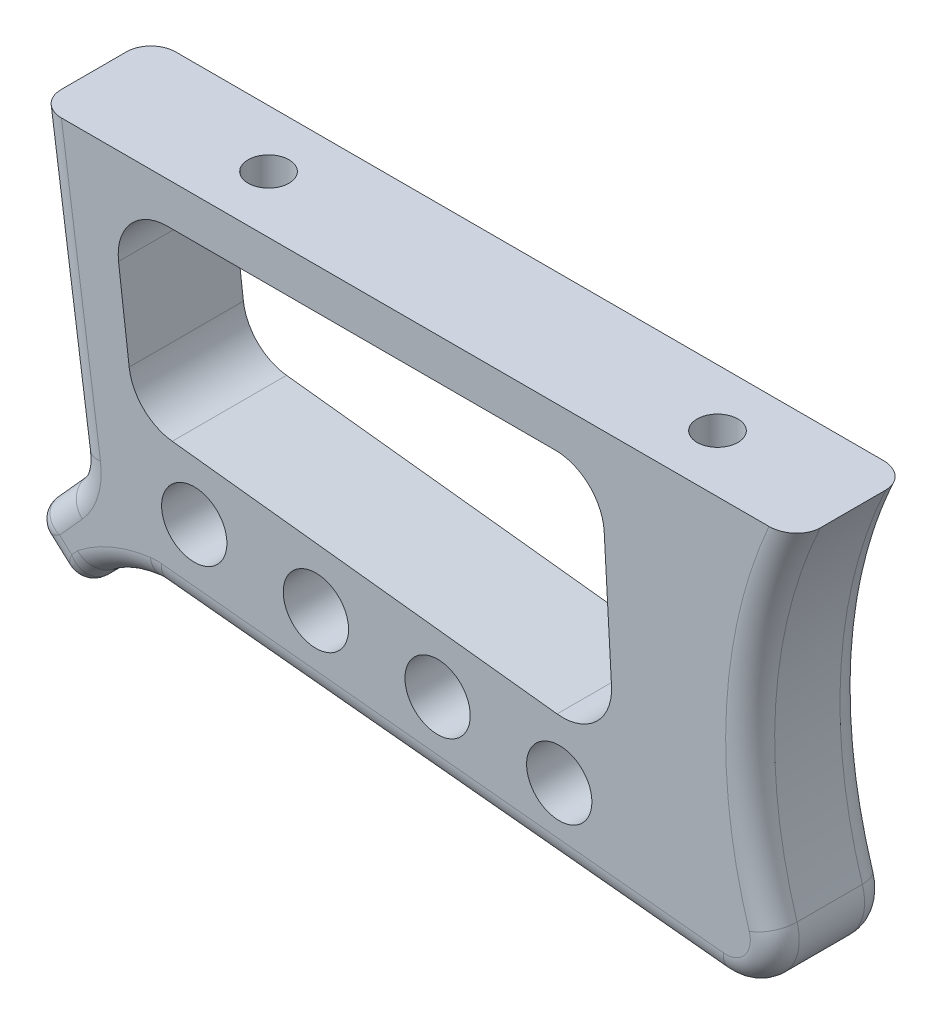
ISO-10303-21;
HEADER;
FILE_DESCRIPTION(('STEP AP214'),'2;1');
FILE_NAME('part.step','',(''),(''),'','','');
FILE_SCHEMA(('AUTOMOTIVE_DESIGN { 1 0 10303 214 1 1 1 1 }'));
ENDSEC;
DATA;
#1=APPLICATION_CONTEXT('core data for automotive mechanical design processes');
#2=APPLICATION_PROTOCOL_DEFINITION('international standard','automotive_design',2000,#1);
#3=PRODUCT_CONTEXT('',#1,'mechanical');
#4=PRODUCT('Part','Part','',(#3));
#5=PRODUCT_RELATED_PRODUCT_CATEGORY('part','',(#4));
#6=PRODUCT_DEFINITION_FORMATION('','',#4);
#7=PRODUCT_DEFINITION_CONTEXT('part definition',#1,'design');
#8=PRODUCT_DEFINITION('design','',#6,#7);
#9=PRODUCT_DEFINITION_SHAPE('','',#8);
#10=(LENGTH_UNIT() NAMED_UNIT(*) SI_UNIT(.MILLI.,.METRE.));
#11=(NAMED_UNIT(*) PLANE_ANGLE_UNIT() SI_UNIT($,.RADIAN.));
#12=(NAMED_UNIT(*) SI_UNIT($,.STERADIAN.) SOLID_ANGLE_UNIT());
#13=UNCERTAINTY_MEASURE_WITH_UNIT(LENGTH_MEASURE(1.E-05),#10,'distance_accuracy_value','');
#14=(GEOMETRIC_REPRESENTATION_CONTEXT(3) GLOBAL_UNCERTAINTY_ASSIGNED_CONTEXT((#13)) GLOBAL_UNIT_ASSIGNED_CONTEXT((#10,
#11,#12)) REPRESENTATION_CONTEXT('',''));
#15=CARTESIAN_POINT('',(0.,0.,0.));
#16=DIRECTION('',(0.,0.,1.));
#17=DIRECTION('',(1.,0.,0.));
#18=AXIS2_PLACEMENT_3D('',#15,#16,#17);
#19=CARTESIAN_POINT('',(-78.3419069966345,-44.1142851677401,7.));
#20=DIRECTION('',(0.0993197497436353,0.995055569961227,0.));
#21=DIRECTION('',(-0.995055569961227,0.0993197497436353,0.));
#22=AXIS2_PLACEMENT_3D('',#19,#20,#21);
#23=PLANE('',#22);
#24=CARTESIAN_POINT('',(-18.6,-50.0773202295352,0.));
#25=DIRECTION('',(0.0993197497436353,0.995055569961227,0.));
#26=DIRECTION('',(0.995055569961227,-0.0993197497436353,0.));
#27=AXIS2_PLACEMENT_3D('',#24,#25,#26);
#28=ELLIPSE('',#27,6.02981399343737,6.);
#29=CARTESIAN_POINT('',(-23.0721359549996,-49.6309417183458,4.));
#30=VERTEX_POINT('',#29);
#31=CARTESIAN_POINT('',(-23.0721359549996,-49.6309417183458,-4.));
#32=VERTEX_POINT('',#31);
#33=EDGE_CURVE('E297',#30,#32,#28,.F.);
#34=ORIENTED_EDGE('',*,*,#33,.F.);
#35=DIRECTION('',(0.995055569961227,-0.0993197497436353,0.));
#36=VECTOR('',#35,1.);
#37=CARTESIAN_POINT('',(-78.3419069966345,-44.1142851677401,4.));
#38=LINE('',#37,#36);
#39=CARTESIAN_POINT('',(-78.0244172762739,-44.1459748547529,4.));
#40=VERTEX_POINT('',#39);
#41=EDGE_CURVE('E592',#30,#40,#38,.F.);
#42=ORIENTED_EDGE('',*,*,#41,.T.);
#43=DIRECTION('',(0.,0.,1.));
#44=VECTOR('',#43,1.);
#45=CARTESIAN_POINT('',(-78.0244172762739,-44.1459748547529,-7.));
#46=LINE('',#45,#44);
#47=CARTESIAN_POINT('',(-78.0244172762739,-44.1459748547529,-4.));
#48=VERTEX_POINT('',#47);
#49=EDGE_CURVE('E606',#40,#48,#46,.F.);
#50=ORIENTED_EDGE('',*,*,#49,.T.);
#51=DIRECTION('',(0.995055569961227,-0.0993197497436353,0.));
#52=VECTOR('',#51,1.);
#53=CARTESIAN_POINT('',(-9.17575123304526,-51.0179853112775,-4.));
#54=LINE('',#53,#52);
#55=EDGE_CURVE('E595',#48,#32,#54,.T.);
#56=ORIENTED_EDGE('',*,*,#55,.T.);
#57=EDGE_LOOP('',(#34,#42,#50,#56));
#58=FACE_BOUND('',#57,.T.);
#59=ADVANCED_FACE('F42',(#58),#23,.F.);
#60=CARTESIAN_POINT('',(-78.0439477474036,-41.1291184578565,-4.));
#61=DIRECTION('',(-0.995055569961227,0.0993197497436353,0.));
#62=DIRECTION('',(-0.0993197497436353,-0.995055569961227,0.));
#63=AXIS2_PLACEMENT_3D('',#60,#61,#62);
#64=CYLINDRICAL_SURFACE('',#63,3.);
#65=CARTESIAN_POINT('',(-14.1278640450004,-50.5236987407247,-4.));
#66=VERTEX_POINT('',#65);
#67=CARTESIAN_POINT('',(-9.17575123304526,-51.0179853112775,-4.));
#68=VERTEX_POINT('',#67);
#69=EDGE_CURVE('E1425',#66,#68,#54,.T.);
#70=ORIENTED_EDGE('',*,*,#69,.F.);
#71=CARTESIAN_POINT('',(-14.1278640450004,-50.5236987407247,-4.));
#72=CARTESIAN_POINT('',(-14.2129942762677,-50.5151799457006,-4.0952009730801));
#73=CARTESIAN_POINT('',(-14.3008892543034,-50.5018772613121,-4.18733333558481));
#74=CARTESIAN_POINT('',(-14.4813760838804,-50.4673650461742,-4.36496129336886));
#75=CARTESIAN_POINT('',(-14.5739585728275,-50.4461707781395,-4.45046931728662));
#76=CARTESIAN_POINT('',(-14.7627823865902,-50.3976293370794,-4.61425117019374));
#77=CARTESIAN_POINT('',(-14.8589999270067,-50.3703178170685,-4.69256335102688));
#78=CARTESIAN_POINT('',(-15.0551801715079,-50.3108689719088,-4.84246828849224));
#79=CARTESIAN_POINT('',(-15.15514518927,-50.2787286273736,-4.91405679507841));
#80=CARTESIAN_POINT('',(-15.401717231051,-50.1964987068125,-5.07951334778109));
#81=CARTESIAN_POINT('',(-15.5500653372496,-50.1445923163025,-5.16989378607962));
#82=CARTESIAN_POINT('',(-15.8529896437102,-50.0371107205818,-5.3370290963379));
#83=CARTESIAN_POINT('',(-16.0075679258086,-49.9815342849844,-5.41377936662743));
#84=CARTESIAN_POINT('',(-16.3231566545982,-49.8698970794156,-5.5539075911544));
#85=CARTESIAN_POINT('',(-16.4841861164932,-49.8138353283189,-5.61724192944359));
#86=CARTESIAN_POINT('',(-16.8120540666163,-49.704914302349,-5.73003348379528));
#87=CARTESIAN_POINT('',(-16.9788902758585,-49.6520537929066,-5.77949607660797));
#88=CARTESIAN_POINT('',(-17.2765145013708,-49.565350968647,-5.8536980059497));
#89=CARTESIAN_POINT('',(-17.4061021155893,-49.5300248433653,-5.88152573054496));
#90=CARTESIAN_POINT('',(-17.6681665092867,-49.4649016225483,-5.92869298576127));
#91=CARTESIAN_POINT('',(-17.8006423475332,-49.4351027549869,-5.9480352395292));
#92=CARTESIAN_POINT('',(-18.0674066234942,-49.3825832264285,-5.97781512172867));
#93=CARTESIAN_POINT('',(-18.2016849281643,-49.3598329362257,-5.98829035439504));
#94=CARTESIAN_POINT('',(-18.4717545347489,-49.3222717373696,-6.00015132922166));
#95=CARTESIAN_POINT('',(-18.607545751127,-49.3074603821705,-6.00153758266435));
#96=CARTESIAN_POINT('',(-18.8799830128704,-49.2861192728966,-5.99501723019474));
#97=CARTESIAN_POINT('',(-19.0166304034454,-49.2796154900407,-5.98708162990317));
#98=CARTESIAN_POINT('',(-19.2891996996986,-49.2745678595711,-5.96185722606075));
#99=CARTESIAN_POINT('',(-19.4251215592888,-49.2760245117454,-5.94456783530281));
#100=CARTESIAN_POINT('',(-19.6957379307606,-49.2858203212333,-5.9006970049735));
#101=CARTESIAN_POINT('',(-19.8304254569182,-49.2941866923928,-5.87407906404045));
#102=CARTESIAN_POINT('',(-20.0972893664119,-49.3162831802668,-5.81179154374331));
#103=CARTESIAN_POINT('',(-20.2294642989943,-49.3300163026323,-5.77611689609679));
#104=CARTESIAN_POINT('',(-20.521920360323,-49.3648144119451,-5.68637530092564));
#105=CARTESIAN_POINT('',(-20.6813677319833,-49.3868472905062,-5.62995032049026));
#106=CARTESIAN_POINT('',(-20.9946154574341,-49.4330992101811,-5.50403254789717));
#107=CARTESIAN_POINT('',(-21.148414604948,-49.4573187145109,-5.43453698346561));
#108=CARTESIAN_POINT('',(-21.5995027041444,-49.5282706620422,-5.20728800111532));
#109=CARTESIAN_POINT('',(-21.8878429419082,-49.5735114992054,-5.03035319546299));
#110=CARTESIAN_POINT('',(-22.325075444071,-49.6230964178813,-4.70806103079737));
#111=CARTESIAN_POINT('',(-22.4841376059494,-49.6365315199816,-4.57774332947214));
#112=CARTESIAN_POINT('',(-22.7125764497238,-49.6446358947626,-4.37005249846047));
#113=CARTESIAN_POINT('',(-22.7871670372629,-49.6453187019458,-4.29863386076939));
#114=CARTESIAN_POINT('',(-22.9325809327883,-49.6419040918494,-4.15204034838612));
#115=CARTESIAN_POINT('',(-23.0034005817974,-49.6378021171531,-4.07686195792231));
#116=CARTESIAN_POINT('',(-23.0721359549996,-49.6309417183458,-4.));
#117=B_SPLINE_CURVE_WITH_KNOTS('',3,(#71,#72,#73,#74,#75,#76,#77,#78,#79,#80,#81,#82,#83,#84,
#85,#86,#87,#88,#89,#90,#91,#92,#93,#94,#95,#96,#97,#98,#99,#100,#101,#102,#103,#104,#105,#106,
#107,#108,#109,#110,#111,#112,#113,#114,#115,#116),.UNSPECIFIED.,.F.,.F.,(4,2,2,2,2,2,2,2,2,2,2,
2,2,2,2,2,2,2,2,2,2,2,4),(0.,0.383652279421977,0.766566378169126,1.14730428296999,
1.52828125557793,2.0714273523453,2.6147564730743,3.1598257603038,3.70468348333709,
4.11583836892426,4.52686121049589,4.93613208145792,5.3453799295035,5.75590406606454,
6.16645397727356,6.57862858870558,6.99103437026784,7.50201893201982,8.0131119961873,
9.03102718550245,9.64774677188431,9.95732734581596,10.2672030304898),.UNSPECIFIED.);
#118=EDGE_CURVE('E298',#66,#32,#117,.T.);
#119=ORIENTED_EDGE('',*,*,#118,.T.);
#120=ORIENTED_EDGE('',*,*,#55,.F.);
#121=CARTESIAN_POINT('',(-77.726458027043,-41.1608081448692,-4.));
#122=DIRECTION('',(-0.995055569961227,0.0993197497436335,0.));
#123=DIRECTION('',(-0.0993197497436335,-0.995055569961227,0.));
#124=AXIS2_PLACEMENT_3D('',#121,#122,#123);
#125=CIRCLE('',#124,3.);
#126=CARTESIAN_POINT('',(-77.726458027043,-41.1608081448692,-7.));
#127=VERTEX_POINT('',#126);
#128=EDGE_CURVE('E635',#127,#48,#125,.T.);
#129=ORIENTED_EDGE('',*,*,#128,.F.);
#130=DIRECTION('',(0.995055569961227,-0.0993197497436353,0.));
#131=VECTOR('',#130,1.);
#132=CARTESIAN_POINT('',(-78.0439477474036,-41.1291184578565,-7.));
#133=LINE('',#132,#131);
#134=CARTESIAN_POINT('',(-8.87779198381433,-48.0328186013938,-7.));
#135=VERTEX_POINT('',#134);
#136=EDGE_CURVE('E765',#135,#127,#133,.F.);
#137=ORIENTED_EDGE('',*,*,#136,.F.);
#138=CARTESIAN_POINT('',(-8.87779198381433,-48.0328186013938,-4.));
#139=DIRECTION('',(-0.995055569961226,0.0993197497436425,0.));
#140=DIRECTION('',(-0.0993197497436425,-0.995055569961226,0.));
#141=AXIS2_PLACEMENT_3D('',#138,#139,#140);
#142=CIRCLE('',#141,3.);
#143=EDGE_CURVE('E643',#135,#68,#142,.T.);
#144=ORIENTED_EDGE('',*,*,#143,.T.);
#145=EDGE_LOOP('',(#70,#119,#120,#129,#137,#144));
#146=FACE_BOUND('',#145,.T.);
#147=ADVANCED_FACE('F309',(#146),#64,.T.);
#148=CARTESIAN_POINT('',(51.530221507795,-54.0623399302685,4.));
#149=DIRECTION('',(0.995055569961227,-0.0993197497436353,0.));
#150=DIRECTION('',(0.0993197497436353,0.995055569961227,0.));
#151=AXIS2_PLACEMENT_3D('',#148,#149,#150);
#152=CYLINDRICAL_SURFACE('',#151,3.);
#153=ORIENTED_EDGE('',*,*,#41,.F.);
#154=CARTESIAN_POINT('',(-23.0721359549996,-49.6309417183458,4.));
#155=CARTESIAN_POINT('',(-22.9872617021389,-49.6394105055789,4.0949248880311));
#156=CARTESIAN_POINT('',(-22.8992068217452,-49.6436774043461,4.18726193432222));
#157=CARTESIAN_POINT('',(-22.7174939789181,-49.6451702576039,4.3660501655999));
#158=CARTESIAN_POINT('',(-22.6238444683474,-49.6424065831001,4.45250982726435));
#159=CARTESIAN_POINT('',(-22.4317985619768,-49.6312385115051,4.61881160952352));
#160=CARTESIAN_POINT('',(-22.3334207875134,-49.6228547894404,4.69867678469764));
#161=CARTESIAN_POINT('',(-22.1320754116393,-49.6017741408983,4.85185016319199));
#162=CARTESIAN_POINT('',(-22.029105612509,-49.5890751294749,4.92515517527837));
#163=CARTESIAN_POINT('',(-21.7834552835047,-49.5558325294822,5.0886285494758));
#164=CARTESIAN_POINT('',(-21.6391366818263,-49.5340887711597,5.176099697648));
#165=CARTESIAN_POINT('',(-21.3439311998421,-49.4882357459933,5.33846762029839));
#166=CARTESIAN_POINT('',(-21.1930425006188,-49.464125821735,5.41336088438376));
#167=CARTESIAN_POINT('',(-20.8851882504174,-49.4166494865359,5.55034582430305));
#168=CARTESIAN_POINT('',(-20.7282145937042,-49.3932841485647,5.61241967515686));
#169=CARTESIAN_POINT('',(-20.4091076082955,-49.3506393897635,5.72325383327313));
#170=CARTESIAN_POINT('',(-20.2469759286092,-49.3313586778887,5.77201834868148));
#171=CARTESIAN_POINT('',(-19.9540513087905,-49.3036056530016,5.84672428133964));
#172=CARTESIAN_POINT('',(-19.8240704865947,-49.2936972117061,5.87532108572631));
#173=CARTESIAN_POINT('',(-19.5621792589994,-49.2799456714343,5.92384464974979));
#174=CARTESIAN_POINT('',(-19.4302691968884,-49.2761015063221,5.94377293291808));
#175=CARTESIAN_POINT('',(-19.1658194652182,-49.2756600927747,5.97473941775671));
#176=CARTESIAN_POINT('',(-19.0332832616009,-49.2790392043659,5.985806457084));
#177=CARTESIAN_POINT('',(-18.7681930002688,-49.2936220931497,5.99911015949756));
#178=CARTESIAN_POINT('',(-18.6356389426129,-49.3048258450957,6.00134685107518));
#179=CARTESIAN_POINT('',(-18.3717432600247,-49.3349735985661,5.99710714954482));
#180=CARTESIAN_POINT('',(-18.2404002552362,-49.3539072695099,5.99064235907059));
#181=CARTESIAN_POINT('',(-17.9796274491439,-49.3987970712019,5.96927629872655));
#182=CARTESIAN_POINT('',(-17.8501977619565,-49.424753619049,5.95437452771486));
#183=CARTESIAN_POINT('',(-17.5933277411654,-49.4826314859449,5.9163793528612));
#184=CARTESIAN_POINT('',(-17.4658982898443,-49.5145778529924,5.89325116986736));
#185=CARTESIAN_POINT('',(-17.2139304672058,-49.5829401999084,5.83912867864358));
#186=CARTESIAN_POINT('',(-17.0893929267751,-49.6193574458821,5.8081321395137));
#187=CARTESIAN_POINT('',(-16.7970486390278,-49.7094586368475,5.72541267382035));
#188=CARTESIAN_POINT('',(-16.630613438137,-49.7644794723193,5.67028055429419));
#189=CARTESIAN_POINT('',(-16.3036964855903,-49.8764480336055,5.54595268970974));
#190=CARTESIAN_POINT('',(-16.14321743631,-49.9333966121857,5.47675065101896));
#191=CARTESIAN_POINT('',(-15.8290531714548,-50.0454373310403,5.32467730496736));
#192=CARTESIAN_POINT('',(-15.6753435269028,-50.1005359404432,5.24186132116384));
#193=CARTESIAN_POINT('',(-15.3744942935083,-50.2056224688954,5.06228858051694));
#194=CARTESIAN_POINT('',(-15.227351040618,-50.255613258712,4.96553972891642));
#195=CARTESIAN_POINT('',(-14.9984205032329,-50.3283627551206,4.7999740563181));
#196=CARTESIAN_POINT('',(-14.9142523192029,-50.3539622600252,4.73567001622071));
#197=CARTESIAN_POINT('',(-14.7488065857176,-50.4011706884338,4.60213052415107));
#198=CARTESIAN_POINT('',(-14.6675276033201,-50.4227816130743,4.53289756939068));
#199=CARTESIAN_POINT('',(-14.5077295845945,-50.4612045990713,4.38918195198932));
#200=CARTESIAN_POINT('',(-14.4292271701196,-50.4779910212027,4.31467377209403));
#201=CARTESIAN_POINT('',(-14.2757543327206,-50.5055972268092,4.16085929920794));
#202=CARTESIAN_POINT('',(-14.2007889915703,-50.5164086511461,4.08154645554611));
#203=CARTESIAN_POINT('',(-14.1278640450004,-50.5236987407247,4.));
#204=B_SPLINE_CURVE_WITH_KNOTS('',3,(#154,#155,#156,#157,#158,#159,#160,#161,#162,#163,#164,
#165,#166,#167,#168,#169,#170,#171,#172,#173,#174,#175,#176,#177,#178,#179,#180,#181,#182,#183,
#184,#185,#186,#187,#188,#189,#190,#191,#192,#193,#194,#195,#196,#197,#198,#199,#200,#201,#202,
#203),.UNSPECIFIED.,.F.,.F.,(4,2,2,2,2,2,2,2,2,2,2,2,2,2,2,2,2,2,2,2,2,2,2,2,4),(0.,
0.382589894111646,0.76461574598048,1.14524385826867,1.52605613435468,2.03584312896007,
2.54577216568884,3.05640553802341,3.56687727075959,3.96686500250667,4.36678240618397,
4.76539298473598,5.16400227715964,5.56208058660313,5.9601825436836,6.3599879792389,
6.7599068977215,7.31046593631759,7.86127179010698,8.40989226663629,8.95820268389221,
9.28492629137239,9.61148552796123,9.93974942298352,10.2684714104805),.UNSPECIFIED.);
#205=CARTESIAN_POINT('',(-14.1278640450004,-50.5236987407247,4.));
#206=VERTEX_POINT('',#205);
#207=EDGE_CURVE('E11',#30,#206,#204,.T.);
#208=ORIENTED_EDGE('',*,*,#207,.T.);
#209=CARTESIAN_POINT('',(-9.17575123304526,-51.0179853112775,4.));
#210=VERTEX_POINT('',#209);
#211=EDGE_CURVE('E605',#210,#206,#38,.F.);
#212=ORIENTED_EDGE('',*,*,#211,.F.);
#213=CARTESIAN_POINT('',(-8.87779198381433,-48.0328186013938,4.));
#214=DIRECTION('',(-0.995055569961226,0.0993197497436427,0.));
#215=DIRECTION('',(-0.0993197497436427,-0.995055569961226,0.));
#216=AXIS2_PLACEMENT_3D('',#213,#214,#215);
#217=CIRCLE('',#216,3.);
#218=CARTESIAN_POINT('',(-8.87779198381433,-48.0328186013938,7.));
#219=VERTEX_POINT('',#218);
#220=EDGE_CURVE('E627',#210,#219,#217,.T.);
#221=ORIENTED_EDGE('',*,*,#220,.T.);
#222=DIRECTION('',(0.995055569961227,-0.0993197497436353,0.));
#223=VECTOR('',#222,1.);
#224=CARTESIAN_POINT('',(51.530221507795,-54.0623399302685,7.));
#225=LINE('',#224,#223);
#226=CARTESIAN_POINT('',(-77.726458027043,-41.1608081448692,7.));
#227=VERTEX_POINT('',#226);
#228=EDGE_CURVE('E734',#227,#219,#225,.T.);
#229=ORIENTED_EDGE('',*,*,#228,.F.);
#230=CARTESIAN_POINT('',(-77.726458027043,-41.1608081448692,4.));
#231=DIRECTION('',(-0.995055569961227,0.0993197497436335,0.));
#232=DIRECTION('',(-0.0993197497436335,-0.995055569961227,0.));
#233=AXIS2_PLACEMENT_3D('',#230,#231,#232);
#234=CIRCLE('',#233,3.);
#235=EDGE_CURVE('E602',#40,#227,#234,.T.);
#236=ORIENTED_EDGE('',*,*,#235,.F.);
#237=EDGE_LOOP('',(#153,#208,#212,#221,#229,#236));
#238=FACE_BOUND('',#237,.T.);
#239=ADVANCED_FACE('F386',(#238),#152,.T.);
#240=CARTESIAN_POINT('',(54.4,-25.3108672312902,7.));
#241=DIRECTION('',(0.,0.,-1.));
#242=DIRECTION('',(-1.,0.,0.));
#243=AXIS2_PLACEMENT_3D('',#240,#241,#242);
#244=PLANE('',#243);
#245=DIRECTION('',(0.669130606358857,0.743144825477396,0.));
#246=VECTOR('',#245,1.);
#247=CARTESIAN_POINT('',(-14.4887190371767,36.716813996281,7.));
#248=LINE('',#247,#246);
#249=CARTESIAN_POINT('',(-88.7117549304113,-45.7162185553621,7.));
#250=VERTEX_POINT('',#249);
#251=CARTESIAN_POINT('',(-87.9989982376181,-44.9246220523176,7.));
#252=VERTEX_POINT('',#251);
#253=EDGE_CURVE('E1227',#250,#252,#248,.T.);
#254=ORIENTED_EDGE('',*,*,#253,.T.);
#255=CARTESIAN_POINT('',(-76.8264577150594,-59.0375359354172,7.));
#256=DIRECTION('',(0.,0.,-1.));
#257=DIRECTION('',(-1.,0.,0.));
#258=AXIS2_PLACEMENT_3D('',#255,#256,#257);
#259=CIRCLE('',#258,18.);
#260=CARTESIAN_POINT('',(-79.0703359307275,-41.1779443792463,7.));
#261=VERTEX_POINT('',#260);
#262=EDGE_CURVE('E747',#252,#261,#259,.T.);
#263=ORIENTED_EDGE('',*,*,#262,.T.);
#264=CARTESIAN_POINT('',(-78.3223765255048,-47.1311415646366,7.));
#265=DIRECTION('',(0.,0.,-1.));
#266=DIRECTION('',(-1.,0.,0.));
#267=AXIS2_PLACEMENT_3D('',#264,#265,#266);
#268=CIRCLE('',#267,6.);
#269=EDGE_CURVE('E743',#227,#261,#268,.F.);
#270=ORIENTED_EDGE('',*,*,#269,.F.);
#271=ORIENTED_EDGE('',*,*,#228,.T.);
#272=CARTESIAN_POINT('',(-8.5798327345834,-45.0476518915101,7.));
#273=DIRECTION('',(0.,0.,-1.));
#274=DIRECTION('',(-1.,0.,0.));
#275=AXIS2_PLACEMENT_3D('',#272,#273,#274);
#276=CIRCLE('',#275,2.99999999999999);
#277=CARTESIAN_POINT('',(-5.71711306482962,-44.1505253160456,7.));
#278=VERTEX_POINT('',#277);
#279=EDGE_CURVE('E737',#219,#278,#276,.F.);
#280=ORIENTED_EDGE('',*,*,#279,.T.);
#281=CARTESIAN_POINT('',(54.4,-25.3108672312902,7.));
#282=DIRECTION('',(0.,0.,-1.));
#283=DIRECTION('',(-1.,0.,0.));
#284=AXIS2_PLACEMENT_3D('',#281,#282,#283);
#285=CIRCLE('',#284,63.);
#286=CARTESIAN_POINT('',(-3.29194051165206,0.,7.));
#287=VERTEX_POINT('',#286);
#288=EDGE_CURVE('E740',#278,#287,#285,.T.);
#289=ORIENTED_EDGE('',*,*,#288,.T.);
#290=DIRECTION('',(-1.,0.,0.));
#291=VECTOR('',#290,1.);
#292=CARTESIAN_POINT('',(0.,0.,7.));
#293=LINE('',#292,#291);
#294=CARTESIAN_POINT('',(-89.9705172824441,0.,7.));
#295=VERTEX_POINT('',#294);
#296=EDGE_CURVE('E785',#287,#295,#293,.T.);
#297=ORIENTED_EDGE('',*,*,#296,.T.);
#298=DIRECTION('',(0.13917310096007,-0.99026806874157,0.));
#299=VECTOR('',#298,1.);
#300=CARTESIAN_POINT('',(-83.6858725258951,-44.7175710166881,7.));
#301=LINE('',#300,#299);
#302=CARTESIAN_POINT('',(-85.1904616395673,-34.0118631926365,7.));
#303=VERTEX_POINT('',#302);
#304=EDGE_CURVE('E489',#295,#303,#301,.T.);
#305=ORIENTED_EDGE('',*,*,#304,.T.);
#306=CARTESIAN_POINT('',(-94.1028742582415,-35.2644211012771,7.));
#307=DIRECTION('',(0.,0.,-1.));
#308=DIRECTION('',(-1.,0.,0.));
#309=AXIS2_PLACEMENT_3D('',#306,#307,#308);
#310=CIRCLE('',#309,9.);
#311=CARTESIAN_POINT('',(-87.4145708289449,-41.2865965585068,7.));
#312=VERTEX_POINT('',#311);
#313=EDGE_CURVE('E1217',#303,#312,#310,.T.);
#314=ORIENTED_EDGE('',*,*,#313,.T.);
#315=DIRECTION('',(-0.669130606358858,-0.743144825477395,0.));
#316=VECTOR('',#315,1.);
#317=CARTESIAN_POINT('',(-15.9750086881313,38.0550752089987,7.));
#318=LINE('',#317,#316);
#319=CARTESIAN_POINT('',(-90.1980445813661,-44.3779573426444,7.));
#320=VERTEX_POINT('',#319);
#321=EDGE_CURVE('E1220',#312,#320,#318,.T.);
#322=ORIENTED_EDGE('',*,*,#321,.T.);
#323=DIRECTION('',(0.743144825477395,-0.669130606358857,0.));
#324=VECTOR('',#323,1.);
#325=CARTESIAN_POINT('',(-19.8230358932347,-107.743899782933,7.));
#326=LINE('',#325,#324);
#327=EDGE_CURVE('E1185',#320,#250,#326,.T.);
#328=ORIENTED_EDGE('',*,*,#327,.T.);
#329=EDGE_LOOP('',(#254,#263,#270,#271,#280,#289,#297,#305,#314,#322,#328));
#330=FACE_BOUND('',#329,.T.);
#331=CARTESIAN_POINT('',(-28.5742534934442,-26.9109509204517,7.));
#332=DIRECTION('',(0.,0.,1.));
#333=DIRECTION('',(-1.,0.,0.));
#334=AXIS2_PLACEMENT_3D('',#331,#332,#333);
#335=CIRCLE('',#334,6.00000000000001);
#336=CARTESIAN_POINT('',(-29.2506895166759,-32.8726985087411,7.));
#337=VERTEX_POINT('',#336);
#338=CARTESIAN_POINT('',(-22.5837659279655,-26.5732251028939,7.));
#339=VERTEX_POINT('',#338);
#340=EDGE_CURVE('E1317',#337,#339,#335,.T.);
#341=ORIENTED_EDGE('',*,*,#340,.F.);
#342=DIRECTION('',(0.993624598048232,-0.112739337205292,0.));
#343=VECTOR('',#342,1.);
#344=CARTESIAN_POINT('',(-29.2506895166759,-32.8726985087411,7.));
#345=LINE('',#344,#343);
#346=CARTESIAN_POINT('',(-76.3978801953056,-27.523250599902,7.));
#347=VERTEX_POINT('',#346);
#348=EDGE_CURVE('E1339',#347,#337,#345,.T.);
#349=ORIENTED_EDGE('',*,*,#348,.F.);
#350=CARTESIAN_POINT('',(-75.7214441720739,-21.5615030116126,7.));
#351=DIRECTION('',(0.,0.,1.));
#352=DIRECTION('',(-1.,0.,0.));
#353=AXIS2_PLACEMENT_3D('',#350,#351,#352);
#354=CIRCLE('',#353,6.00000000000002);
#355=CARTESIAN_POINT('',(-81.6767210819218,-22.2927190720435,7.));
#356=VERTEX_POINT('',#355);
#357=EDGE_CURVE('E1335',#356,#347,#354,.T.);
#358=ORIENTED_EDGE('',*,*,#357,.F.);
#359=DIRECTION('',(0.121869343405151,-0.992546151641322,0.));
#360=VECTOR('',#359,1.);
#361=CARTESIAN_POINT('',(-81.6767210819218,-22.2927190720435,7.));
#362=LINE('',#361,#360);
#363=CARTESIAN_POINT('',(-82.9735105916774,-11.7312160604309,7.));
#364=VERTEX_POINT('',#363);
#365=EDGE_CURVE('E1332',#364,#356,#362,.T.);
#366=ORIENTED_EDGE('',*,*,#365,.F.);
#367=CARTESIAN_POINT('',(-77.0182336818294,-11.,7.));
#368=DIRECTION('',(0.,0.,1.));
#369=DIRECTION('',(1.,0.,0.));
#370=AXIS2_PLACEMENT_3D('',#367,#368,#369);
#371=CIRCLE('',#370,6.00000000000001);
#372=CARTESIAN_POINT('',(-77.0182336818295,-5.00000000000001,7.));
#373=VERTEX_POINT('',#372);
#374=EDGE_CURVE('E1329',#373,#364,#371,.T.);
#375=ORIENTED_EDGE('',*,*,#374,.F.);
#376=DIRECTION('',(-1.,0.,0.));
#377=VECTOR('',#376,1.);
#378=CARTESIAN_POINT('',(-77.0182336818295,-5.00000000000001,7.));
#379=LINE('',#378,#377);
#380=CARTESIAN_POINT('',(-29.4712654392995,-5.,7.));
#381=VERTEX_POINT('',#380);
#382=EDGE_CURVE('E1326',#381,#373,#379,.T.);
#383=ORIENTED_EDGE('',*,*,#382,.F.);
#384=CARTESIAN_POINT('',(-29.4712654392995,-11.,7.));
#385=DIRECTION('',(0.,0.,1.));
#386=DIRECTION('',(-1.,0.,0.));
#387=AXIS2_PLACEMENT_3D('',#384,#385,#386);
#388=CIRCLE('',#387,6.00000000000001);
#389=CARTESIAN_POINT('',(-23.4807778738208,-10.6622741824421,7.));
#390=VERTEX_POINT('',#389);
#391=EDGE_CURVE('E1323',#390,#381,#388,.T.);
#392=ORIENTED_EDGE('',*,*,#391,.F.);
#393=DIRECTION('',(-0.05628763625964,0.99841459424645,0.));
#394=VECTOR('',#393,1.);
#395=CARTESIAN_POINT('',(-23.4807778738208,-10.6622741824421,7.));
#396=LINE('',#395,#394);
#397=EDGE_CURVE('E1320',#339,#390,#396,.T.);
#398=ORIENTED_EDGE('',*,*,#397,.F.);
#399=EDGE_LOOP('',(#341,#349,#358,#366,#375,#383,#392,#398));
#400=FACE_BOUND('',#399,.T.);
#401=CARTESIAN_POINT('',(-73.7,-35.,7.));
#402=DIRECTION('',(0.,0.,1.));
#403=DIRECTION('',(1.,0.,0.));
#404=AXIS2_PLACEMENT_3D('',#401,#402,#403);
#405=CIRCLE('',#404,4.00000000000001);
#406=CARTESIAN_POINT('',(-69.7,-35.,7.));
#407=VERTEX_POINT('',#406);
#408=EDGE_CURVE('E1281',#407,#407,#405,.T.);
#409=ORIENTED_EDGE('',*,*,#408,.F.);
#410=EDGE_LOOP('',(#409));
#411=FACE_BOUND('',#410,.T.);
#412=CARTESIAN_POINT('',(-58.7956310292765,-36.6910900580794,7.));
#413=DIRECTION('',(0.,0.,1.));
#414=DIRECTION('',(1.,0.,0.));
#415=AXIS2_PLACEMENT_3D('',#412,#413,#414);
#416=CIRCLE('',#415,4.00000000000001);
#417=CARTESIAN_POINT('',(-54.7956310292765,-36.6910900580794,7.));
#418=VERTEX_POINT('',#417);
#419=EDGE_CURVE('E1273',#418,#418,#416,.T.);
#420=ORIENTED_EDGE('',*,*,#419,.F.);
#421=EDGE_LOOP('',(#420));
#422=FACE_BOUND('',#421,.T.);
#423=CARTESIAN_POINT('',(-43.891262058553,-38.3821801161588,7.));
#424=DIRECTION('',(0.,0.,1.));
#425=DIRECTION('',(1.,0.,0.));
#426=AXIS2_PLACEMENT_3D('',#423,#424,#425);
#427=CIRCLE('',#426,4.00000000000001);
#428=CARTESIAN_POINT('',(-39.891262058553,-38.3821801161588,7.));
#429=VERTEX_POINT('',#428);
#430=EDGE_CURVE('E1265',#429,#429,#427,.T.);
#431=ORIENTED_EDGE('',*,*,#430,.F.);
#432=EDGE_LOOP('',(#431));
#433=FACE_BOUND('',#432,.T.);
#434=CARTESIAN_POINT('',(-28.9868930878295,-40.0732701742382,7.));
#435=DIRECTION('',(0.,0.,1.));
#436=DIRECTION('',(1.,0.,0.));
#437=AXIS2_PLACEMENT_3D('',#434,#435,#436);
#438=CIRCLE('',#437,4.);
#439=CARTESIAN_POINT('',(-24.9868930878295,-40.0732701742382,7.));
#440=VERTEX_POINT('',#439);
#441=EDGE_CURVE('E1257',#440,#440,#438,.T.);
#442=ORIENTED_EDGE('',*,*,#441,.F.);
#443=EDGE_LOOP('',(#442));
#444=FACE_BOUND('',#443,.T.);
#445=ADVANCED_FACE('F382',(#330,#400,#411,#422,#433,#444),#244,.F.);
#446=CARTESIAN_POINT('',(54.4,-25.3108672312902,-7.));
#447=DIRECTION('',(0.,0.,-1.));
#448=DIRECTION('',(-1.,0.,0.));
#449=AXIS2_PLACEMENT_3D('',#446,#447,#448);
#450=PLANE('',#449);
#451=CARTESIAN_POINT('',(-43.891262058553,-38.3821801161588,-7.));
#452=DIRECTION('',(0.,0.,1.));
#453=DIRECTION('',(1.,0.,0.));
#454=AXIS2_PLACEMENT_3D('',#451,#452,#453);
#455=CIRCLE('',#454,4.00000000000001);
#456=CARTESIAN_POINT('',(-39.891262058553,-38.3821801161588,-7.));
#457=VERTEX_POINT('',#456);
#458=EDGE_CURVE('E1261',#457,#457,#455,.T.);
#459=ORIENTED_EDGE('',*,*,#458,.T.);
#460=EDGE_LOOP('',(#459));
#461=FACE_BOUND('',#460,.T.);
#462=CARTESIAN_POINT('',(-73.7,-35.,-7.));
#463=DIRECTION('',(0.,0.,1.));
#464=DIRECTION('',(1.,0.,0.));
#465=AXIS2_PLACEMENT_3D('',#462,#463,#464);
#466=CIRCLE('',#465,4.00000000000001);
#467=CARTESIAN_POINT('',(-69.7,-35.,-7.));
#468=VERTEX_POINT('',#467);
#469=EDGE_CURVE('E1277',#468,#468,#466,.T.);
#470=ORIENTED_EDGE('',*,*,#469,.T.);
#471=EDGE_LOOP('',(#470));
#472=FACE_BOUND('',#471,.T.);
#473=CARTESIAN_POINT('',(-76.8264577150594,-59.0375359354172,-7.));
#474=DIRECTION('',(0.,0.,-1.));
#475=DIRECTION('',(-1.,0.,0.));
#476=AXIS2_PLACEMENT_3D('',#473,#474,#475);
#477=CIRCLE('',#476,18.);
#478=CARTESIAN_POINT('',(-79.0703359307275,-41.1779443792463,-7.));
#479=VERTEX_POINT('',#478);
#480=CARTESIAN_POINT('',(-87.998998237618,-44.9246220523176,-7.));
#481=VERTEX_POINT('',#480);
#482=EDGE_CURVE('E773',#479,#481,#477,.F.);
#483=ORIENTED_EDGE('',*,*,#482,.T.);
#484=DIRECTION('',(0.669130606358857,0.743144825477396,0.));
#485=VECTOR('',#484,1.);
#486=CARTESIAN_POINT('',(-89.3808855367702,-46.4593633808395,-7.));
#487=LINE('',#486,#485);
#488=CARTESIAN_POINT('',(-88.7117549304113,-45.7162185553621,-7.));
#489=VERTEX_POINT('',#488);
#490=EDGE_CURVE('E667',#481,#489,#487,.F.);
#491=ORIENTED_EDGE('',*,*,#490,.T.);
#492=DIRECTION('',(0.743144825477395,-0.669130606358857,0.));
#493=VECTOR('',#492,1.);
#494=CARTESIAN_POINT('',(-90.9411894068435,-43.7088267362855,-7.));
#495=LINE('',#494,#493);
#496=CARTESIAN_POINT('',(-90.1980445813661,-44.3779573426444,-7.));
#497=VERTEX_POINT('',#496);
#498=EDGE_CURVE('E664',#489,#497,#495,.F.);
#499=ORIENTED_EDGE('',*,*,#498,.T.);
#500=DIRECTION('',(-0.669130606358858,-0.743144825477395,0.));
#501=VECTOR('',#500,1.);
#502=CARTESIAN_POINT('',(-87.4145708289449,-41.2865965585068,-7.));
#503=LINE('',#502,#501);
#504=CARTESIAN_POINT('',(-87.4145708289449,-41.2865965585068,-7.));
#505=VERTEX_POINT('',#504);
#506=EDGE_CURVE('E661',#497,#505,#503,.F.);
#507=ORIENTED_EDGE('',*,*,#506,.T.);
#508=CARTESIAN_POINT('',(-94.1028742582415,-35.2644211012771,-7.));
#509=DIRECTION('',(0.,0.,-1.));
#510=DIRECTION('',(-1.,0.,0.));
#511=AXIS2_PLACEMENT_3D('',#508,#509,#510);
#512=CIRCLE('',#511,9.);
#513=CARTESIAN_POINT('',(-85.1904616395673,-34.0118631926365,-7.));
#514=VERTEX_POINT('',#513);
#515=EDGE_CURVE('E658',#505,#514,#512,.F.);
#516=ORIENTED_EDGE('',*,*,#515,.T.);
#517=DIRECTION('',(0.13917310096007,-0.99026806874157,0.));
#518=VECTOR('',#517,1.);
#519=CARTESIAN_POINT('',(-90.0291957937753,0.417519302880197,-7.));
#520=LINE('',#519,#518);
#521=CARTESIAN_POINT('',(-89.9705172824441,0.,-7.));
#522=VERTEX_POINT('',#521);
#523=EDGE_CURVE('E655',#514,#522,#520,.F.);
#524=ORIENTED_EDGE('',*,*,#523,.T.);
#525=DIRECTION('',(-1.,0.,0.));
#526=VECTOR('',#525,1.);
#527=CARTESIAN_POINT('',(0.,0.,-7.));
#528=LINE('',#527,#526);
#529=CARTESIAN_POINT('',(-3.29194051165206,0.,-7.));
#530=VERTEX_POINT('',#529);
#531=EDGE_CURVE('E702',#530,#522,#528,.T.);
#532=ORIENTED_EDGE('',*,*,#531,.F.);
#533=CARTESIAN_POINT('',(54.4,-25.3108672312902,-7.));
#534=DIRECTION('',(0.,0.,-1.));
#535=DIRECTION('',(-1.,0.,0.));
#536=AXIS2_PLACEMENT_3D('',#533,#534,#535);
#537=CIRCLE('',#536,63.);
#538=CARTESIAN_POINT('',(-5.71711306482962,-44.1505253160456,-7.));
#539=VERTEX_POINT('',#538);
#540=EDGE_CURVE('E771',#530,#539,#537,.F.);
#541=ORIENTED_EDGE('',*,*,#540,.T.);
#542=CARTESIAN_POINT('',(-8.5798327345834,-45.0476518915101,-7.));
#543=DIRECTION('',(0.,0.,-1.));
#544=DIRECTION('',(-1.,0.,0.));
#545=AXIS2_PLACEMENT_3D('',#542,#543,#544);
#546=CIRCLE('',#545,2.99999999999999);
#547=EDGE_CURVE('E768',#539,#135,#546,.T.);
#548=ORIENTED_EDGE('',*,*,#547,.T.);
#549=ORIENTED_EDGE('',*,*,#136,.T.);
#550=CARTESIAN_POINT('',(-78.3223765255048,-47.1311415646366,-7.));
#551=DIRECTION('',(0.,0.,-1.));
#552=DIRECTION('',(-1.,0.,0.));
#553=AXIS2_PLACEMENT_3D('',#550,#551,#552);
#554=CIRCLE('',#553,6.);
#555=EDGE_CURVE('E761',#479,#127,#554,.T.);
#556=ORIENTED_EDGE('',*,*,#555,.F.);
#557=EDGE_LOOP('',(#483,#491,#499,#507,#516,#524,#532,#541,#548,#549,#556));
#558=FACE_BOUND('',#557,.T.);
#559=DIRECTION('',(0.993624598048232,-0.112739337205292,0.));
#560=VECTOR('',#559,1.);
#561=CARTESIAN_POINT('',(-29.2506895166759,-32.8726985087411,-7.));
#562=LINE('',#561,#560);
#563=CARTESIAN_POINT('',(-76.3978801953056,-27.523250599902,-7.));
#564=VERTEX_POINT('',#563);
#565=CARTESIAN_POINT('',(-29.2506895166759,-32.8726985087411,-7.));
#566=VERTEX_POINT('',#565);
#567=EDGE_CURVE('E1313',#564,#566,#562,.T.);
#568=ORIENTED_EDGE('',*,*,#567,.T.);
#569=CARTESIAN_POINT('',(-28.5742534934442,-26.9109509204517,-7.));
#570=DIRECTION('',(0.,0.,1.));
#571=DIRECTION('',(-1.,0.,0.));
#572=AXIS2_PLACEMENT_3D('',#569,#570,#571);
#573=CIRCLE('',#572,6.00000000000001);
#574=CARTESIAN_POINT('',(-22.5837659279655,-26.5732251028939,-7.));
#575=VERTEX_POINT('',#574);
#576=EDGE_CURVE('E1285',#566,#575,#573,.T.);
#577=ORIENTED_EDGE('',*,*,#576,.T.);
#578=DIRECTION('',(-0.05628763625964,0.99841459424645,0.));
#579=VECTOR('',#578,1.);
#580=CARTESIAN_POINT('',(-23.4807778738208,-10.6622741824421,-7.));
#581=LINE('',#580,#579);
#582=CARTESIAN_POINT('',(-23.4807778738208,-10.6622741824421,-7.));
#583=VERTEX_POINT('',#582);
#584=EDGE_CURVE('E1289',#575,#583,#581,.T.);
#585=ORIENTED_EDGE('',*,*,#584,.T.);
#586=CARTESIAN_POINT('',(-29.4712654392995,-11.,-7.));
#587=DIRECTION('',(0.,0.,1.));
#588=DIRECTION('',(-1.,0.,0.));
#589=AXIS2_PLACEMENT_3D('',#586,#587,#588);
#590=CIRCLE('',#589,6.00000000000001);
#591=CARTESIAN_POINT('',(-29.4712654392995,-5.,-7.));
#592=VERTEX_POINT('',#591);
#593=EDGE_CURVE('E1293',#583,#592,#590,.T.);
#594=ORIENTED_EDGE('',*,*,#593,.T.);
#595=DIRECTION('',(-1.,0.,0.));
#596=VECTOR('',#595,1.);
#597=CARTESIAN_POINT('',(-77.0182336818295,-5.00000000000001,-7.));
#598=LINE('',#597,#596);
#599=CARTESIAN_POINT('',(-77.0182336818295,-5.00000000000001,-7.));
#600=VERTEX_POINT('',#599);
#601=EDGE_CURVE('E1297',#592,#600,#598,.T.);
#602=ORIENTED_EDGE('',*,*,#601,.T.);
#603=CARTESIAN_POINT('',(-77.0182336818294,-11.,-7.));
#604=DIRECTION('',(0.,0.,1.));
#605=DIRECTION('',(1.,0.,0.));
#606=AXIS2_PLACEMENT_3D('',#603,#604,#605);
#607=CIRCLE('',#606,6.00000000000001);
#608=CARTESIAN_POINT('',(-82.9735105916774,-11.7312160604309,-7.));
#609=VERTEX_POINT('',#608);
#610=EDGE_CURVE('E1301',#600,#609,#607,.T.);
#611=ORIENTED_EDGE('',*,*,#610,.T.);
#612=DIRECTION('',(0.121869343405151,-0.992546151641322,0.));
#613=VECTOR('',#612,1.);
#614=CARTESIAN_POINT('',(-81.6767210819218,-22.2927190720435,-7.));
#615=LINE('',#614,#613);
#616=CARTESIAN_POINT('',(-81.6767210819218,-22.2927190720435,-7.));
#617=VERTEX_POINT('',#616);
#618=EDGE_CURVE('E1305',#609,#617,#615,.T.);
#619=ORIENTED_EDGE('',*,*,#618,.T.);
#620=CARTESIAN_POINT('',(-75.7214441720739,-21.5615030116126,-7.));
#621=DIRECTION('',(0.,0.,1.));
#622=DIRECTION('',(-1.,0.,0.));
#623=AXIS2_PLACEMENT_3D('',#620,#621,#622);
#624=CIRCLE('',#623,6.00000000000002);
#625=EDGE_CURVE('E1309',#617,#564,#624,.T.);
#626=ORIENTED_EDGE('',*,*,#625,.T.);
#627=EDGE_LOOP('',(#568,#577,#585,#594,#602,#611,#619,#626));
#628=FACE_BOUND('',#627,.T.);
#629=CARTESIAN_POINT('',(-58.7956310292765,-36.6910900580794,-7.));
#630=DIRECTION('',(0.,0.,1.));
#631=DIRECTION('',(1.,0.,0.));
#632=AXIS2_PLACEMENT_3D('',#629,#630,#631);
#633=CIRCLE('',#632,4.00000000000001);
#634=CARTESIAN_POINT('',(-54.7956310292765,-36.6910900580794,-7.));
#635=VERTEX_POINT('',#634);
#636=EDGE_CURVE('E1269',#635,#635,#633,.T.);
#637=ORIENTED_EDGE('',*,*,#636,.T.);
#638=EDGE_LOOP('',(#637));
#639=FACE_BOUND('',#638,.T.);
#640=CARTESIAN_POINT('',(-28.9868930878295,-40.0732701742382,-7.));
#641=DIRECTION('',(0.,0.,1.));
#642=DIRECTION('',(1.,0.,0.));
#643=AXIS2_PLACEMENT_3D('',#640,#641,#642);
#644=CIRCLE('',#643,4.);
#645=CARTESIAN_POINT('',(-24.9868930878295,-40.0732701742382,-7.));
#646=VERTEX_POINT('',#645);
#647=EDGE_CURVE('E651',#646,#646,#644,.T.);
#648=ORIENTED_EDGE('',*,*,#647,.T.);
#649=EDGE_LOOP('',(#648));
#650=FACE_BOUND('',#649,.T.);
#651=ADVANCED_FACE('F385',(#461,#472,#558,#628,#639,#650),#450,.T.);
#652=CARTESIAN_POINT('',(54.4,-25.3108672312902,7.));
#653=DIRECTION('',(0.,0.,-1.));
#654=DIRECTION('',(-1.,0.,0.));
#655=AXIS2_PLACEMENT_3D('',#652,#653,#654);
#656=CYLINDRICAL_SURFACE('',#655,60.);
#657=DIRECTION('',(0.,0.,-1.));
#658=VECTOR('',#657,1.);
#659=CARTESIAN_POINT('',(0.,0.,7.));
#660=LINE('',#659,#658);
#661=CARTESIAN_POINT('',(0.,0.,4.));
#662=VERTEX_POINT('',#661);
#663=CARTESIAN_POINT('',(0.,0.,-4.));
#664=VERTEX_POINT('',#663);
#665=EDGE_CURVE('E725',#662,#664,#660,.T.);
#666=ORIENTED_EDGE('',*,*,#665,.F.);
#667=CARTESIAN_POINT('',(54.4,-25.3108672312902,4.));
#668=DIRECTION('',(0.,0.,-1.));
#669=DIRECTION('',(-1.,0.,0.));
#670=AXIS2_PLACEMENT_3D('',#667,#668,#669);
#671=CIRCLE('',#670,60.);
#672=CARTESIAN_POINT('',(-2.85439339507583,-43.2533987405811,4.));
#673=VERTEX_POINT('',#672);
#674=EDGE_CURVE('E1416',#662,#673,#671,.F.);
#675=ORIENTED_EDGE('',*,*,#674,.T.);
#676=DIRECTION('',(0.,0.,-1.));
#677=VECTOR('',#676,1.);
#678=CARTESIAN_POINT('',(-2.85439339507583,-43.2533987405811,7.));
#679=LINE('',#678,#677);
#680=CARTESIAN_POINT('',(-2.85439339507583,-43.2533987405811,-4.));
#681=VERTEX_POINT('',#680);
#682=EDGE_CURVE('E1213',#673,#681,#679,.T.);
#683=ORIENTED_EDGE('',*,*,#682,.T.);
#684=CARTESIAN_POINT('',(54.4,-25.3108672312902,-4.));
#685=DIRECTION('',(0.,0.,-1.));
#686=DIRECTION('',(-1.,0.,0.));
#687=AXIS2_PLACEMENT_3D('',#684,#685,#686);
#688=CIRCLE('',#687,60.);
#689=EDGE_CURVE('E453',#681,#664,#688,.T.);
#690=ORIENTED_EDGE('',*,*,#689,.T.);
#691=EDGE_LOOP('',(#666,#675,#683,#690));
#692=FACE_BOUND('',#691,.T.);
#693=ADVANCED_FACE('F390',(#692),#656,.F.);
#694=CARTESIAN_POINT('',(0.,0.,7.));
#695=DIRECTION('',(0.,-1.,0.));
#696=DIRECTION('',(1.,0.,0.));
#697=AXIS2_PLACEMENT_3D('',#694,#695,#696);
#698=PLANE('',#697);
#699=CARTESIAN_POINT('',(-16.6,0.,0.));
#700=DIRECTION('',(0.,1.,0.));
#701=DIRECTION('',(0.,0.,1.));
#702=AXIS2_PLACEMENT_3D('',#699,#700,#701);
#703=CIRCLE('',#702,2.49999999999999);
#704=CARTESIAN_POINT('',(-16.6,0.,2.49999999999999));
#705=VERTEX_POINT('',#704);
#706=EDGE_CURVE('E307',#705,#705,#703,.T.);
#707=ORIENTED_EDGE('',*,*,#706,.F.);
#708=EDGE_LOOP('',(#707));
#709=FACE_BOUND('',#708,.T.);
#710=CARTESIAN_POINT('',(-71.6,0.,0.));
#711=DIRECTION('',(0.,1.,0.));
#712=DIRECTION('',(0.,0.,1.));
#713=AXIS2_PLACEMENT_3D('',#710,#711,#712);
#714=CIRCLE('',#713,2.49999999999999);
#715=CARTESIAN_POINT('',(-71.6,0.,2.49999999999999));
#716=VERTEX_POINT('',#715);
#717=EDGE_CURVE('E1382',#716,#716,#714,.T.);
#718=ORIENTED_EDGE('',*,*,#717,.F.);
#719=EDGE_LOOP('',(#718));
#720=FACE_BOUND('',#719,.T.);
#721=DIRECTION('',(0.,0.,-1.));
#722=VECTOR('',#721,1.);
#723=CARTESIAN_POINT('',(-93.,0.,7.));
#724=LINE('',#723,#722);
#725=CARTESIAN_POINT('',(-93.,0.,4.));
#726=VERTEX_POINT('',#725);
#727=CARTESIAN_POINT('',(-93.,0.,-4.));
#728=VERTEX_POINT('',#727);
#729=EDGE_CURVE('E699',#726,#728,#724,.T.);
#730=ORIENTED_EDGE('',*,*,#729,.F.);
#731=CARTESIAN_POINT('',(-89.9705172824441,0.,4.));
#732=DIRECTION('',(0.,-1.,0.));
#733=DIRECTION('',(1.,0.,0.));
#734=AXIS2_PLACEMENT_3D('',#731,#732,#733);
#735=ELLIPSE('',#734,3.02948271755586,3.);
#736=EDGE_CURVE('E530',#726,#295,#735,.F.);
#737=ORIENTED_EDGE('',*,*,#736,.T.);
#738=ORIENTED_EDGE('',*,*,#296,.F.);
#739=CARTESIAN_POINT('',(-3.29194051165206,0.,7.));
#740=CARTESIAN_POINT('',(-3.19261449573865,0.,6.9999948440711));
#741=CARTESIAN_POINT('',(-3.09333575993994,0.,6.9958614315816));
#742=CARTESIAN_POINT('',(-2.8954557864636,0.,6.97936052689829));
#743=CARTESIAN_POINT('',(-2.79685461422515,0.,6.96699225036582));
#744=CARTESIAN_POINT('',(-2.50276080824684,0.,6.91753470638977));
#745=CARTESIAN_POINT('',(-2.30919303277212,0.,6.86809281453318));
#746=CARTESIAN_POINT('',(-1.93306726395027,0.,6.73700922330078));
#747=CARTESIAN_POINT('',(-1.75052285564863,0.,6.65532869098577));
#748=CARTESIAN_POINT('',(-1.40270457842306,0.,6.46119740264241));
#749=CARTESIAN_POINT('',(-1.23741575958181,0.,6.34877359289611));
#750=CARTESIAN_POINT('',(-0.937050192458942,0.,6.10085215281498));
#751=CARTESIAN_POINT('',(-0.800959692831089,0.,5.96659675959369));
#752=CARTESIAN_POINT('',(-0.617335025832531,0.,5.74818963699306));
#753=CARTESIAN_POINT('',(-0.55951672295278,0.,5.67249926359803));
#754=CARTESIAN_POINT('',(-0.451388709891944,0.,5.51595244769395));
#755=CARTESIAN_POINT('',(-0.401074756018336,0.,5.43509896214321));
#756=CARTESIAN_POINT('',(-0.312824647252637,0.,5.27642512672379));
#757=CARTESIAN_POINT('',(-0.274178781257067,0.,5.19899824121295));
#758=CARTESIAN_POINT('',(-0.204101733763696,0.,5.04098589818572));
#759=CARTESIAN_POINT('',(-0.172666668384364,0.,4.9604021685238));
#760=CARTESIAN_POINT('',(-0.117426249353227,0.,4.79679648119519));
#761=CARTESIAN_POINT('',(-0.0936093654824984,0.,4.7137784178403));
#762=CARTESIAN_POINT('',(-0.0538640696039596,0.,4.54591273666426));
#763=CARTESIAN_POINT('',(-0.0379312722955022,0.,4.46106616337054));
#764=CARTESIAN_POINT('',(-0.0173768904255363,0.,4.3134065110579));
#765=CARTESIAN_POINT('',(-0.0108603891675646,0.,4.25085087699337));
#766=CARTESIAN_POINT('',(-0.00217295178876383,0.,4.12553271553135));
#767=CARTESIAN_POINT('',(4.46088984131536E-06,0.,4.06277063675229));
#768=CARTESIAN_POINT('',(0.,0.,4.));
#769=B_SPLINE_CURVE_WITH_KNOTS('',3,(#739,#740,#741,#742,#743,#744,#745,#746,#747,#748,#749,
#750,#751,#752,#753,#754,#755,#756,#757,#758,#759,#760,#761,#762,#763,#764,#765,#766,#767,#768),
.UNSPECIFIED.,.F.,.F.,(4,2,2,2,2,2,2,2,2,2,2,2,2,2,4),(0.,0.297797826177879,0.595624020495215,
1.19191384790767,1.78892413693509,2.38541281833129,2.95548723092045,3.24086795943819,
3.52608668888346,3.78535217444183,4.04447768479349,4.30320912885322,4.56179649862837,
4.75033579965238,4.93859347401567),.UNSPECIFIED.);
#770=EDGE_CURVE('E446',#287,#662,#769,.T.);
#771=ORIENTED_EDGE('',*,*,#770,.T.);
#772=ORIENTED_EDGE('',*,*,#665,.T.);
#773=CARTESIAN_POINT('',(0.,0.,-4.));
#774=CARTESIAN_POINT('',(1.32295422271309E-05,0.,-4.07880777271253));
#775=CARTESIAN_POINT('',(-0.00342470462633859,0.,-4.15760905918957));
#776=CARTESIAN_POINT('',(-0.0171014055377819,0.,-4.31460008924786));
#777=CARTESIAN_POINT('',(-0.0273384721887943,0.,-4.3927899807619));
#778=CARTESIAN_POINT('',(-0.0544672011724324,0.,-4.54774353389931));
#779=CARTESIAN_POINT('',(-0.0713367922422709,0.,-4.62451105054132));
#780=CARTESIAN_POINT('',(-0.111523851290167,0.,-4.77631912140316));
#781=CARTESIAN_POINT('',(-0.134841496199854,0.,-4.85135962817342));
#782=CARTESIAN_POINT('',(-0.214093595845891,0.,-5.0730363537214));
#783=CARTESIAN_POINT('',(-0.27936631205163,0.,-5.21644710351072));
#784=CARTESIAN_POINT('',(-0.43216288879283,0.,-5.49081293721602));
#785=CARTESIAN_POINT('',(-0.519699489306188,0.,-5.62176083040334));
#786=CARTESIAN_POINT('',(-0.717752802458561,0.,-5.87333587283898));
#787=CARTESIAN_POINT('',(-0.829031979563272,0.,-5.99336212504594));
#788=CARTESIAN_POINT('',(-1.06868213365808,0.,-6.21486907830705));
#789=CARTESIAN_POINT('',(-1.19705768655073,0.,-6.31634479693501));
#790=CARTESIAN_POINT('',(-1.47928894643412,0.,-6.50733060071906));
#791=CARTESIAN_POINT('',(-1.634393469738,0.,-6.59499453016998));
#792=CARTESIAN_POINT('',(-1.95631731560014,0.,-6.74533747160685));
#793=CARTESIAN_POINT('',(-2.1231429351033,0.,-6.80800293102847));
#794=CARTESIAN_POINT('',(-2.45570738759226,0.,-6.9050001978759));
#795=CARTESIAN_POINT('',(-2.62108009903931,0.,-6.94059681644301));
#796=CARTESIAN_POINT('',(-2.95495266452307,0.,-6.98809659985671));
#797=CARTESIAN_POINT('',(-3.12344765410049,0.,-7.00003393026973));
#798=CARTESIAN_POINT('',(-3.29194051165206,0.,-7.));
#799=B_SPLINE_CURVE_WITH_KNOTS('',3,(#773,#774,#775,#776,#777,#778,#779,#780,#781,#782,#783,
#784,#785,#786,#787,#788,#789,#790,#791,#792,#793,#794,#795,#796,#797,#798),.UNSPECIFIED.,.F.,
.F.,(4,2,2,2,2,2,2,2,2,2,2,2,4),(0.,0.236337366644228,0.472615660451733,0.708114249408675,
0.943619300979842,1.41396952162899,1.88458949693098,2.37354568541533,2.8626330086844,
3.39488047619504,3.92741610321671,4.43320922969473,4.93827142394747),.UNSPECIFIED.);
#800=EDGE_CURVE('E438',#664,#530,#799,.T.);
#801=ORIENTED_EDGE('',*,*,#800,.T.);
#802=ORIENTED_EDGE('',*,*,#531,.T.);
#803=CARTESIAN_POINT('',(-89.9705172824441,0.,-4.));
#804=DIRECTION('',(0.,-1.,0.));
#805=DIRECTION('',(-1.,0.,0.));
#806=AXIS2_PLACEMENT_3D('',#803,#804,#805);
#807=ELLIPSE('',#806,3.02948271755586,3.);
#808=EDGE_CURVE('E490',#522,#728,#807,.F.);
#809=ORIENTED_EDGE('',*,*,#808,.T.);
#810=EDGE_LOOP('',(#730,#737,#738,#771,#772,#801,#802,#809));
#811=FACE_BOUND('',#810,.T.);
#812=ADVANCED_FACE('F430',(#709,#720,#811),#698,.F.);
#813=CARTESIAN_POINT('',(-93.,0.,7.));
#814=DIRECTION('',(0.99026806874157,0.13917310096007,0.));
#815=DIRECTION('',(-0.13917310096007,0.99026806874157,0.));
#816=AXIS2_PLACEMENT_3D('',#813,#814,#815);
#817=PLANE('',#816);
#818=DIRECTION('',(0.,0.,-1.));
#819=VECTOR('',#818,1.);
#820=CARTESIAN_POINT('',(-88.161265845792,-34.4293824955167,7.));
#821=LINE('',#820,#819);
#822=CARTESIAN_POINT('',(-88.161265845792,-34.4293824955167,4.));
#823=VERTEX_POINT('',#822);
#824=CARTESIAN_POINT('',(-88.161265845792,-34.4293824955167,-4.));
#825=VERTEX_POINT('',#824);
#826=EDGE_CURVE('E719',#823,#825,#821,.T.);
#827=ORIENTED_EDGE('',*,*,#826,.F.);
#828=DIRECTION('',(0.13917310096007,-0.99026806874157,0.));
#829=VECTOR('',#828,1.);
#830=CARTESIAN_POINT('',(-93.,0.,4.));
#831=LINE('',#830,#829);
#832=EDGE_CURVE('E71',#823,#726,#831,.F.);
#833=ORIENTED_EDGE('',*,*,#832,.T.);
#834=ORIENTED_EDGE('',*,*,#729,.T.);
#835=DIRECTION('',(0.13917310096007,-0.99026806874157,0.));
#836=VECTOR('',#835,1.);
#837=CARTESIAN_POINT('',(-88.161265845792,-34.4293824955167,-4.));
#838=LINE('',#837,#836);
#839=EDGE_CURVE('E689',#728,#825,#838,.T.);
#840=ORIENTED_EDGE('',*,*,#839,.T.);
#841=EDGE_LOOP('',(#827,#833,#834,#840));
#842=FACE_BOUND('',#841,.T.);
#843=ADVANCED_FACE('F426',(#842),#817,.F.);
#844=CARTESIAN_POINT('',(-94.1028742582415,-35.2644211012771,7.));
#845=DIRECTION('',(0.,0.,-1.));
#846=DIRECTION('',(-1.,0.,0.));
#847=AXIS2_PLACEMENT_3D('',#844,#845,#846);
#848=CYLINDRICAL_SURFACE('',#847,6.);
#849=DIRECTION('',(0.,0.,-1.));
#850=VECTOR('',#849,1.);
#851=CARTESIAN_POINT('',(-89.6440053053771,-39.2792047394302,7.));
#852=LINE('',#851,#850);
#853=CARTESIAN_POINT('',(-89.6440053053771,-39.2792047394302,4.));
#854=VERTEX_POINT('',#853);
#855=CARTESIAN_POINT('',(-89.6440053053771,-39.2792047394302,-4.));
#856=VERTEX_POINT('',#855);
#857=EDGE_CURVE('E717',#854,#856,#852,.T.);
#858=ORIENTED_EDGE('',*,*,#857,.F.);
#859=CARTESIAN_POINT('',(-94.1028742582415,-35.2644211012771,4.));
#860=DIRECTION('',(0.,0.,-1.));
#861=DIRECTION('',(-1.,0.,0.));
#862=AXIS2_PLACEMENT_3D('',#859,#860,#861);
#863=CIRCLE('',#862,6.);
#864=EDGE_CURVE('E720',#854,#823,#863,.F.);
#865=ORIENTED_EDGE('',*,*,#864,.T.);
#866=ORIENTED_EDGE('',*,*,#826,.T.);
#867=CARTESIAN_POINT('',(-94.1028742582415,-35.2644211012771,-4.));
#868=DIRECTION('',(0.,0.,-1.));
#869=DIRECTION('',(-1.,0.,0.));
#870=AXIS2_PLACEMENT_3D('',#867,#868,#869);
#871=CIRCLE('',#870,6.);
#872=EDGE_CURVE('E686',#825,#856,#871,.T.);
#873=ORIENTED_EDGE('',*,*,#872,.T.);
#874=EDGE_LOOP('',(#858,#865,#866,#873));
#875=FACE_BOUND('',#874,.T.);
#876=ADVANCED_FACE('F422',(#875),#848,.F.);
#877=CARTESIAN_POINT('',(-89.6440053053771,-39.2792047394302,7.));
#878=DIRECTION('',(0.743144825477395,-0.669130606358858,0.));
#879=DIRECTION('',(0.669130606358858,0.743144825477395,0.));
#880=AXIS2_PLACEMENT_3D('',#877,#878,#879);
#881=PLANE('',#880);
#882=DIRECTION('',(0.,0.,-1.));
#883=VECTOR('',#882,1.);
#884=CARTESIAN_POINT('',(-93.0966096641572,-43.1137103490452,7.));
#885=LINE('',#884,#883);
#886=CARTESIAN_POINT('',(-93.0966096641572,-43.1137103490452,4.));
#887=VERTEX_POINT('',#886);
#888=CARTESIAN_POINT('',(-93.0966096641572,-43.1137103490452,-4.));
#889=VERTEX_POINT('',#888);
#890=EDGE_CURVE('E727',#887,#889,#885,.T.);
#891=ORIENTED_EDGE('',*,*,#890,.F.);
#892=DIRECTION('',(-0.669130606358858,-0.743144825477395,0.));
#893=VECTOR('',#892,1.);
#894=CARTESIAN_POINT('',(-89.6440053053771,-39.2792047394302,4.));
#895=LINE('',#894,#893);
#896=EDGE_CURVE('E1192',#887,#854,#895,.F.);
#897=ORIENTED_EDGE('',*,*,#896,.T.);
#898=ORIENTED_EDGE('',*,*,#857,.T.);
#899=DIRECTION('',(-0.669130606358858,-0.743144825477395,0.));
#900=VECTOR('',#899,1.);
#901=CARTESIAN_POINT('',(-93.0966096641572,-43.1137103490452,-4.));
#902=LINE('',#901,#900);
#903=EDGE_CURVE('E682',#856,#889,#902,.T.);
#904=ORIENTED_EDGE('',*,*,#903,.T.);
#905=EDGE_LOOP('',(#891,#897,#898,#904));
#906=FACE_BOUND('',#905,.T.);
#907=ADVANCED_FACE('F418',(#906),#881,.F.);
#908=CARTESIAN_POINT('',(-91.6103200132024,-44.4519715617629,7.));
#909=DIRECTION('',(0.,0.,-1.));
#910=DIRECTION('',(-1.,0.,0.));
#911=AXIS2_PLACEMENT_3D('',#908,#909,#910);
#912=CYLINDRICAL_SURFACE('',#911,2.00000000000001);
#913=DIRECTION('',(0.,0.,-1.));
#914=VECTOR('',#913,1.);
#915=CARTESIAN_POINT('',(-92.9485812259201,-45.9382612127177,7.));
#916=LINE('',#915,#914);
#917=CARTESIAN_POINT('',(-92.9485812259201,-45.9382612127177,4.));
#918=VERTEX_POINT('',#917);
#919=CARTESIAN_POINT('',(-92.9485812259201,-45.9382612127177,-4.));
#920=VERTEX_POINT('',#919);
#921=EDGE_CURVE('E1241',#918,#920,#916,.T.);
#922=ORIENTED_EDGE('',*,*,#921,.F.);
#923=CARTESIAN_POINT('',(-91.6103200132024,-44.4519715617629,4.));
#924=DIRECTION('',(0.,0.,-1.));
#925=DIRECTION('',(-1.,0.,0.));
#926=AXIS2_PLACEMENT_3D('',#923,#924,#925);
#927=CIRCLE('',#926,2.00000000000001);
#928=EDGE_CURVE('E1188',#918,#887,#927,.T.);
#929=ORIENTED_EDGE('',*,*,#928,.T.);
#930=ORIENTED_EDGE('',*,*,#890,.T.);
#931=CARTESIAN_POINT('',(-91.6103200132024,-44.4519715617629,-4.));
#932=DIRECTION('',(0.,0.,1.));
#933=DIRECTION('',(1.,0.,0.));
#934=AXIS2_PLACEMENT_3D('',#931,#932,#933);
#935=CIRCLE('',#934,2.00000000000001);
#936=EDGE_CURVE('E678',#889,#920,#935,.T.);
#937=ORIENTED_EDGE('',*,*,#936,.T.);
#938=EDGE_LOOP('',(#922,#929,#930,#937));
#939=FACE_BOUND('',#938,.T.);
#940=ADVANCED_FACE('F414',(#939),#912,.T.);
#941=CARTESIAN_POINT('',(-92.9485812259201,-45.9382612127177,7.));
#942=DIRECTION('',(0.669130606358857,0.743144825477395,0.));
#943=DIRECTION('',(-0.743144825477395,0.669130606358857,0.));
#944=AXIS2_PLACEMENT_3D('',#941,#942,#943);
#945=PLANE('',#944);
#946=DIRECTION('',(0.,0.,-1.));
#947=VECTOR('',#946,1.);
#948=CARTESIAN_POINT('',(-89.9760019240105,-48.6147836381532,7.));
#949=LINE('',#948,#947);
#950=CARTESIAN_POINT('',(-89.9760019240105,-48.6147836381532,4.));
#951=VERTEX_POINT('',#950);
#952=CARTESIAN_POINT('',(-89.9760019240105,-48.6147836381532,-4.));
#953=VERTEX_POINT('',#952);
#954=EDGE_CURVE('E1236',#951,#953,#949,.T.);
#955=ORIENTED_EDGE('',*,*,#954,.F.);
#956=DIRECTION('',(0.743144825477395,-0.669130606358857,0.));
#957=VECTOR('',#956,1.);
#958=CARTESIAN_POINT('',(-92.9485812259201,-45.9382612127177,4.));
#959=LINE('',#958,#957);
#960=EDGE_CURVE('E1183',#951,#918,#959,.F.);
#961=ORIENTED_EDGE('',*,*,#960,.T.);
#962=ORIENTED_EDGE('',*,*,#921,.T.);
#963=DIRECTION('',(0.743144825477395,-0.669130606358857,0.));
#964=VECTOR('',#963,1.);
#965=CARTESIAN_POINT('',(-89.9760019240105,-48.6147836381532,-4.));
#966=LINE('',#965,#964);
#967=EDGE_CURVE('E674',#920,#953,#966,.T.);
#968=ORIENTED_EDGE('',*,*,#967,.T.);
#969=EDGE_LOOP('',(#955,#961,#962,#968));
#970=FACE_BOUND('',#969,.T.);
#971=ADVANCED_FACE('F410',(#970),#945,.F.);
#972=CARTESIAN_POINT('',(-88.6377407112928,-47.1284939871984,7.));
#973=DIRECTION('',(0.,0.,-1.));
#974=DIRECTION('',(-1.,0.,0.));
#975=AXIS2_PLACEMENT_3D('',#972,#973,#974);
#976=CYLINDRICAL_SURFACE('',#975,2.);
#977=DIRECTION('',(0.,0.,-1.));
#978=VECTOR('',#977,1.);
#979=CARTESIAN_POINT('',(-87.151451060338,-48.4667551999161,7.));
#980=LINE('',#979,#978);
#981=CARTESIAN_POINT('',(-87.151451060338,-48.4667551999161,4.));
#982=VERTEX_POINT('',#981);
#983=CARTESIAN_POINT('',(-87.151451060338,-48.4667551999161,-4.));
#984=VERTEX_POINT('',#983);
#985=EDGE_CURVE('E1237',#982,#984,#980,.T.);
#986=ORIENTED_EDGE('',*,*,#985,.F.);
#987=CARTESIAN_POINT('',(-88.6377407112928,-47.1284939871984,4.));
#988=DIRECTION('',(0.,0.,-1.));
#989=DIRECTION('',(-1.,0.,0.));
#990=AXIS2_PLACEMENT_3D('',#987,#988,#989);
#991=CIRCLE('',#990,2.);
#992=EDGE_CURVE('E1197',#982,#951,#991,.T.);
#993=ORIENTED_EDGE('',*,*,#992,.T.);
#994=ORIENTED_EDGE('',*,*,#954,.T.);
#995=CARTESIAN_POINT('',(-88.6377407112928,-47.1284939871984,-4.));
#996=DIRECTION('',(0.,0.,1.));
#997=DIRECTION('',(1.,0.,0.));
#998=AXIS2_PLACEMENT_3D('',#995,#996,#997);
#999=CIRCLE('',#998,2.);
#1000=EDGE_CURVE('E670',#953,#984,#999,.T.);
#1001=ORIENTED_EDGE('',*,*,#1000,.T.);
#1002=EDGE_LOOP('',(#986,#993,#994,#1001));
#1003=FACE_BOUND('',#1002,.T.);
#1004=ADVANCED_FACE('F406',(#1003),#976,.T.);
#1005=CARTESIAN_POINT('',(-87.151451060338,-48.4667551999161,7.));
#1006=DIRECTION('',(-0.743144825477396,0.669130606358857,0.));
#1007=DIRECTION('',(-0.669130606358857,-0.743144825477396,0.));
#1008=AXIS2_PLACEMENT_3D('',#1005,#1006,#1007);
#1009=PLANE('',#1008);
#1010=DIRECTION('',(0.,0.,-1.));
#1011=VECTOR('',#1010,1.);
#1012=CARTESIAN_POINT('',(-85.94647525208,-47.1284939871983,7.));
#1013=LINE('',#1012,#1011);
#1014=CARTESIAN_POINT('',(-85.94647525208,-47.1284939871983,4.));
#1015=VERTEX_POINT('',#1014);
#1016=CARTESIAN_POINT('',(-85.94647525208,-47.1284939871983,-4.));
#1017=VERTEX_POINT('',#1016);
#1018=EDGE_CURVE('E1246',#1015,#1017,#1013,.T.);
#1019=ORIENTED_EDGE('',*,*,#1018,.F.);
#1020=DIRECTION('',(0.669130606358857,0.743144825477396,0.));
#1021=VECTOR('',#1020,1.);
#1022=CARTESIAN_POINT('',(-87.151451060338,-48.4667551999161,4.));
#1023=LINE('',#1022,#1021);
#1024=EDGE_CURVE('E1230',#1015,#982,#1023,.F.);
#1025=ORIENTED_EDGE('',*,*,#1024,.T.);
#1026=ORIENTED_EDGE('',*,*,#985,.T.);
#1027=DIRECTION('',(0.669130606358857,0.743144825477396,0.));
#1028=VECTOR('',#1027,1.);
#1029=CARTESIAN_POINT('',(-80.878059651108,-41.4994481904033,-4.));
#1030=LINE('',#1029,#1028);
#1031=EDGE_CURVE('E610',#984,#1017,#1030,.T.);
#1032=ORIENTED_EDGE('',*,*,#1031,.T.);
#1033=EDGE_LOOP('',(#1019,#1025,#1026,#1032));
#1034=FACE_BOUND('',#1033,.T.);
#1035=ADVANCED_FACE('F402',(#1034),#1009,.F.);
#1036=CARTESIAN_POINT('',(-76.8264577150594,-59.0375359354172,7.));
#1037=DIRECTION('',(0.,0.,-1.));
#1038=DIRECTION('',(-1.,0.,0.));
#1039=AXIS2_PLACEMENT_3D('',#1036,#1037,#1038);
#1040=CYLINDRICAL_SURFACE('',#1039,15.);
#1041=DIRECTION('',(0.,0.,-1.));
#1042=VECTOR('',#1041,1.);
#1043=CARTESIAN_POINT('',(-78.6963562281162,-44.1545429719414,7.));
#1044=LINE('',#1043,#1042);
#1045=CARTESIAN_POINT('',(-78.6963562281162,-44.1545429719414,-4.));
#1046=VERTEX_POINT('',#1045);
#1047=CARTESIAN_POINT('',(-78.6963562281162,-44.1545429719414,4.));
#1048=VERTEX_POINT('',#1047);
#1049=EDGE_CURVE('E751',#1046,#1048,#1044,.F.);
#1050=ORIENTED_EDGE('',*,*,#1049,.T.);
#1051=CARTESIAN_POINT('',(-76.8264577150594,-59.0375359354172,4.));
#1052=DIRECTION('',(0.,0.,-1.));
#1053=DIRECTION('',(-1.,0.,0.));
#1054=AXIS2_PLACEMENT_3D('',#1051,#1052,#1053);
#1055=CIRCLE('',#1054,15.);
#1056=EDGE_CURVE('E757',#1048,#1015,#1055,.F.);
#1057=ORIENTED_EDGE('',*,*,#1056,.T.);
#1058=ORIENTED_EDGE('',*,*,#1018,.T.);
#1059=CARTESIAN_POINT('',(-76.8264577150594,-59.0375359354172,-4.));
#1060=DIRECTION('',(0.,0.,-1.));
#1061=DIRECTION('',(-1.,0.,0.));
#1062=AXIS2_PLACEMENT_3D('',#1059,#1060,#1061);
#1063=CIRCLE('',#1062,15.);
#1064=EDGE_CURVE('E754',#1017,#1046,#1063,.T.);
#1065=ORIENTED_EDGE('',*,*,#1064,.T.);
#1066=EDGE_LOOP('',(#1050,#1057,#1058,#1065));
#1067=FACE_BOUND('',#1066,.T.);
#1068=ADVANCED_FACE('F398',(#1067),#1040,.F.);
#1069=EDGE_CURVE('E64',#66,#206,#28,.F.);
#1070=ORIENTED_EDGE('',*,*,#1069,.F.);
#1071=ORIENTED_EDGE('',*,*,#69,.T.);
#1072=DIRECTION('',(0.,0.,-1.));
#1073=VECTOR('',#1072,1.);
#1074=CARTESIAN_POINT('',(-9.17575123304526,-51.0179853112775,7.));
#1075=LINE('',#1074,#1073);
#1076=EDGE_CURVE('E1370',#210,#68,#1075,.T.);
#1077=ORIENTED_EDGE('',*,*,#1076,.F.);
#1078=ORIENTED_EDGE('',*,*,#211,.T.);
#1079=EDGE_LOOP('',(#1070,#1071,#1077,#1078));
#1080=FACE_BOUND('',#1079,.T.);
#1081=ADVANCED_FACE('F394',(#1080),#23,.F.);
#1082=CARTESIAN_POINT('',(-8.5798327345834,-45.0476518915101,7.));
#1083=DIRECTION('',(0.,0.,-1.));
#1084=DIRECTION('',(-1.,0.,0.));
#1085=AXIS2_PLACEMENT_3D('',#1082,#1083,#1084);
#1086=CYLINDRICAL_SURFACE('',#1085,5.99999999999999);
#1087=ORIENTED_EDGE('',*,*,#682,.F.);
#1088=CARTESIAN_POINT('',(-8.5798327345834,-45.0476518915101,4.));
#1089=DIRECTION('',(0.,0.,-1.));
#1090=DIRECTION('',(-1.,0.,0.));
#1091=AXIS2_PLACEMENT_3D('',#1088,#1089,#1090);
#1092=CIRCLE('',#1091,5.99999999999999);
#1093=EDGE_CURVE('E1413',#673,#210,#1092,.T.);
#1094=ORIENTED_EDGE('',*,*,#1093,.T.);
#1095=ORIENTED_EDGE('',*,*,#1076,.T.);
#1096=CARTESIAN_POINT('',(-8.5798327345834,-45.0476518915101,-4.));
#1097=DIRECTION('',(0.,0.,-1.));
#1098=DIRECTION('',(-1.,0.,0.));
#1099=AXIS2_PLACEMENT_3D('',#1096,#1097,#1098);
#1100=CIRCLE('',#1099,5.99999999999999);
#1101=EDGE_CURVE('E1420',#68,#681,#1100,.F.);
#1102=ORIENTED_EDGE('',*,*,#1101,.T.);
#1103=EDGE_LOOP('',(#1087,#1094,#1095,#1102));
#1104=FACE_BOUND('',#1103,.T.);
#1105=ADVANCED_FACE('F380',(#1104),#1086,.T.);
#1106=CARTESIAN_POINT('',(-28.5742534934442,-26.9109509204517,7.));
#1107=DIRECTION('',(0.,0.,-1.));
#1108=DIRECTION('',(-1.,0.,0.));
#1109=AXIS2_PLACEMENT_3D('',#1106,#1107,#1108);
#1110=CYLINDRICAL_SURFACE('',#1109,6.00000000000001);
#1111=ORIENTED_EDGE('',*,*,#576,.F.);
#1112=DIRECTION('',(0.,0.,-1.));
#1113=VECTOR('',#1112,1.);
#1114=CARTESIAN_POINT('',(-29.2506895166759,-32.8726985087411,7.));
#1115=LINE('',#1114,#1113);
#1116=EDGE_CURVE('E1342',#337,#566,#1115,.T.);
#1117=ORIENTED_EDGE('',*,*,#1116,.F.);
#1118=ORIENTED_EDGE('',*,*,#340,.T.);
#1119=DIRECTION('',(0.,0.,-1.));
#1120=VECTOR('',#1119,1.);
#1121=CARTESIAN_POINT('',(-22.5837659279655,-26.5732251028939,7.));
#1122=LINE('',#1121,#1120);
#1123=EDGE_CURVE('E786',#339,#575,#1122,.T.);
#1124=ORIENTED_EDGE('',*,*,#1123,.T.);
#1125=EDGE_LOOP('',(#1111,#1117,#1118,#1124));
#1126=FACE_BOUND('',#1125,.T.);
#1127=ADVANCED_FACE('F376',(#1126),#1110,.F.);
#1128=CARTESIAN_POINT('',(-23.4807778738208,-10.6622741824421,7.));
#1129=DIRECTION('',(-0.99841459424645,-0.05628763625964,0.));
#1130=DIRECTION('',(0.05628763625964,-0.99841459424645,0.));
#1131=AXIS2_PLACEMENT_3D('',#1128,#1129,#1130);
#1132=PLANE('',#1131);
#1133=ORIENTED_EDGE('',*,*,#584,.F.);
#1134=ORIENTED_EDGE('',*,*,#1123,.F.);
#1135=ORIENTED_EDGE('',*,*,#397,.T.);
#1136=DIRECTION('',(0.,0.,-1.));
#1137=VECTOR('',#1136,1.);
#1138=CARTESIAN_POINT('',(-23.4807778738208,-10.6622741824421,7.));
#1139=LINE('',#1138,#1137);
#1140=EDGE_CURVE('E1361',#390,#583,#1139,.T.);
#1141=ORIENTED_EDGE('',*,*,#1140,.T.);
#1142=EDGE_LOOP('',(#1133,#1134,#1135,#1141));
#1143=FACE_BOUND('',#1142,.T.);
#1144=ADVANCED_FACE('F372',(#1143),#1132,.T.);
#1145=CARTESIAN_POINT('',(-29.4712654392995,-11.,7.));
#1146=DIRECTION('',(0.,0.,-1.));
#1147=DIRECTION('',(-1.,0.,0.));
#1148=AXIS2_PLACEMENT_3D('',#1145,#1146,#1147);
#1149=CYLINDRICAL_SURFACE('',#1148,6.00000000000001);
#1150=ORIENTED_EDGE('',*,*,#593,.F.);
#1151=ORIENTED_EDGE('',*,*,#1140,.F.);
#1152=ORIENTED_EDGE('',*,*,#391,.T.);
#1153=DIRECTION('',(0.,0.,-1.));
#1154=VECTOR('',#1153,1.);
#1155=CARTESIAN_POINT('',(-29.4712654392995,-5.,7.));
#1156=LINE('',#1155,#1154);
#1157=EDGE_CURVE('E1358',#381,#592,#1156,.T.);
#1158=ORIENTED_EDGE('',*,*,#1157,.T.);
#1159=EDGE_LOOP('',(#1150,#1151,#1152,#1158));
#1160=FACE_BOUND('',#1159,.T.);
#1161=ADVANCED_FACE('F368',(#1160),#1149,.F.);
#1162=CARTESIAN_POINT('',(-77.0182336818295,-5.00000000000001,7.));
#1163=DIRECTION('',(0.,-1.,0.));
#1164=DIRECTION('',(1.,0.,0.));
#1165=AXIS2_PLACEMENT_3D('',#1162,#1163,#1164);
#1166=PLANE('',#1165);
#1167=CARTESIAN_POINT('',(-71.6,-5.00000000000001,0.));
#1168=DIRECTION('',(0.,-1.,0.));
#1169=DIRECTION('',(1.,0.,0.));
#1170=AXIS2_PLACEMENT_3D('',#1167,#1168,#1169);
#1171=CIRCLE('',#1170,2.5);
#1172=CARTESIAN_POINT('',(-69.1,-5.00000000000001,0.));
#1173=VERTEX_POINT('',#1172);
#1174=EDGE_CURVE('E1378',#1173,#1173,#1171,.T.);
#1175=ORIENTED_EDGE('',*,*,#1174,.F.);
#1176=EDGE_LOOP('',(#1175));
#1177=FACE_BOUND('',#1176,.T.);
#1178=ORIENTED_EDGE('',*,*,#601,.F.);
#1179=ORIENTED_EDGE('',*,*,#1157,.F.);
#1180=ORIENTED_EDGE('',*,*,#382,.T.);
#1181=DIRECTION('',(0.,0.,-1.));
#1182=VECTOR('',#1181,1.);
#1183=CARTESIAN_POINT('',(-77.0182336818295,-5.00000000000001,7.));
#1184=LINE('',#1183,#1182);
#1185=EDGE_CURVE('E1355',#373,#600,#1184,.T.);
#1186=ORIENTED_EDGE('',*,*,#1185,.T.);
#1187=EDGE_LOOP('',(#1178,#1179,#1180,#1186));
#1188=FACE_BOUND('',#1187,.T.);
#1189=ADVANCED_FACE('F364',(#1177,#1188),#1166,.T.);
#1190=CARTESIAN_POINT('',(-77.0182336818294,-11.,7.));
#1191=DIRECTION('',(0.,0.,-1.));
#1192=DIRECTION('',(-1.,0.,0.));
#1193=AXIS2_PLACEMENT_3D('',#1190,#1191,#1192);
#1194=CYLINDRICAL_SURFACE('',#1193,6.00000000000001);
#1195=ORIENTED_EDGE('',*,*,#610,.F.);
#1196=ORIENTED_EDGE('',*,*,#1185,.F.);
#1197=ORIENTED_EDGE('',*,*,#374,.T.);
#1198=DIRECTION('',(0.,0.,-1.));
#1199=VECTOR('',#1198,1.);
#1200=CARTESIAN_POINT('',(-82.9735105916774,-11.7312160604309,7.));
#1201=LINE('',#1200,#1199);
#1202=EDGE_CURVE('E1352',#364,#609,#1201,.T.);
#1203=ORIENTED_EDGE('',*,*,#1202,.T.);
#1204=EDGE_LOOP('',(#1195,#1196,#1197,#1203));
#1205=FACE_BOUND('',#1204,.T.);
#1206=ADVANCED_FACE('F360',(#1205),#1194,.F.);
#1207=CARTESIAN_POINT('',(-81.6767210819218,-22.2927190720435,7.));
#1208=DIRECTION('',(0.992546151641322,0.121869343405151,0.));
#1209=DIRECTION('',(-0.121869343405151,0.992546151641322,0.));
#1210=AXIS2_PLACEMENT_3D('',#1207,#1208,#1209);
#1211=PLANE('',#1210);
#1212=ORIENTED_EDGE('',*,*,#618,.F.);
#1213=ORIENTED_EDGE('',*,*,#1202,.F.);
#1214=ORIENTED_EDGE('',*,*,#365,.T.);
#1215=DIRECTION('',(0.,0.,-1.));
#1216=VECTOR('',#1215,1.);
#1217=CARTESIAN_POINT('',(-81.6767210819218,-22.2927190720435,7.));
#1218=LINE('',#1217,#1216);
#1219=EDGE_CURVE('E1349',#356,#617,#1218,.T.);
#1220=ORIENTED_EDGE('',*,*,#1219,.T.);
#1221=EDGE_LOOP('',(#1212,#1213,#1214,#1220));
#1222=FACE_BOUND('',#1221,.T.);
#1223=ADVANCED_FACE('F356',(#1222),#1211,.T.);
#1224=CARTESIAN_POINT('',(-75.7214441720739,-21.5615030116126,7.));
#1225=DIRECTION('',(0.,0.,-1.));
#1226=DIRECTION('',(-1.,0.,0.));
#1227=AXIS2_PLACEMENT_3D('',#1224,#1225,#1226);
#1228=CYLINDRICAL_SURFACE('',#1227,6.00000000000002);
#1229=ORIENTED_EDGE('',*,*,#625,.F.);
#1230=ORIENTED_EDGE('',*,*,#1219,.F.);
#1231=ORIENTED_EDGE('',*,*,#357,.T.);
#1232=DIRECTION('',(0.,0.,-1.));
#1233=VECTOR('',#1232,1.);
#1234=CARTESIAN_POINT('',(-76.3978801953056,-27.523250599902,7.));
#1235=LINE('',#1234,#1233);
#1236=EDGE_CURVE('E1346',#347,#564,#1235,.T.);
#1237=ORIENTED_EDGE('',*,*,#1236,.T.);
#1238=EDGE_LOOP('',(#1229,#1230,#1231,#1237));
#1239=FACE_BOUND('',#1238,.T.);
#1240=ADVANCED_FACE('F352',(#1239),#1228,.F.);
#1241=CARTESIAN_POINT('',(-29.2506895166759,-32.8726985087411,7.));
#1242=DIRECTION('',(0.112739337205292,0.993624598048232,0.));
#1243=DIRECTION('',(-0.993624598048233,0.112739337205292,0.));
#1244=AXIS2_PLACEMENT_3D('',#1241,#1242,#1243);
#1245=PLANE('',#1244);
#1246=ORIENTED_EDGE('',*,*,#567,.F.);
#1247=ORIENTED_EDGE('',*,*,#1236,.F.);
#1248=ORIENTED_EDGE('',*,*,#348,.T.);
#1249=ORIENTED_EDGE('',*,*,#1116,.T.);
#1250=EDGE_LOOP('',(#1246,#1247,#1248,#1249));
#1251=FACE_BOUND('',#1250,.T.);
#1252=ADVANCED_FACE('F348',(#1251),#1245,.T.);
#1253=CARTESIAN_POINT('',(-73.7,-35.,7.));
#1254=DIRECTION('',(0.,0.,-1.));
#1255=DIRECTION('',(-1.,0.,0.));
#1256=AXIS2_PLACEMENT_3D('',#1253,#1254,#1255);
#1257=CYLINDRICAL_SURFACE('',#1256,4.00000000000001);
#1258=ORIENTED_EDGE('',*,*,#408,.T.);
#1259=EDGE_LOOP('',(#1258));
#1260=FACE_BOUND('',#1259,.T.);
#1261=ORIENTED_EDGE('',*,*,#469,.F.);
#1262=EDGE_LOOP('',(#1261));
#1263=FACE_BOUND('',#1262,.T.);
#1264=ADVANCED_FACE('F344',(#1260,#1263),#1257,.F.);
#1265=CARTESIAN_POINT('',(-58.7956310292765,-36.6910900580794,7.));
#1266=DIRECTION('',(0.,0.,-1.));
#1267=DIRECTION('',(-1.,0.,0.));
#1268=AXIS2_PLACEMENT_3D('',#1265,#1266,#1267);
#1269=CYLINDRICAL_SURFACE('',#1268,4.00000000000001);
#1270=ORIENTED_EDGE('',*,*,#419,.T.);
#1271=EDGE_LOOP('',(#1270));
#1272=FACE_BOUND('',#1271,.T.);
#1273=ORIENTED_EDGE('',*,*,#636,.F.);
#1274=EDGE_LOOP('',(#1273));
#1275=FACE_BOUND('',#1274,.T.);
#1276=ADVANCED_FACE('F340',(#1272,#1275),#1269,.F.);
#1277=CARTESIAN_POINT('',(-43.891262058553,-38.3821801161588,7.));
#1278=DIRECTION('',(0.,0.,-1.));
#1279=DIRECTION('',(-1.,0.,0.));
#1280=AXIS2_PLACEMENT_3D('',#1277,#1278,#1279);
#1281=CYLINDRICAL_SURFACE('',#1280,4.00000000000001);
#1282=ORIENTED_EDGE('',*,*,#430,.T.);
#1283=EDGE_LOOP('',(#1282));
#1284=FACE_BOUND('',#1283,.T.);
#1285=ORIENTED_EDGE('',*,*,#458,.F.);
#1286=EDGE_LOOP('',(#1285));
#1287=FACE_BOUND('',#1286,.T.);
#1288=ADVANCED_FACE('F336',(#1284,#1287),#1281,.F.);
#1289=CARTESIAN_POINT('',(-28.9868930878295,-40.0732701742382,7.));
#1290=DIRECTION('',(0.,0.,-1.));
#1291=DIRECTION('',(-1.,0.,0.));
#1292=AXIS2_PLACEMENT_3D('',#1289,#1290,#1291);
#1293=CYLINDRICAL_SURFACE('',#1292,4.);
#1294=ORIENTED_EDGE('',*,*,#441,.T.);
#1295=EDGE_LOOP('',(#1294));
#1296=FACE_BOUND('',#1295,.T.);
#1297=ORIENTED_EDGE('',*,*,#647,.F.);
#1298=EDGE_LOOP('',(#1297));
#1299=FACE_BOUND('',#1298,.T.);
#1300=ADVANCED_FACE('F332',(#1296,#1299),#1293,.F.);
#1301=CARTESIAN_POINT('',(54.4,-25.3108672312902,-4.));
#1302=DIRECTION('',(0.,0.,-1.));
#1303=DIRECTION('',(-1.,0.,0.));
#1304=AXIS2_PLACEMENT_3D('',#1301,#1302,#1303);
#1305=TOROIDAL_SURFACE('',#1304,63.,3.);
#1306=ORIENTED_EDGE('',*,*,#800,.F.);
#1307=ORIENTED_EDGE('',*,*,#689,.F.);
#1308=CARTESIAN_POINT('',(-5.71711306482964,-44.1505253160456,-4.));
#1309=DIRECTION('',(0.299042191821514,-0.954239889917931,0.));
#1310=DIRECTION('',(0.954239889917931,0.299042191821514,0.));
#1311=AXIS2_PLACEMENT_3D('',#1308,#1309,#1310);
#1312=CIRCLE('',#1311,3.);
#1313=EDGE_CURVE('E647',#539,#681,#1312,.T.);
#1314=ORIENTED_EDGE('',*,*,#1313,.F.);
#1315=ORIENTED_EDGE('',*,*,#540,.F.);
#1316=EDGE_LOOP('',(#1306,#1307,#1314,#1315));
#1317=FACE_BOUND('',#1316,.T.);
#1318=ADVANCED_FACE('F335',(#1317),#1305,.T.);
#1319=CARTESIAN_POINT('',(-8.5798327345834,-45.0476518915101,-4.));
#1320=DIRECTION('',(0.,0.,-1.));
#1321=DIRECTION('',(-1.,0.,0.));
#1322=AXIS2_PLACEMENT_3D('',#1319,#1320,#1321);
#1323=DEGENERATE_TOROIDAL_SURFACE('',#1322,2.99999999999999,3.,.T.);
#1324=ORIENTED_EDGE('',*,*,#1313,.T.);
#1325=ORIENTED_EDGE('',*,*,#1101,.F.);
#1326=ORIENTED_EDGE('',*,*,#143,.F.);
#1327=ORIENTED_EDGE('',*,*,#547,.F.);
#1328=EDGE_LOOP('',(#1324,#1325,#1326,#1327));
#1329=FACE_BOUND('',#1328,.T.);
#1330=ADVANCED_FACE('F460',(#1329),#1323,.T.);
#1331=CARTESIAN_POINT('',(54.4,-25.3108672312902,4.));
#1332=DIRECTION('',(0.,0.,-1.));
#1333=DIRECTION('',(-1.,0.,0.));
#1334=AXIS2_PLACEMENT_3D('',#1331,#1332,#1333);
#1335=TOROIDAL_SURFACE('',#1334,63.,3.);
#1336=ORIENTED_EDGE('',*,*,#770,.F.);
#1337=ORIENTED_EDGE('',*,*,#288,.F.);
#1338=CARTESIAN_POINT('',(-5.71711306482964,-44.1505253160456,4.));
#1339=DIRECTION('',(0.299042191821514,-0.954239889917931,0.));
#1340=DIRECTION('',(0.954239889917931,0.299042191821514,0.));
#1341=AXIS2_PLACEMENT_3D('',#1338,#1339,#1340);
#1342=CIRCLE('',#1341,3.);
#1343=EDGE_CURVE('E639',#673,#278,#1342,.T.);
#1344=ORIENTED_EDGE('',*,*,#1343,.F.);
#1345=ORIENTED_EDGE('',*,*,#674,.F.);
#1346=EDGE_LOOP('',(#1336,#1337,#1344,#1345));
#1347=FACE_BOUND('',#1346,.T.);
#1348=ADVANCED_FACE('F455',(#1347),#1335,.T.);
#1349=CARTESIAN_POINT('',(-76.8264577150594,-59.0375359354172,-4.));
#1350=DIRECTION('',(0.,0.,-1.));
#1351=DIRECTION('',(-1.,0.,0.));
#1352=AXIS2_PLACEMENT_3D('',#1349,#1350,#1351);
#1353=TOROIDAL_SURFACE('',#1352,18.,3.);
#1354=ORIENTED_EDGE('',*,*,#1064,.F.);
#1355=CARTESIAN_POINT('',(-85.94647525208,-47.1284939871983,-4.));
#1356=CARTESIAN_POINT('',(-85.9464697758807,-47.128500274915,-4.08412475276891));
#1357=CARTESIAN_POINT('',(-85.9488861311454,-47.1258834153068,-4.16824554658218));
#1358=CARTESIAN_POINT('',(-85.9585200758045,-47.1154519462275,-4.33588315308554));
#1359=CARTESIAN_POINT('',(-85.9657373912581,-47.107637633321,-4.41939999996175));
#1360=CARTESIAN_POINT('',(-85.9849229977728,-47.0868682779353,-4.5851756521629));
#1361=CARTESIAN_POINT('',(-85.9968874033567,-47.073917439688,-4.66743542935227));
#1362=CARTESIAN_POINT('',(-86.0254703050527,-47.0429849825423,-4.83015678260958));
#1363=CARTESIAN_POINT('',(-86.0420887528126,-47.0250034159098,-4.91061837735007));
#1364=CARTESIAN_POINT('',(-86.0987892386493,-46.9636692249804,-5.14852240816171));
#1365=CARTESIAN_POINT('',(-86.1457252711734,-46.9129175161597,-5.30256017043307));
#1366=CARTESIAN_POINT('',(-86.2564737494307,-46.7932668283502,-5.5967575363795));
#1367=CARTESIAN_POINT('',(-86.320282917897,-46.7243713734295,-5.73691982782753));
#1368=CARTESIAN_POINT('',(-86.4631472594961,-46.5702759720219,-5.99984680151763));
#1369=CARTESIAN_POINT('',(-86.5422316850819,-46.4850447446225,-6.12257730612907));
#1370=CARTESIAN_POINT('',(-86.713375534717,-46.3008099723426,-6.34690183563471));
#1371=CARTESIAN_POINT('',(-86.8054391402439,-46.2018019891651,-6.44848902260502));
#1372=CARTESIAN_POINT('',(-87.000340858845,-45.9924554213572,-6.6280421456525));
#1373=CARTESIAN_POINT('',(-87.1032220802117,-45.8820715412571,-6.70590835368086));
#1374=CARTESIAN_POINT('',(-87.316530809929,-45.6534972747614,-6.83523930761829));
#1375=CARTESIAN_POINT('',(-87.4269525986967,-45.5353128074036,-6.88672381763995));
#1376=CARTESIAN_POINT('',(-87.6118475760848,-45.3376679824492,-6.94848290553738));
#1377=CARTESIAN_POINT('',(-87.6850616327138,-45.2594665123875,-6.9669098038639));
#1378=CARTESIAN_POINT('',(-87.8324065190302,-45.1022080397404,-6.99211872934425));
#1379=CARTESIAN_POINT('',(-87.9065356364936,-45.0231526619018,-6.99891992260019));
#1380=CARTESIAN_POINT('',(-87.986781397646,-44.9376395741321,-6.99996053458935));
#1381=CARTESIAN_POINT('',(-87.9928899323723,-44.9311304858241,-7.00000010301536));
#1382=CARTESIAN_POINT('',(-87.998998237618,-44.9246220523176,-7.));
#1383=B_SPLINE_CURVE_WITH_KNOTS('',3,(#1355,#1356,#1357,#1358,#1359,#1360,#1361,#1362,#1363,
#1364,#1365,#1366,#1367,#1368,#1369,#1370,#1371,#1372,#1373,#1374,#1375,#1376,#1377,#1378,#1379,
#1380,#1381,#1382),.UNSPECIFIED.,.F.,.F.,(4,2,2,2,2,2,2,2,2,2,2,2,2,4),(0.,0.252291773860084,
0.504569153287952,0.756640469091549,1.00870916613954,1.51261790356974,2.01642883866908,
2.52121432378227,3.02616280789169,3.53320580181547,4.03986838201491,4.36542074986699,
4.6904358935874,4.71721524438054),.UNSPECIFIED.);
#1384=EDGE_CURVE('E480',#1017,#481,#1383,.T.);
#1385=ORIENTED_EDGE('',*,*,#1384,.T.);
#1386=ORIENTED_EDGE('',*,*,#482,.F.);
#1387=CARTESIAN_POINT('',(-79.0703359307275,-41.1779443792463,-4.));
#1388=DIRECTION('',(0.992199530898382,0.124659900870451,0.));
#1389=DIRECTION('',(-0.124659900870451,0.992199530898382,0.));
#1390=AXIS2_PLACEMENT_3D('',#1387,#1388,#1389);
#1391=CIRCLE('',#1390,3.);
#1392=EDGE_CURVE('E631',#1046,#479,#1391,.T.);
#1393=ORIENTED_EDGE('',*,*,#1392,.F.);
#1394=EDGE_LOOP('',(#1354,#1385,#1386,#1393));
#1395=FACE_BOUND('',#1394,.T.);
#1396=ADVANCED_FACE('F459',(#1395),#1353,.T.);
#1397=CARTESIAN_POINT('',(-8.5798327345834,-45.0476518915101,4.));
#1398=DIRECTION('',(0.,0.,-1.));
#1399=DIRECTION('',(-1.,0.,0.));
#1400=AXIS2_PLACEMENT_3D('',#1397,#1398,#1399);
#1401=DEGENERATE_TOROIDAL_SURFACE('',#1400,2.99999999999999,3.,.T.);
#1402=ORIENTED_EDGE('',*,*,#1343,.T.);
#1403=ORIENTED_EDGE('',*,*,#279,.F.);
#1404=ORIENTED_EDGE('',*,*,#220,.F.);
#1405=ORIENTED_EDGE('',*,*,#1093,.F.);
#1406=EDGE_LOOP('',(#1402,#1403,#1404,#1405));
#1407=FACE_BOUND('',#1406,.T.);
#1408=ADVANCED_FACE('F497',(#1407),#1401,.T.);
#1409=CARTESIAN_POINT('',(-78.3223765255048,-47.1311415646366,-4.));
#1410=DIRECTION('',(0.,0.,-1.));
#1411=DIRECTION('',(-1.,0.,0.));
#1412=AXIS2_PLACEMENT_3D('',#1409,#1410,#1411);
#1413=TOROIDAL_SURFACE('',#1412,6.,3.);
#1414=ORIENTED_EDGE('',*,*,#555,.T.);
#1415=ORIENTED_EDGE('',*,*,#128,.T.);
#1416=CARTESIAN_POINT('',(-78.3223765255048,-47.1311415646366,-4.));
#1417=DIRECTION('',(0.,0.,-1.));
#1418=DIRECTION('',(-1.,0.,0.));
#1419=AXIS2_PLACEMENT_3D('',#1416,#1417,#1418);
#1420=CIRCLE('',#1419,3.);
#1421=EDGE_CURVE('E623',#1046,#48,#1420,.T.);
#1422=ORIENTED_EDGE('',*,*,#1421,.F.);
#1423=ORIENTED_EDGE('',*,*,#1392,.T.);
#1424=EDGE_LOOP('',(#1414,#1415,#1422,#1423));
#1425=FACE_BOUND('',#1424,.T.);
#1426=ADVANCED_FACE('F501',(#1425),#1413,.T.);
#1427=CARTESIAN_POINT('',(-78.3223765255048,-47.1311415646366,7.));
#1428=DIRECTION('',(0.,0.,-1.));
#1429=DIRECTION('',(-1.,0.,0.));
#1430=AXIS2_PLACEMENT_3D('',#1427,#1428,#1429);
#1431=CYLINDRICAL_SURFACE('',#1430,3.);
#1432=ORIENTED_EDGE('',*,*,#1421,.T.);
#1433=ORIENTED_EDGE('',*,*,#49,.F.);
#1434=CARTESIAN_POINT('',(-78.3223765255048,-47.1311415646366,4.));
#1435=DIRECTION('',(0.,0.,-1.));
#1436=DIRECTION('',(-1.,0.,0.));
#1437=AXIS2_PLACEMENT_3D('',#1434,#1435,#1436);
#1438=CIRCLE('',#1437,3.);
#1439=EDGE_CURVE('E617',#1048,#40,#1438,.T.);
#1440=ORIENTED_EDGE('',*,*,#1439,.F.);
#1441=ORIENTED_EDGE('',*,*,#1049,.F.);
#1442=EDGE_LOOP('',(#1432,#1433,#1440,#1441));
#1443=FACE_BOUND('',#1442,.T.);
#1444=ADVANCED_FACE('F504',(#1443),#1431,.F.);
#1445=CARTESIAN_POINT('',(-78.3223765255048,-47.1311415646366,4.));
#1446=DIRECTION('',(0.,0.,-1.));
#1447=DIRECTION('',(-1.,0.,0.));
#1448=AXIS2_PLACEMENT_3D('',#1445,#1446,#1447);
#1449=TOROIDAL_SURFACE('',#1448,6.,3.);
#1450=ORIENTED_EDGE('',*,*,#235,.T.);
#1451=ORIENTED_EDGE('',*,*,#269,.T.);
#1452=CARTESIAN_POINT('',(-79.0703359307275,-41.1779443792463,4.));
#1453=DIRECTION('',(0.992199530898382,0.124659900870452,0.));
#1454=DIRECTION('',(-0.124659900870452,0.992199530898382,0.));
#1455=AXIS2_PLACEMENT_3D('',#1452,#1453,#1454);
#1456=CIRCLE('',#1455,3.);
#1457=EDGE_CURVE('E614',#1048,#261,#1456,.F.);
#1458=ORIENTED_EDGE('',*,*,#1457,.F.);
#1459=ORIENTED_EDGE('',*,*,#1439,.T.);
#1460=EDGE_LOOP('',(#1450,#1451,#1458,#1459));
#1461=FACE_BOUND('',#1460,.T.);
#1462=ADVANCED_FACE('F512',(#1461),#1449,.T.);
#1463=CARTESIAN_POINT('',(-76.8264577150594,-59.0375359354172,4.));
#1464=DIRECTION('',(0.,0.,-1.));
#1465=DIRECTION('',(-1.,0.,0.));
#1466=AXIS2_PLACEMENT_3D('',#1463,#1464,#1465);
#1467=TOROIDAL_SURFACE('',#1466,18.,3.);
#1468=ORIENTED_EDGE('',*,*,#262,.F.);
#1469=CARTESIAN_POINT('',(-85.94647525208,-47.1284939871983,4.));
#1470=CARTESIAN_POINT('',(-85.9464697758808,-47.1285002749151,4.08412475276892));
#1471=CARTESIAN_POINT('',(-85.9488861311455,-47.1258834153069,4.16824554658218));
#1472=CARTESIAN_POINT('',(-85.9585200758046,-47.1154519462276,4.33588315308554));
#1473=CARTESIAN_POINT('',(-85.9657373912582,-47.1076376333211,4.41939999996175));
#1474=CARTESIAN_POINT('',(-85.9849229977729,-47.0868682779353,4.5851756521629));
#1475=CARTESIAN_POINT('',(-85.9968874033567,-47.073917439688,4.66743542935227));
#1476=CARTESIAN_POINT('',(-86.0254703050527,-47.0429849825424,4.83015678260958));
#1477=CARTESIAN_POINT('',(-86.0420887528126,-47.0250034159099,4.91061837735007));
#1478=CARTESIAN_POINT('',(-86.0987892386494,-46.9636692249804,5.14852240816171));
#1479=CARTESIAN_POINT('',(-86.1457252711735,-46.9129175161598,5.30256017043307));
#1480=CARTESIAN_POINT('',(-86.2564737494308,-46.7932668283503,5.5967575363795));
#1481=CARTESIAN_POINT('',(-86.320282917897,-46.7243713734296,5.73691982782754));
#1482=CARTESIAN_POINT('',(-86.4631472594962,-46.5702759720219,5.99984680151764));
#1483=CARTESIAN_POINT('',(-86.542231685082,-46.4850447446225,6.12257730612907));
#1484=CARTESIAN_POINT('',(-86.7133755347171,-46.3008099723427,6.3469018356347));
#1485=CARTESIAN_POINT('',(-86.805439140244,-46.2018019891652,6.44848902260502));
#1486=CARTESIAN_POINT('',(-87.000340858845,-45.9924554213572,6.62804214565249));
#1487=CARTESIAN_POINT('',(-87.1032220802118,-45.8820715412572,6.70590835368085));
#1488=CARTESIAN_POINT('',(-87.316530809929,-45.6534972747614,6.83523930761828));
#1489=CARTESIAN_POINT('',(-87.4269525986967,-45.5353128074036,6.88672381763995));
#1490=CARTESIAN_POINT('',(-87.6118475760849,-45.3376679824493,6.94848290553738));
#1491=CARTESIAN_POINT('',(-87.685061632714,-45.2594665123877,6.9669098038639));
#1492=CARTESIAN_POINT('',(-87.8324065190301,-45.1022080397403,6.99211872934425));
#1493=CARTESIAN_POINT('',(-87.9065356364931,-45.0231526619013,6.99891992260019));
#1494=CARTESIAN_POINT('',(-87.986781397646,-44.9376395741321,6.99996053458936));
#1495=CARTESIAN_POINT('',(-87.9928899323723,-44.9311304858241,7.00000010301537));
#1496=CARTESIAN_POINT('',(-87.9989982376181,-44.9246220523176,7.));
#1497=B_SPLINE_CURVE_WITH_KNOTS('',3,(#1469,#1470,#1471,#1472,#1473,#1474,#1475,#1476,#1477,
#1478,#1479,#1480,#1481,#1482,#1483,#1484,#1485,#1486,#1487,#1488,#1489,#1490,#1491,#1492,#1493,
#1494,#1495,#1496),.UNSPECIFIED.,.F.,.F.,(4,2,2,2,2,2,2,2,2,2,2,2,2,4),(0.,0.252291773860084,
0.504569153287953,0.756640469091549,1.00870916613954,1.51261790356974,2.01642883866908,
2.52121432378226,3.02616280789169,3.53320580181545,4.03986838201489,4.36542074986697,
4.69043589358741,4.71721524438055),.UNSPECIFIED.);
#1498=EDGE_CURVE('E57',#252,#1015,#1497,.F.);
#1499=ORIENTED_EDGE('',*,*,#1498,.T.);
#1500=ORIENTED_EDGE('',*,*,#1056,.F.);
#1501=ORIENTED_EDGE('',*,*,#1457,.T.);
#1502=EDGE_LOOP('',(#1468,#1499,#1500,#1501));
#1503=FACE_BOUND('',#1502,.T.);
#1504=ADVANCED_FACE('F515',(#1503),#1467,.T.);
#1505=CARTESIAN_POINT('',(-90.0291957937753,0.417519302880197,-4.));
#1506=DIRECTION('',(-0.13917310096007,0.99026806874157,0.));
#1507=DIRECTION('',(-0.99026806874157,-0.13917310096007,0.));
#1508=AXIS2_PLACEMENT_3D('',#1505,#1506,#1507);
#1509=CYLINDRICAL_SURFACE('',#1508,3.);
#1510=ORIENTED_EDGE('',*,*,#808,.F.);
#1511=ORIENTED_EDGE('',*,*,#523,.F.);
#1512=CARTESIAN_POINT('',(-85.1904616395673,-34.0118631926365,-4.));
#1513=DIRECTION('',(0.139173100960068,-0.99026806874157,0.));
#1514=DIRECTION('',(0.99026806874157,0.139173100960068,0.));
#1515=AXIS2_PLACEMENT_3D('',#1512,#1513,#1514);
#1516=CIRCLE('',#1515,3.);
#1517=EDGE_CURVE('E618',#825,#514,#1516,.T.);
#1518=ORIENTED_EDGE('',*,*,#1517,.F.);
#1519=ORIENTED_EDGE('',*,*,#839,.F.);
#1520=EDGE_LOOP('',(#1510,#1511,#1518,#1519));
#1521=FACE_BOUND('',#1520,.T.);
#1522=ADVANCED_FACE('F519',(#1521),#1509,.T.);
#1523=CARTESIAN_POINT('',(-94.1028742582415,-35.2644211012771,-4.));
#1524=DIRECTION('',(0.,0.,-1.));
#1525=DIRECTION('',(-1.,0.,0.));
#1526=AXIS2_PLACEMENT_3D('',#1523,#1524,#1525);
#1527=TOROIDAL_SURFACE('',#1526,9.,3.);
#1528=ORIENTED_EDGE('',*,*,#1517,.T.);
#1529=ORIENTED_EDGE('',*,*,#515,.F.);
#1530=CARTESIAN_POINT('',(-87.4145708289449,-41.2865965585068,-4.));
#1531=DIRECTION('',(-0.669130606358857,-0.743144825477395,0.));
#1532=DIRECTION('',(0.743144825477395,-0.669130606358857,0.));
#1533=AXIS2_PLACEMENT_3D('',#1530,#1531,#1532);
#1534=CIRCLE('',#1533,3.);
#1535=EDGE_CURVE('E710',#856,#505,#1534,.T.);
#1536=ORIENTED_EDGE('',*,*,#1535,.F.);
#1537=ORIENTED_EDGE('',*,*,#872,.F.);
#1538=EDGE_LOOP('',(#1528,#1529,#1536,#1537));
#1539=FACE_BOUND('',#1538,.T.);
#1540=ADVANCED_FACE('F713',(#1539),#1527,.T.);
#1541=CARTESIAN_POINT('',(-87.4145708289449,-41.2865965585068,-4.));
#1542=DIRECTION('',(0.669130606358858,0.743144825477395,0.));
#1543=DIRECTION('',(-0.743144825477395,0.669130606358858,0.));
#1544=AXIS2_PLACEMENT_3D('',#1541,#1542,#1543);
#1545=CYLINDRICAL_SURFACE('',#1544,3.);
#1546=ORIENTED_EDGE('',*,*,#1535,.T.);
#1547=ORIENTED_EDGE('',*,*,#506,.F.);
#1548=CARTESIAN_POINT('',(-90.1980445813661,-44.3779573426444,-4.));
#1549=DIRECTION('',(-0.399790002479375,-0.916606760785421,0.));
#1550=DIRECTION('',(0.916606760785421,-0.399790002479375,0.));
#1551=AXIS2_PLACEMENT_3D('',#1548,#1549,#1550);
#1552=ELLIPSE('',#1551,3.16227766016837,3.);
#1553=EDGE_CURVE('E818',#889,#497,#1552,.T.);
#1554=ORIENTED_EDGE('',*,*,#1553,.F.);
#1555=ORIENTED_EDGE('',*,*,#903,.F.);
#1556=EDGE_LOOP('',(#1546,#1547,#1554,#1555));
#1557=FACE_BOUND('',#1556,.T.);
#1558=ADVANCED_FACE('F834',(#1557),#1545,.T.);
#1559=CARTESIAN_POINT('',(-90.1980445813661,-44.3779573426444,-7.));
#1560=CARTESIAN_POINT('',(-90.1980445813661,-44.3779573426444,-7.));
#1561=CARTESIAN_POINT('',(-90.1980445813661,-44.3779573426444,-7.));
#1562=CARTESIAN_POINT('',(-90.3178710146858,-44.4459315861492,-6.99994741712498));
#1563=CARTESIAN_POINT('',(-90.321118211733,-44.3844073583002,-6.99991960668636));
#1564=CARTESIAN_POINT('',(-90.3243198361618,-44.3228807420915,-6.99994741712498));
#1565=CARTESIAN_POINT('',(-90.4377280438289,-44.513923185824,-6.99145526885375));
#1566=CARTESIAN_POINT('',(-90.4445334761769,-44.3908752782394,-6.99714295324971));
#1567=CARTESIAN_POINT('',(-90.4506273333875,-44.267790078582,-6.99145526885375));
#1568=CARTESIAN_POINT('',(-90.6753809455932,-44.6487371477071,-6.95735942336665));
#1569=CARTESIAN_POINT('',(-90.6917272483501,-44.4038301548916,-6.98561553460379));
#1570=CARTESIAN_POINT('',(-90.7010702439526,-44.1585561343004,-6.95735942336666));
#1571=CARTESIAN_POINT('',(-90.7931856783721,-44.7155645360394,-6.93190178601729));
#1572=CARTESIAN_POINT('',(-90.8162038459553,-44.4103536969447,-6.97684914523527));
#1573=CARTESIAN_POINT('',(-90.8252149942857,-44.1044087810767,-6.93190178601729));
#1574=CARTESIAN_POINT('',(-91.0247277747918,-44.8469120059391,-6.86422553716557));
#1575=CARTESIAN_POINT('',(-91.066607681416,-44.4234768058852,-6.95266818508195));
#1576=CARTESIAN_POINT('',(-91.0692182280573,-43.9979835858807,-6.86422553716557));
#1577=CARTESIAN_POINT('',(-91.1385002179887,-44.9114519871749,-6.82229521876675));
#1578=CARTESIAN_POINT('',(-91.1932239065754,-44.430112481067,-6.93722366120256));
#1579=CARTESIAN_POINT('',(-91.1891136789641,-43.9456896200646,-6.82229521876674));
#1580=CARTESIAN_POINT('',(-91.3599963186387,-45.0371006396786,-6.72222987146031));
#1581=CARTESIAN_POINT('',(-91.4490201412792,-44.4435181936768,-6.89819347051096));
#1582=CARTESIAN_POINT('',(-91.4225302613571,-43.8438819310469,-6.7222298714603));
#1583=CARTESIAN_POINT('',(-91.4677999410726,-45.0982546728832,-6.66451948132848));
#1584=CARTESIAN_POINT('',(-91.5788646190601,-44.4503230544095,-6.87457043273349));
#1585=CARTESIAN_POINT('',(-91.5361356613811,-43.7943314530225,-6.66451948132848));
#1586=CARTESIAN_POINT('',(-91.6754673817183,-45.2160587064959,-6.53374783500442));
#1587=CARTESIAN_POINT('',(-91.842110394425,-44.464119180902,-6.81676516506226));
#1588=CARTESIAN_POINT('',(-91.7549793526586,-43.6988799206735,-6.53374783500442));
#1589=CARTESIAN_POINT('',(-91.7754747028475,-45.2727901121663,-6.46123366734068));
#1590=CARTESIAN_POINT('',(-91.9761293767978,-44.4711428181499,-6.78255169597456));
#1591=CARTESIAN_POINT('',(-91.8603688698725,-43.6529129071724,-6.46123366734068));
#1592=CARTESIAN_POINT('',(-91.9657706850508,-45.3807397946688,-6.3019704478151));
#1593=CARTESIAN_POINT('',(-92.2482367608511,-44.4854033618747,-6.69985771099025));
#1594=CARTESIAN_POINT('',(-92.0609062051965,-43.5654459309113,-6.30197044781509));
#1595=CARTESIAN_POINT('',(-92.0562842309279,-45.4320856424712,-6.21586690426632));
#1596=CARTESIAN_POINT('',(-92.3868596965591,-44.4926682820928,-6.65138074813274));
#1597=CARTESIAN_POINT('',(-92.1562910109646,-43.523842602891,-6.21586690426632));
#1598=CARTESIAN_POINT('',(-92.2259582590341,-45.5283370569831,-6.03080166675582));
#1599=CARTESIAN_POINT('',(-92.6674715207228,-44.5073745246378,-6.53491117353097));
#1600=CARTESIAN_POINT('',(-92.3350965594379,-43.4458542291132,-6.03080166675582));
#1601=CARTESIAN_POINT('',(-92.3054381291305,-45.5734238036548,-5.93254403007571));
#1602=CARTESIAN_POINT('',(-92.809860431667,-44.5148368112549,-6.46701103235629));
#1603=CARTESIAN_POINT('',(-92.4188538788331,-43.4093223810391,-5.93254403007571));
#1604=CARTESIAN_POINT('',(-92.4515858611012,-45.6563293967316,-5.72480071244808));
#1605=CARTESIAN_POINT('',(-93.0948530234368,-44.5297726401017,-6.30502596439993));
#1606=CARTESIAN_POINT('',(-92.5728669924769,-43.3421475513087,-5.72480071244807));
#1607=CARTESIAN_POINT('',(-92.5186690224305,-45.6943838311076,-5.61601822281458));
#1608=CARTESIAN_POINT('',(-93.2376608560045,-44.5372568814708,-6.21121638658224));
#1609=CARTESIAN_POINT('',(-92.6435604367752,-43.3113136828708,-5.61601822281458));
#1610=CARTESIAN_POINT('',(-92.6387772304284,-45.7625179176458,-5.38910562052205));
#1611=CARTESIAN_POINT('',(-93.5162945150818,-44.5518594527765,-5.99043104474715));
#1612=CARTESIAN_POINT('',(-92.7701326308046,-43.2561075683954,-5.38910562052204));
#1613=CARTESIAN_POINT('',(-92.6922922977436,-45.7928755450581,-5.27160051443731));
#1614=CARTESIAN_POINT('',(-93.6520787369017,-44.5589756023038,-5.86405712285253));
#1615=CARTESIAN_POINT('',(-92.8265277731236,-43.2315100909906,-5.27160051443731));
#1616=CARTESIAN_POINT('',(-92.7842786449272,-45.8450568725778,-5.0293645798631));
#1617=CARTESIAN_POINT('',(-93.9042924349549,-44.5721935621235,-5.57362723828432));
#1618=CARTESIAN_POINT('',(-92.9234646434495,-43.1892298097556,-5.0293645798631));
#1619=CARTESIAN_POINT('',(-92.8232592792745,-45.8671695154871,-4.90510040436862));
#1620=CARTESIAN_POINT('',(-94.020441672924,-44.5782806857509,-5.41067595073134));
#1621=CARTESIAN_POINT('',(-92.9645431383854,-43.1713128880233,-4.90510040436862));
#1622=CARTESIAN_POINT('',(-92.8855098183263,-45.9024825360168,-4.65167657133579));
#1623=CARTESIAN_POINT('',(-94.2170084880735,-44.5885823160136,-5.04932927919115));
#1624=CARTESIAN_POINT('',(-93.0301438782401,-43.1427002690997,-4.65167657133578));
#1625=CARTESIAN_POINT('',(-92.909216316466,-45.9159305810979,-4.52277594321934));
#1626=CARTESIAN_POINT('',(-94.2970251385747,-44.5927758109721,-4.85267075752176));
#1627=CARTESIAN_POINT('',(-93.0551262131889,-43.1318038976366,-4.52277594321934));
#1628=CARTESIAN_POINT('',(-92.9406239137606,-45.9337472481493,-4.26253371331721));
#1629=CARTESIAN_POINT('',(-94.4061055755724,-44.5984924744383,-4.43622656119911));
#1630=CARTESIAN_POINT('',(-93.0882241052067,-43.1173678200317,-4.26253371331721));
#1631=CARTESIAN_POINT('',(-92.9485812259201,-45.9382612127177,-4.1312668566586));
#1632=CARTESIAN_POINT('',(-94.4348708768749,-44.6,-4.21874975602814));
#1633=CARTESIAN_POINT('',(-93.0966096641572,-43.1137103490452,-4.1312668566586));
#1634=CARTESIAN_POINT('',(-92.9485812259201,-45.9382612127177,-3.86873314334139));
#1635=CARTESIAN_POINT('',(-94.4348708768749,-44.6,-3.78125024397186));
#1636=CARTESIAN_POINT('',(-93.0966096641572,-43.1137103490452,-3.86873314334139));
#1637=CARTESIAN_POINT('',(-92.9406239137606,-45.9337472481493,-3.73746628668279));
#1638=CARTESIAN_POINT('',(-94.4061055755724,-44.5984924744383,-3.56377343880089));
#1639=CARTESIAN_POINT('',(-93.0882241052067,-43.1173678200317,-3.73746628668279));
#1640=CARTESIAN_POINT('',(-92.909216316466,-45.9159305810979,-3.47722405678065));
#1641=CARTESIAN_POINT('',(-94.2970251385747,-44.5927758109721,-3.14732924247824));
#1642=CARTESIAN_POINT('',(-93.0551262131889,-43.1318038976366,-3.47722405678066));
#1643=CARTESIAN_POINT('',(-92.8855098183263,-45.9024825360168,-3.34832342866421));
#1644=CARTESIAN_POINT('',(-94.2170084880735,-44.5885823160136,-2.95067072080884));
#1645=CARTESIAN_POINT('',(-93.0301438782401,-43.1427002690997,-3.34832342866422));
#1646=CARTESIAN_POINT('',(-92.8232592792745,-45.8671695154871,-3.09489959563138));
#1647=CARTESIAN_POINT('',(-94.020441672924,-44.5782806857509,-2.58932404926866));
#1648=CARTESIAN_POINT('',(-92.9645431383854,-43.1713128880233,-3.09489959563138));
#1649=CARTESIAN_POINT('',(-92.7842786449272,-45.8450568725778,-2.9706354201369));
#1650=CARTESIAN_POINT('',(-93.9042924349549,-44.5721935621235,-2.42637276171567));
#1651=CARTESIAN_POINT('',(-92.9234646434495,-43.1892298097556,-2.9706354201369));
#1652=CARTESIAN_POINT('',(-92.6922922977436,-45.7928755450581,-2.72839948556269));
#1653=CARTESIAN_POINT('',(-93.6520787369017,-44.5589756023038,-2.13594287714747));
#1654=CARTESIAN_POINT('',(-92.8265277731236,-43.2315100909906,-2.72839948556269));
#1655=CARTESIAN_POINT('',(-92.6387772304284,-45.7625179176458,-2.61089437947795));
#1656=CARTESIAN_POINT('',(-93.5162945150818,-44.5518594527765,-2.00956895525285));
#1657=CARTESIAN_POINT('',(-92.7701326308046,-43.2561075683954,-2.61089437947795));
#1658=CARTESIAN_POINT('',(-92.5186690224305,-45.6943838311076,-2.38398177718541));
#1659=CARTESIAN_POINT('',(-93.2376608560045,-44.5372568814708,-1.78878361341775));
#1660=CARTESIAN_POINT('',(-92.6435604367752,-43.3113136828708,-2.38398177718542));
#1661=CARTESIAN_POINT('',(-92.4515858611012,-45.6563293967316,-2.27519928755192));
#1662=CARTESIAN_POINT('',(-93.0948530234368,-44.5297726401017,-1.69497403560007));
#1663=CARTESIAN_POINT('',(-92.5728669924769,-43.3421475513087,-2.27519928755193));
#1664=CARTESIAN_POINT('',(-92.3054381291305,-45.5734238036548,-2.06745596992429));
#1665=CARTESIAN_POINT('',(-92.809860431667,-44.5148368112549,-1.53298896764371));
#1666=CARTESIAN_POINT('',(-92.4188538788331,-43.4093223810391,-2.0674559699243));
#1667=CARTESIAN_POINT('',(-92.2259582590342,-45.5283370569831,-1.96919833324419));
#1668=CARTESIAN_POINT('',(-92.6674715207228,-44.5073745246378,-1.46508882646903));
#1669=CARTESIAN_POINT('',(-92.3350965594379,-43.4458542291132,-1.96919833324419));
#1670=CARTESIAN_POINT('',(-92.0562842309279,-45.4320856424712,-1.78413309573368));
#1671=CARTESIAN_POINT('',(-92.3868596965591,-44.4926682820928,-1.34861925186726));
#1672=CARTESIAN_POINT('',(-92.1562910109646,-43.523842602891,-1.78413309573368));
#1673=CARTESIAN_POINT('',(-91.9657706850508,-45.3807397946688,-1.69802955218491));
#1674=CARTESIAN_POINT('',(-92.2482367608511,-44.4854033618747,-1.30014228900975));
#1675=CARTESIAN_POINT('',(-92.0609062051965,-43.5654459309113,-1.69802955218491));
#1676=CARTESIAN_POINT('',(-91.7754747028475,-45.2727901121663,-1.53876633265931));
#1677=CARTESIAN_POINT('',(-91.9761293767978,-44.4711428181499,-1.21744830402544));
#1678=CARTESIAN_POINT('',(-91.8603688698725,-43.6529129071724,-1.53876633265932));
#1679=CARTESIAN_POINT('',(-91.6754673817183,-45.2160587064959,-1.46625216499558));
#1680=CARTESIAN_POINT('',(-91.842110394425,-44.464119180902,-1.18323483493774));
#1681=CARTESIAN_POINT('',(-91.7549793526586,-43.6988799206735,-1.46625216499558));
#1682=CARTESIAN_POINT('',(-91.4677999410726,-45.0982546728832,-1.33548051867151));
#1683=CARTESIAN_POINT('',(-91.5788646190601,-44.4503230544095,-1.12542956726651));
#1684=CARTESIAN_POINT('',(-91.5361356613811,-43.7943314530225,-1.33548051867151));
#1685=CARTESIAN_POINT('',(-91.3599963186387,-45.0371006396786,-1.27777012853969));
#1686=CARTESIAN_POINT('',(-91.4490201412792,-44.4435181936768,-1.10180652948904));
#1687=CARTESIAN_POINT('',(-91.4225302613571,-43.8438819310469,-1.27777012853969));
#1688=CARTESIAN_POINT('',(-91.1385002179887,-44.9114519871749,-1.17770478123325));
#1689=CARTESIAN_POINT('',(-91.1932239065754,-44.430112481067,-1.06277633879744));
#1690=CARTESIAN_POINT('',(-91.1891136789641,-43.9456896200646,-1.17770478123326));
#1691=CARTESIAN_POINT('',(-91.0247277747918,-44.8469120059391,-1.13577446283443));
#1692=CARTESIAN_POINT('',(-91.066607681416,-44.4234768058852,-1.04733181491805));
#1693=CARTESIAN_POINT('',(-91.0692182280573,-43.9979835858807,-1.13577446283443));
#1694=CARTESIAN_POINT('',(-90.7931856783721,-44.7155645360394,-1.06809821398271));
#1695=CARTESIAN_POINT('',(-90.8162038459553,-44.4103536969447,-1.02315085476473));
#1696=CARTESIAN_POINT('',(-90.8252149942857,-44.1044087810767,-1.06809821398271));
#1697=CARTESIAN_POINT('',(-90.6753809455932,-44.6487371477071,-1.04264057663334));
#1698=CARTESIAN_POINT('',(-90.6917272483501,-44.4038301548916,-1.01438446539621));
#1699=CARTESIAN_POINT('',(-90.7010702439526,-44.1585561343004,-1.04264057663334));
#1700=CARTESIAN_POINT('',(-90.4377280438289,-44.513923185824,-1.00854473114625));
#1701=CARTESIAN_POINT('',(-90.4445334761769,-44.3908752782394,-1.00285704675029));
#1702=CARTESIAN_POINT('',(-90.4506273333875,-44.267790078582,-1.00854473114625));
#1703=CARTESIAN_POINT('',(-90.3178710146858,-44.4459315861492,-1.00005258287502));
#1704=CARTESIAN_POINT('',(-90.321118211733,-44.3844073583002,-1.00008039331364));
#1705=CARTESIAN_POINT('',(-90.3243198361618,-44.3228807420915,-1.00005258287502));
#1706=CARTESIAN_POINT('',(-90.1980445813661,-44.3779573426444,-0.999999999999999));
#1707=CARTESIAN_POINT('',(-90.1980445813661,-44.3779573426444,-0.999999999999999));
#1708=CARTESIAN_POINT('',(-90.1980445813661,-44.3779573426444,-0.999999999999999));
#1709=(BOUNDED_SURFACE() B_SPLINE_SURFACE(3,2,((#1559,#1560,#1561),(#1562,#1563,#1564),(#1565,
#1566,#1567),(#1568,#1569,#1570),(#1571,#1572,#1573),(#1574,#1575,#1576),(#1577,#1578,#1579),
(#1580,#1581,#1582),(#1583,#1584,#1585),(#1586,#1587,#1588),(#1589,#1590,#1591),(#1592,#1593,
#1594),(#1595,#1596,#1597),(#1598,#1599,#1600),(#1601,#1602,#1603),(#1604,#1605,#1606),(#1607,
#1608,#1609),(#1610,#1611,#1612),(#1613,#1614,#1615),(#1616,#1617,#1618),(#1619,#1620,#1621),
(#1622,#1623,#1624),(#1625,#1626,#1627),(#1628,#1629,#1630),(#1631,#1632,#1633),(#1634,#1635,
#1636),(#1637,#1638,#1639),(#1640,#1641,#1642),(#1643,#1644,#1645),(#1646,#1647,#1648),(#1649,
#1650,#1651),(#1652,#1653,#1654),(#1655,#1656,#1657),(#1658,#1659,#1660),(#1661,#1662,#1663),
(#1664,#1665,#1666),(#1667,#1668,#1669),(#1670,#1671,#1672),(#1673,#1674,#1675),(#1676,#1677,
#1678),(#1679,#1680,#1681),(#1682,#1683,#1684),(#1685,#1686,#1687),(#1688,#1689,#1690),(#1691,
#1692,#1693),(#1694,#1695,#1696),(#1697,#1698,#1699),(#1700,#1701,#1702),(#1703,#1704,#1705),
(#1706,#1707,#1708)),.UNSPECIFIED.,.F.,.F.,.F.) B_SPLINE_SURFACE_WITH_KNOTS((4,2,2,2,2,2,2,2,2,
2,2,2,2,2,2,2,2,2,2,2,2,2,2,2,4),(3,3),(0.,0.184790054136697,0.368009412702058,
0.548155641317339,0.723864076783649,0.893979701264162,1.05763203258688,1.21431242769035,
1.36395034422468,1.50697963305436,1.64437747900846,1.7776497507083,1.90873547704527,
2.03982120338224,2.17309347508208,2.31049132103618,2.45352060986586,2.6031585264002,
2.75983892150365,2.92349125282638,3.09360687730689,3.2693153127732,3.44946154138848,
3.63268089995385,3.81747095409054),(0.,1.),
.UNSPECIFIED.) GEOMETRIC_REPRESENTATION_ITEM() RATIONAL_B_SPLINE_SURFACE(((1.,1.,1.),(1.,
1.00000566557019,1.),(1.,0.998576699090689,1.),(1.,0.992910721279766,1.),(1.,0.988697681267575,
1.),(1.,0.977617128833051,1.),(1.,0.970795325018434,1.),(1.,0.954789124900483,1.),(1.,
0.945667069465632,1.),(1.,0.925487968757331,1.),(1.,0.914501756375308,1.),(1.,0.891169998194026,
1.),(1.,0.878891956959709,1.),(1.,0.853706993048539,1.),(1.,0.840849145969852,1.),(1.,
0.815387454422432,1.),(1.,0.802798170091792,1.),(1.,0.77888073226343,1.),(1.,0.767521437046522,
1.),(1.,0.747118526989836,1.),(1.,0.738001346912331,1.),(1.,0.723039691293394,1.),(1.,
0.717105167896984,1.),(1.,0.709170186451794,1.),(1.,0.707106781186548,1.),(1.,0.707106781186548,
1.),(1.,0.709170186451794,1.),(1.,0.717105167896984,1.),(1.,0.723039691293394,1.),(1.,
0.738001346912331,1.),(1.,0.747118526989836,1.),(1.,0.767521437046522,1.),(1.,0.77888073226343,
1.),(1.,0.802798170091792,1.),(1.,0.815387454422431,1.),(1.,0.84084914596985,1.),(1.,
0.853706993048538,1.),(1.,0.878891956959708,1.),(1.,0.891169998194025,1.),(1.,0.914501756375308,
1.),(1.,0.92548796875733,1.),(1.,0.945667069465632,1.),(1.,0.954789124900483,1.),(1.,
0.970795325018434,1.),(1.,0.977617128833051,1.),(1.,0.988697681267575,1.),(1.,0.992910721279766,
1.),(1.,0.998576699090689,1.),(1.,1.00000566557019,1.),(1.,1.,1.))) REPRESENTATION_ITEM('') SURFACE());
#1710=ORIENTED_EDGE('',*,*,#936,.F.);
#1711=ORIENTED_EDGE('',*,*,#1553,.T.);
#1712=CARTESIAN_POINT('',(-90.1980445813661,-44.3779573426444,-4.));
#1713=DIRECTION('',(0.493411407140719,-0.869796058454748,0.));
#1714=DIRECTION('',(0.869796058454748,0.493411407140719,0.));
#1715=AXIS2_PLACEMENT_3D('',#1712,#1713,#1714);
#1716=ELLIPSE('',#1715,3.16227766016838,3.);
#1717=EDGE_CURVE('E813',#920,#497,#1716,.T.);
#1718=ORIENTED_EDGE('',*,*,#1717,.F.);
#1719=EDGE_LOOP('',(#1710,#1711,#1718));
#1720=FACE_BOUND('',#1719,.T.);
#1721=ADVANCED_FACE('F829',(#1720),#1709,.T.);
#1722=CARTESIAN_POINT('',(-90.9411894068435,-43.7088267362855,-4.));
#1723=DIRECTION('',(-0.743144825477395,0.669130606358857,0.));
#1724=DIRECTION('',(-0.669130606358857,-0.743144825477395,0.));
#1725=AXIS2_PLACEMENT_3D('',#1722,#1723,#1724);
#1726=CYLINDRICAL_SURFACE('',#1725,3.);
#1727=ORIENTED_EDGE('',*,*,#1717,.T.);
#1728=ORIENTED_EDGE('',*,*,#498,.F.);
#1729=CARTESIAN_POINT('',(-88.7117549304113,-45.7162185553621,-4.));
#1730=DIRECTION('',(0.916606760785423,-0.39979000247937,0.));
#1731=DIRECTION('',(0.39979000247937,0.916606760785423,0.));
#1732=AXIS2_PLACEMENT_3D('',#1729,#1730,#1731);
#1733=ELLIPSE('',#1732,3.16227766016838,3.);
#1734=EDGE_CURVE('E810',#953,#489,#1733,.T.);
#1735=ORIENTED_EDGE('',*,*,#1734,.F.);
#1736=ORIENTED_EDGE('',*,*,#967,.F.);
#1737=EDGE_LOOP('',(#1727,#1728,#1735,#1736));
#1738=FACE_BOUND('',#1737,.T.);
#1739=ADVANCED_FACE('F808',(#1738),#1726,.T.);
#1740=CARTESIAN_POINT('',(-88.7117549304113,-45.7162185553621,-7.));
#1741=CARTESIAN_POINT('',(-88.7117549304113,-45.7162185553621,-7.));
#1742=CARTESIAN_POINT('',(-88.7117549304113,-45.7162185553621,-7.));
#1743=CARTESIAN_POINT('',(-88.6437806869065,-45.8360449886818,-6.99994741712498));
#1744=CARTESIAN_POINT('',(-88.7053049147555,-45.839292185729,-6.99991960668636));
#1745=CARTESIAN_POINT('',(-88.7668315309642,-45.8424938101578,-6.99994741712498));
#1746=CARTESIAN_POINT('',(-88.5757890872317,-45.9559020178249,-6.99145526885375));
#1747=CARTESIAN_POINT('',(-88.6988369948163,-45.9627074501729,-6.99714295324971));
#1748=CARTESIAN_POINT('',(-88.8219221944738,-45.9688013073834,-6.99145526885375));
#1749=CARTESIAN_POINT('',(-88.4409751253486,-46.1935549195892,-6.95735942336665));
#1750=CARTESIAN_POINT('',(-88.6858821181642,-46.2099012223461,-6.98561553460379));
#1751=CARTESIAN_POINT('',(-88.9311561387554,-46.2192442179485,-6.95735942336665));
#1752=CARTESIAN_POINT('',(-88.3741477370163,-46.311359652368,-6.93190178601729));
#1753=CARTESIAN_POINT('',(-88.679358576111,-46.3343778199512,-6.97684914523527));
#1754=CARTESIAN_POINT('',(-88.9853034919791,-46.3433889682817,-6.93190178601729));
#1755=CARTESIAN_POINT('',(-88.2428002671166,-46.5429017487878,-6.86422553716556));
#1756=CARTESIAN_POINT('',(-88.6662354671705,-46.584781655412,-6.95266818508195));
#1757=CARTESIAN_POINT('',(-89.091728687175,-46.5873922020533,-6.86422553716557));
#1758=CARTESIAN_POINT('',(-88.1782602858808,-46.6566741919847,-6.82229521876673));
#1759=CARTESIAN_POINT('',(-88.6595997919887,-46.7113978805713,-6.93722366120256));
#1760=CARTESIAN_POINT('',(-89.1440226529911,-46.7072876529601,-6.82229521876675));
#1761=CARTESIAN_POINT('',(-88.0526116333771,-46.8781702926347,-6.72222987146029));
#1762=CARTESIAN_POINT('',(-88.6461940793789,-46.9671941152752,-6.89819347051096));
#1763=CARTESIAN_POINT('',(-89.2458303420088,-46.9407042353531,-6.72222987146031));
#1764=CARTESIAN_POINT('',(-87.9914576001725,-46.9859739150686,-6.66451948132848));
#1765=CARTESIAN_POINT('',(-88.6393892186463,-47.097038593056,-6.87457043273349));
#1766=CARTESIAN_POINT('',(-89.2953808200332,-47.054309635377,-6.66451948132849));
#1767=CARTESIAN_POINT('',(-87.8736535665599,-47.1936413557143,-6.53374783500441));
#1768=CARTESIAN_POINT('',(-88.6255930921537,-47.360284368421,-6.81676516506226));
#1769=CARTESIAN_POINT('',(-89.3908323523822,-47.2731533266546,-6.53374783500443));
#1770=CARTESIAN_POINT('',(-87.8169221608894,-47.2936486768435,-6.46123366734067));
#1771=CARTESIAN_POINT('',(-88.6185694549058,-47.4943033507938,-6.78255169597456));
#1772=CARTESIAN_POINT('',(-89.4367993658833,-47.3785428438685,-6.46123366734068));
#1773=CARTESIAN_POINT('',(-87.7089724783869,-47.4839446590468,-6.30197044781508));
#1774=CARTESIAN_POINT('',(-88.6043089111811,-47.7664107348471,-6.69985771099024));
#1775=CARTESIAN_POINT('',(-89.5242663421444,-47.5790801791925,-6.30197044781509));
#1776=CARTESIAN_POINT('',(-87.6576266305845,-47.5744582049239,-6.21586690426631));
#1777=CARTESIAN_POINT('',(-88.5970439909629,-47.9050336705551,-6.65138074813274));
#1778=CARTESIAN_POINT('',(-89.5658696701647,-47.6744649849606,-6.21586690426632));
#1779=CARTESIAN_POINT('',(-87.5613752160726,-47.7441322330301,-6.03080166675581));
#1780=CARTESIAN_POINT('',(-88.5823377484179,-48.1856454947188,-6.53491117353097));
#1781=CARTESIAN_POINT('',(-89.6438580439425,-47.8532705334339,-6.03080166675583));
#1782=CARTESIAN_POINT('',(-87.5162884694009,-47.8236121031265,-5.93254403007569));
#1783=CARTESIAN_POINT('',(-88.5748754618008,-48.328034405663,-6.46701103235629));
#1784=CARTESIAN_POINT('',(-89.6803898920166,-47.937027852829,-5.93254403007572));
#1785=CARTESIAN_POINT('',(-87.4333828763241,-47.9697598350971,-5.72480071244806));
#1786=CARTESIAN_POINT('',(-88.559939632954,-48.6130269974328,-6.30502596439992));
#1787=CARTESIAN_POINT('',(-89.747564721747,-48.0910409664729,-5.72480071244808));
#1788=CARTESIAN_POINT('',(-87.3953284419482,-48.0368429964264,-5.61601822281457));
#1789=CARTESIAN_POINT('',(-88.5524553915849,-48.7558348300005,-6.21121638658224));
#1790=CARTESIAN_POINT('',(-89.7783985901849,-48.1617344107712,-5.61601822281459));
#1791=CARTESIAN_POINT('',(-87.3271943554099,-48.1569512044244,-5.38910562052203));
#1792=CARTESIAN_POINT('',(-88.5378528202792,-49.0344684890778,-5.99043104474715));
#1793=CARTESIAN_POINT('',(-89.8336047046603,-48.2883066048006,-5.38910562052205));
#1794=CARTESIAN_POINT('',(-87.2968367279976,-48.2104662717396,-5.2716005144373));
#1795=CARTESIAN_POINT('',(-88.5307366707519,-49.1702527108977,-5.86405712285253));
#1796=CARTESIAN_POINT('',(-89.8582021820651,-48.3447017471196,-5.27160051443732));
#1797=CARTESIAN_POINT('',(-87.2446554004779,-48.3024526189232,-5.0293645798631));
#1798=CARTESIAN_POINT('',(-88.5175187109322,-49.4224664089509,-5.57362723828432));
#1799=CARTESIAN_POINT('',(-89.9004824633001,-48.4416386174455,-5.0293645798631));
#1800=CARTESIAN_POINT('',(-87.2225427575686,-48.3414332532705,-4.90510040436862));
#1801=CARTESIAN_POINT('',(-88.5114315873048,-49.53861564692,-5.41067595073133));
#1802=CARTESIAN_POINT('',(-89.9183993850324,-48.4827171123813,-4.90510040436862));
#1803=CARTESIAN_POINT('',(-87.187229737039,-48.4036837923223,-4.65167657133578));
#1804=CARTESIAN_POINT('',(-88.5011299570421,-49.7351824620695,-5.04932927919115));
#1805=CARTESIAN_POINT('',(-89.947012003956,-48.5483178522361,-4.65167657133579));
#1806=CARTESIAN_POINT('',(-87.1737816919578,-48.427390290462,-4.52277594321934));
#1807=CARTESIAN_POINT('',(-88.4969364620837,-49.8151991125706,-4.85267075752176));
#1808=CARTESIAN_POINT('',(-89.9579083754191,-48.5733001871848,-4.52277594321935));
#1809=CARTESIAN_POINT('',(-87.1559650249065,-48.4587978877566,-4.26253371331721));
#1810=CARTESIAN_POINT('',(-88.4912197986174,-49.9242795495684,-4.43622656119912));
#1811=CARTESIAN_POINT('',(-89.972344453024,-48.6063980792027,-4.26253371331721));
#1812=CARTESIAN_POINT('',(-87.151451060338,-48.4667551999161,-4.1312668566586));
#1813=CARTESIAN_POINT('',(-88.4897122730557,-49.9530448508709,-4.21874975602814));
#1814=CARTESIAN_POINT('',(-89.9760019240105,-48.6147836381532,-4.13126685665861));
#1815=CARTESIAN_POINT('',(-87.151451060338,-48.4667551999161,-3.8687331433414));
#1816=CARTESIAN_POINT('',(-88.4897122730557,-49.9530448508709,-3.78125024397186));
#1817=CARTESIAN_POINT('',(-89.9760019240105,-48.6147836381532,-3.86873314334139));
#1818=CARTESIAN_POINT('',(-87.1559650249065,-48.4587978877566,-3.73746628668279));
#1819=CARTESIAN_POINT('',(-88.4912197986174,-49.9242795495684,-3.56377343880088));
#1820=CARTESIAN_POINT('',(-89.972344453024,-48.6063980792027,-3.73746628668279));
#1821=CARTESIAN_POINT('',(-87.1737816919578,-48.427390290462,-3.47722405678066));
#1822=CARTESIAN_POINT('',(-88.4969364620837,-49.8151991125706,-3.14732924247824));
#1823=CARTESIAN_POINT('',(-89.9579083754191,-48.5733001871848,-3.47722405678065));
#1824=CARTESIAN_POINT('',(-87.187229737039,-48.4036837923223,-3.34832342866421));
#1825=CARTESIAN_POINT('',(-88.5011299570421,-49.7351824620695,-2.95067072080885));
#1826=CARTESIAN_POINT('',(-89.947012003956,-48.5483178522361,-3.34832342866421));
#1827=CARTESIAN_POINT('',(-87.2225427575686,-48.3414332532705,-3.09489959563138));
#1828=CARTESIAN_POINT('',(-88.5114315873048,-49.53861564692,-2.58932404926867));
#1829=CARTESIAN_POINT('',(-89.9183993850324,-48.4827171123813,-3.09489959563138));
#1830=CARTESIAN_POINT('',(-87.2446554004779,-48.3024526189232,-2.9706354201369));
#1831=CARTESIAN_POINT('',(-88.5175187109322,-49.4224664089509,-2.42637276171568));
#1832=CARTESIAN_POINT('',(-89.9004824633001,-48.4416386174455,-2.9706354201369));
#1833=CARTESIAN_POINT('',(-87.2968367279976,-48.2104662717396,-2.72839948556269));
#1834=CARTESIAN_POINT('',(-88.5307366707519,-49.1702527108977,-2.13594287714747));
#1835=CARTESIAN_POINT('',(-89.8582021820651,-48.3447017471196,-2.72839948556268));
#1836=CARTESIAN_POINT('',(-87.3271943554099,-48.1569512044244,-2.61089437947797));
#1837=CARTESIAN_POINT('',(-88.5378528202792,-49.0344684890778,-2.00956895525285));
#1838=CARTESIAN_POINT('',(-89.8336047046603,-48.2883066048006,-2.61089437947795));
#1839=CARTESIAN_POINT('',(-87.3953284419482,-48.0368429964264,-2.38398177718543));
#1840=CARTESIAN_POINT('',(-88.5524553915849,-48.7558348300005,-1.78878361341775));
#1841=CARTESIAN_POINT('',(-89.7783985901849,-48.1617344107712,-2.38398177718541));
#1842=CARTESIAN_POINT('',(-87.4333828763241,-47.9697598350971,-2.27519928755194));
#1843=CARTESIAN_POINT('',(-88.559939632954,-48.6130269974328,-1.69497403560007));
#1844=CARTESIAN_POINT('',(-89.747564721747,-48.0910409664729,-2.27519928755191));
#1845=CARTESIAN_POINT('',(-87.5162884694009,-47.8236121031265,-2.0674559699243));
#1846=CARTESIAN_POINT('',(-88.5748754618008,-48.328034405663,-1.53298896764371));
#1847=CARTESIAN_POINT('',(-89.6803898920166,-47.937027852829,-2.06745596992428));
#1848=CARTESIAN_POINT('',(-87.5613752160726,-47.7441322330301,-1.96919833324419));
#1849=CARTESIAN_POINT('',(-88.5823377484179,-48.1856454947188,-1.46508882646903));
#1850=CARTESIAN_POINT('',(-89.6438580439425,-47.8532705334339,-1.96919833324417));
#1851=CARTESIAN_POINT('',(-87.6576266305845,-47.5744582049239,-1.78413309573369));
#1852=CARTESIAN_POINT('',(-88.5970439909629,-47.9050336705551,-1.34861925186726));
#1853=CARTESIAN_POINT('',(-89.5658696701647,-47.6744649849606,-1.78413309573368));
#1854=CARTESIAN_POINT('',(-87.7089724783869,-47.4839446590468,-1.69802955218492));
#1855=CARTESIAN_POINT('',(-88.6043089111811,-47.7664107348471,-1.30014228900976));
#1856=CARTESIAN_POINT('',(-89.5242663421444,-47.5790801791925,-1.69802955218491));
#1857=CARTESIAN_POINT('',(-87.8169221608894,-47.2936486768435,-1.53876633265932));
#1858=CARTESIAN_POINT('',(-88.6185694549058,-47.4943033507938,-1.21744830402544));
#1859=CARTESIAN_POINT('',(-89.4367993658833,-47.3785428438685,-1.53876633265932));
#1860=CARTESIAN_POINT('',(-87.8736535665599,-47.1936413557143,-1.46625216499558));
#1861=CARTESIAN_POINT('',(-88.6255930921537,-47.360284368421,-1.18323483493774));
#1862=CARTESIAN_POINT('',(-89.3908323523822,-47.2731533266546,-1.46625216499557));
#1863=CARTESIAN_POINT('',(-87.9914576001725,-46.9859739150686,-1.33548051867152));
#1864=CARTESIAN_POINT('',(-88.6393892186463,-47.097038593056,-1.12542956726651));
#1865=CARTESIAN_POINT('',(-89.2953808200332,-47.054309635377,-1.33548051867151));
#1866=CARTESIAN_POINT('',(-88.0526116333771,-46.8781702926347,-1.2777701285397));
#1867=CARTESIAN_POINT('',(-88.6461940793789,-46.9671941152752,-1.10180652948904));
#1868=CARTESIAN_POINT('',(-89.2458303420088,-46.9407042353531,-1.27777012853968));
#1869=CARTESIAN_POINT('',(-88.1782602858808,-46.6566741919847,-1.17770478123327));
#1870=CARTESIAN_POINT('',(-88.6595997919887,-46.7113978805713,-1.06277633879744));
#1871=CARTESIAN_POINT('',(-89.1440226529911,-46.7072876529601,-1.17770478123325));
#1872=CARTESIAN_POINT('',(-88.2428002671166,-46.5429017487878,-1.13577446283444));
#1873=CARTESIAN_POINT('',(-88.6662354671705,-46.584781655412,-1.04733181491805));
#1874=CARTESIAN_POINT('',(-89.091728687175,-46.5873922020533,-1.13577446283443));
#1875=CARTESIAN_POINT('',(-88.3741477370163,-46.311359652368,-1.06809821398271));
#1876=CARTESIAN_POINT('',(-88.679358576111,-46.3343778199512,-1.02315085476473));
#1877=CARTESIAN_POINT('',(-88.9853034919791,-46.3433889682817,-1.06809821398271));
#1878=CARTESIAN_POINT('',(-88.4409751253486,-46.1935549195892,-1.04264057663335));
#1879=CARTESIAN_POINT('',(-88.6858821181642,-46.2099012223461,-1.01438446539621));
#1880=CARTESIAN_POINT('',(-88.9311561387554,-46.2192442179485,-1.04264057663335));
#1881=CARTESIAN_POINT('',(-88.5757890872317,-45.9559020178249,-1.00854473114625));
#1882=CARTESIAN_POINT('',(-88.6988369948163,-45.9627074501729,-1.00285704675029));
#1883=CARTESIAN_POINT('',(-88.8219221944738,-45.9688013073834,-1.00854473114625));
#1884=CARTESIAN_POINT('',(-88.6437806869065,-45.8360449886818,-1.00005258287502));
#1885=CARTESIAN_POINT('',(-88.7053049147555,-45.839292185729,-1.00008039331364));
#1886=CARTESIAN_POINT('',(-88.7668315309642,-45.8424938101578,-1.00005258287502));
#1887=CARTESIAN_POINT('',(-88.7117549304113,-45.7162185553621,-0.999999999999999));
#1888=CARTESIAN_POINT('',(-88.7117549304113,-45.7162185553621,-0.999999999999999));
#1889=CARTESIAN_POINT('',(-88.7117549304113,-45.7162185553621,-0.999999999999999));
#1890=(BOUNDED_SURFACE() B_SPLINE_SURFACE(3,2,((#1740,#1741,#1742),(#1743,#1744,#1745),(#1746,
#1747,#1748),(#1749,#1750,#1751),(#1752,#1753,#1754),(#1755,#1756,#1757),(#1758,#1759,#1760),
(#1761,#1762,#1763),(#1764,#1765,#1766),(#1767,#1768,#1769),(#1770,#1771,#1772),(#1773,#1774,
#1775),(#1776,#1777,#1778),(#1779,#1780,#1781),(#1782,#1783,#1784),(#1785,#1786,#1787),(#1788,
#1789,#1790),(#1791,#1792,#1793),(#1794,#1795,#1796),(#1797,#1798,#1799),(#1800,#1801,#1802),
(#1803,#1804,#1805),(#1806,#1807,#1808),(#1809,#1810,#1811),(#1812,#1813,#1814),(#1815,#1816,
#1817),(#1818,#1819,#1820),(#1821,#1822,#1823),(#1824,#1825,#1826),(#1827,#1828,#1829),(#1830,
#1831,#1832),(#1833,#1834,#1835),(#1836,#1837,#1838),(#1839,#1840,#1841),(#1842,#1843,#1844),
(#1845,#1846,#1847),(#1848,#1849,#1850),(#1851,#1852,#1853),(#1854,#1855,#1856),(#1857,#1858,
#1859),(#1860,#1861,#1862),(#1863,#1864,#1865),(#1866,#1867,#1868),(#1869,#1870,#1871),(#1872,
#1873,#1874),(#1875,#1876,#1877),(#1878,#1879,#1880),(#1881,#1882,#1883),(#1884,#1885,#1886),
(#1887,#1888,#1889)),.UNSPECIFIED.,.F.,.F.,.F.) B_SPLINE_SURFACE_WITH_KNOTS((4,2,2,2,2,2,2,2,2,
2,2,2,2,2,2,2,2,2,2,2,2,2,2,2,4),(3,3),(0.,0.184790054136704,0.368009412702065,
0.548155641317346,0.723864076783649,0.893979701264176,1.05763203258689,1.21431242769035,
1.3639503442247,1.50697963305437,1.64437747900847,1.77764975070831,1.90873547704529,
2.03982120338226,2.1730934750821,2.3104913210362,2.45352060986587,2.60315852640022,
2.75983892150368,2.9234912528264,3.09360687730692,3.26931531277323,3.44946154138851,
3.63268089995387,3.81747095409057),(0.,1.),
.UNSPECIFIED.) GEOMETRIC_REPRESENTATION_ITEM() RATIONAL_B_SPLINE_SURFACE(((1.,1.,1.),(1.,
1.00000566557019,1.),(1.,0.998576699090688,1.),(1.,0.992910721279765,1.),(1.,0.988697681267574,
1.),(1.,0.97761712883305,1.),(1.,0.970795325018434,1.),(1.,0.954789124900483,1.),(1.,
0.945667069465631,1.),(1.,0.92548796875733,1.),(1.,0.914501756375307,1.),(1.,0.891169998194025,
1.),(1.,0.878891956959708,1.),(1.,0.853706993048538,1.),(1.,0.84084914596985,1.),(1.,
0.815387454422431,1.),(1.,0.802798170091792,1.),(1.,0.778880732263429,1.),(1.,0.76752143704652,
1.),(1.,0.747118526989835,1.),(1.,0.738001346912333,1.),(1.,0.723039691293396,1.),(1.,
0.717105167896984,1.),(1.,0.709170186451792,1.),(1.,0.707106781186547,1.),(1.,0.707106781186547,
1.),(1.,0.709170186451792,1.),(1.,0.717105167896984,1.),(1.,0.723039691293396,1.),(1.,
0.738001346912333,1.),(1.,0.747118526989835,1.),(1.,0.76752143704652,1.),(1.,0.778880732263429,
1.),(1.,0.802798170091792,1.),(1.,0.815387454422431,1.),(1.,0.84084914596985,1.),(1.,
0.853706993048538,1.),(1.,0.878891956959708,1.),(1.,0.891169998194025,1.),(1.,0.914501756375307,
1.),(1.,0.92548796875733,1.),(1.,0.945667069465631,1.),(1.,0.954789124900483,1.),(1.,
0.970795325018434,1.),(1.,0.97761712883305,1.),(1.,0.988697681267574,1.),(1.,0.992910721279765,
1.),(1.,0.998576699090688,1.),(1.,1.00000566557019,1.),(1.,1.,1.))) REPRESENTATION_ITEM('') SURFACE());
#1891=ORIENTED_EDGE('',*,*,#1000,.F.);
#1892=ORIENTED_EDGE('',*,*,#1734,.T.);
#1893=CARTESIAN_POINT('',(-88.7117549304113,-45.7162185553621,-4.));
#1894=DIRECTION('',(0.86979605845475,0.493411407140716,0.));
#1895=DIRECTION('',(-0.493411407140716,0.86979605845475,0.));
#1896=AXIS2_PLACEMENT_3D('',#1893,#1894,#1895);
#1897=ELLIPSE('',#1896,3.16227766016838,3.);
#1898=EDGE_CURVE('E492',#984,#489,#1897,.T.);
#1899=ORIENTED_EDGE('',*,*,#1898,.F.);
#1900=EDGE_LOOP('',(#1891,#1892,#1899));
#1901=FACE_BOUND('',#1900,.T.);
#1902=ADVANCED_FACE('F472',(#1901),#1890,.T.);
#1903=CARTESIAN_POINT('',(-89.3808855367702,-46.4593633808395,-4.));
#1904=DIRECTION('',(-0.669130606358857,-0.743144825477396,0.));
#1905=DIRECTION('',(0.743144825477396,-0.669130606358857,0.));
#1906=AXIS2_PLACEMENT_3D('',#1903,#1904,#1905);
#1907=CYLINDRICAL_SURFACE('',#1906,3.);
#1908=ORIENTED_EDGE('',*,*,#1898,.T.);
#1909=ORIENTED_EDGE('',*,*,#490,.F.);
#1910=ORIENTED_EDGE('',*,*,#1384,.F.);
#1911=ORIENTED_EDGE('',*,*,#1031,.F.);
#1912=EDGE_LOOP('',(#1908,#1909,#1910,#1911));
#1913=FACE_BOUND('',#1912,.T.);
#1914=ADVANCED_FACE('F468',(#1913),#1907,.T.);
#1915=CARTESIAN_POINT('',(-83.6858725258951,-44.7175710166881,4.));
#1916=DIRECTION('',(0.13917310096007,-0.99026806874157,0.));
#1917=DIRECTION('',(0.99026806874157,0.13917310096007,0.));
#1918=AXIS2_PLACEMENT_3D('',#1915,#1916,#1917);
#1919=CYLINDRICAL_SURFACE('',#1918,3.);
#1920=ORIENTED_EDGE('',*,*,#736,.F.);
#1921=ORIENTED_EDGE('',*,*,#832,.F.);
#1922=CARTESIAN_POINT('',(-85.1904616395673,-34.0118631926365,4.));
#1923=DIRECTION('',(0.139173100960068,-0.99026806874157,0.));
#1924=DIRECTION('',(0.99026806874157,0.139173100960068,0.));
#1925=AXIS2_PLACEMENT_3D('',#1922,#1923,#1924);
#1926=CIRCLE('',#1925,3.);
#1927=EDGE_CURVE('E820',#303,#823,#1926,.T.);
#1928=ORIENTED_EDGE('',*,*,#1927,.F.);
#1929=ORIENTED_EDGE('',*,*,#304,.F.);
#1930=EDGE_LOOP('',(#1920,#1921,#1928,#1929));
#1931=FACE_BOUND('',#1930,.T.);
#1932=ADVANCED_FACE('F44',(#1931),#1919,.T.);
#1933=CARTESIAN_POINT('',(-94.1028742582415,-35.2644211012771,4.));
#1934=DIRECTION('',(0.,0.,-1.));
#1935=DIRECTION('',(-1.,0.,0.));
#1936=AXIS2_PLACEMENT_3D('',#1933,#1934,#1935);
#1937=TOROIDAL_SURFACE('',#1936,9.,3.);
#1938=ORIENTED_EDGE('',*,*,#1927,.T.);
#1939=ORIENTED_EDGE('',*,*,#864,.F.);
#1940=CARTESIAN_POINT('',(-87.4145708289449,-41.2865965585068,4.));
#1941=DIRECTION('',(-0.669130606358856,-0.743144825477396,0.));
#1942=DIRECTION('',(0.743144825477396,-0.669130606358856,0.));
#1943=AXIS2_PLACEMENT_3D('',#1940,#1941,#1942);
#1944=CIRCLE('',#1943,3.);
#1945=EDGE_CURVE('E562',#312,#854,#1944,.T.);
#1946=ORIENTED_EDGE('',*,*,#1945,.F.);
#1947=ORIENTED_EDGE('',*,*,#313,.F.);
#1948=EDGE_LOOP('',(#1938,#1939,#1946,#1947));
#1949=FACE_BOUND('',#1948,.T.);
#1950=ADVANCED_FACE('F574',(#1949),#1937,.T.);
#1951=CARTESIAN_POINT('',(-15.9750086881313,38.0550752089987,4.));
#1952=DIRECTION('',(-0.669130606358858,-0.743144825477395,0.));
#1953=DIRECTION('',(0.743144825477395,-0.669130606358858,0.));
#1954=AXIS2_PLACEMENT_3D('',#1951,#1952,#1953);
#1955=CYLINDRICAL_SURFACE('',#1954,3.);
#1956=ORIENTED_EDGE('',*,*,#1945,.T.);
#1957=ORIENTED_EDGE('',*,*,#896,.F.);
#1958=CARTESIAN_POINT('',(-90.1980445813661,-44.3779573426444,4.));
#1959=DIRECTION('',(0.399790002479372,0.916606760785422,0.));
#1960=DIRECTION('',(0.916606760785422,-0.399790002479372,0.));
#1961=AXIS2_PLACEMENT_3D('',#1958,#1959,#1960);
#1962=ELLIPSE('',#1961,3.16227766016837,3.);
#1963=EDGE_CURVE('E558',#320,#887,#1962,.F.);
#1964=ORIENTED_EDGE('',*,*,#1963,.F.);
#1965=ORIENTED_EDGE('',*,*,#321,.F.);
#1966=EDGE_LOOP('',(#1956,#1957,#1964,#1965));
#1967=FACE_BOUND('',#1966,.T.);
#1968=ADVANCED_FACE('F570',(#1967),#1955,.T.);
#1969=CARTESIAN_POINT('',(-90.1980445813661,-44.3779573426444,7.));
#1970=CARTESIAN_POINT('',(-90.1980445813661,-44.3779573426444,7.));
#1971=CARTESIAN_POINT('',(-90.1980445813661,-44.3779573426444,7.));
#1972=CARTESIAN_POINT('',(-90.3243198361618,-44.3228807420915,6.99994741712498));
#1973=CARTESIAN_POINT('',(-90.321118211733,-44.3844073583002,6.99991960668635));
#1974=CARTESIAN_POINT('',(-90.3178710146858,-44.4459315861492,6.99994741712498));
#1975=CARTESIAN_POINT('',(-90.4506273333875,-44.267790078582,6.99145526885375));
#1976=CARTESIAN_POINT('',(-90.4445334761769,-44.3908752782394,6.99714295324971));
#1977=CARTESIAN_POINT('',(-90.4377280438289,-44.513923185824,6.99145526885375));
#1978=CARTESIAN_POINT('',(-90.7010702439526,-44.1585561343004,6.95735942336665));
#1979=CARTESIAN_POINT('',(-90.6917272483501,-44.4038301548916,6.98561553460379));
#1980=CARTESIAN_POINT('',(-90.6753809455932,-44.6487371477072,6.95735942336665));
#1981=CARTESIAN_POINT('',(-90.8252149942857,-44.1044087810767,6.93190178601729));
#1982=CARTESIAN_POINT('',(-90.8162038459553,-44.4103536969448,6.97684914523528));
#1983=CARTESIAN_POINT('',(-90.793185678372,-44.7155645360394,6.93190178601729));
#1984=CARTESIAN_POINT('',(-91.0692182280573,-43.9979835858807,6.86422553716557));
#1985=CARTESIAN_POINT('',(-91.066607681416,-44.4234768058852,6.95266818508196));
#1986=CARTESIAN_POINT('',(-91.0247277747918,-44.8469120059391,6.86422553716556));
#1987=CARTESIAN_POINT('',(-91.1891136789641,-43.9456896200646,6.82229521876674));
#1988=CARTESIAN_POINT('',(-91.1932239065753,-44.430112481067,6.93722366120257));
#1989=CARTESIAN_POINT('',(-91.1385002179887,-44.9114519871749,6.82229521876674));
#1990=CARTESIAN_POINT('',(-91.4225302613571,-43.8438819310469,6.7222298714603));
#1991=CARTESIAN_POINT('',(-91.4490201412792,-44.4435181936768,6.89819347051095));
#1992=CARTESIAN_POINT('',(-91.3599963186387,-45.0371006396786,6.7222298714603));
#1993=CARTESIAN_POINT('',(-91.5361356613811,-43.7943314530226,6.66451948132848));
#1994=CARTESIAN_POINT('',(-91.57886461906,-44.4503230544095,6.87457043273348));
#1995=CARTESIAN_POINT('',(-91.4677999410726,-45.0982546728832,6.66451948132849));
#1996=CARTESIAN_POINT('',(-91.7549793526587,-43.6988799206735,6.53374783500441));
#1997=CARTESIAN_POINT('',(-91.842110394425,-44.464119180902,6.81676516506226));
#1998=CARTESIAN_POINT('',(-91.6754673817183,-45.2160587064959,6.53374783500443));
#1999=CARTESIAN_POINT('',(-91.8603688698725,-43.6529129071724,6.46123366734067));
#2000=CARTESIAN_POINT('',(-91.9761293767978,-44.4711428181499,6.78255169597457));
#2001=CARTESIAN_POINT('',(-91.7754747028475,-45.2727901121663,6.46123366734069));
#2002=CARTESIAN_POINT('',(-92.0609062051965,-43.5654459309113,6.30197044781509));
#2003=CARTESIAN_POINT('',(-92.2482367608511,-44.4854033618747,6.69985771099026));
#2004=CARTESIAN_POINT('',(-91.9657706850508,-45.3807397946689,6.3019704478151));
#2005=CARTESIAN_POINT('',(-92.1562910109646,-43.5238426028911,6.21586690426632));
#2006=CARTESIAN_POINT('',(-92.3868596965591,-44.4926682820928,6.65138074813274));
#2007=CARTESIAN_POINT('',(-92.0562842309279,-45.4320856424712,6.21586690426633));
#2008=CARTESIAN_POINT('',(-92.3350965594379,-43.4458542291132,6.03080166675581));
#2009=CARTESIAN_POINT('',(-92.6674715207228,-44.5073745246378,6.53491117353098));
#2010=CARTESIAN_POINT('',(-92.2259582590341,-45.5283370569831,6.03080166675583));
#2011=CARTESIAN_POINT('',(-92.4188538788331,-43.4093223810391,5.9325440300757));
#2012=CARTESIAN_POINT('',(-92.809860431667,-44.5148368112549,6.46701103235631));
#2013=CARTESIAN_POINT('',(-92.3054381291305,-45.5734238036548,5.93254403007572));
#2014=CARTESIAN_POINT('',(-92.5728669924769,-43.3421475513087,5.72480071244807));
#2015=CARTESIAN_POINT('',(-93.0948530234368,-44.5297726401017,6.30502596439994));
#2016=CARTESIAN_POINT('',(-92.4515858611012,-45.6563293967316,5.72480071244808));
#2017=CARTESIAN_POINT('',(-92.6435604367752,-43.3113136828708,5.61601822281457));
#2018=CARTESIAN_POINT('',(-93.2376608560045,-44.5372568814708,6.21121638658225));
#2019=CARTESIAN_POINT('',(-92.5186690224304,-45.6943838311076,5.61601822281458));
#2020=CARTESIAN_POINT('',(-92.7701326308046,-43.2561075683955,5.38910562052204));
#2021=CARTESIAN_POINT('',(-93.5162945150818,-44.5518594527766,5.99043104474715));
#2022=CARTESIAN_POINT('',(-92.6387772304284,-45.7625179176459,5.38910562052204));
#2023=CARTESIAN_POINT('',(-92.8265277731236,-43.2315100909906,5.27160051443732));
#2024=CARTESIAN_POINT('',(-93.6520787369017,-44.5589756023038,5.86405712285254));
#2025=CARTESIAN_POINT('',(-92.6922922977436,-45.7928755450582,5.27160051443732));
#2026=CARTESIAN_POINT('',(-92.9234646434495,-43.1892298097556,5.02936457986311));
#2027=CARTESIAN_POINT('',(-93.9042924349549,-44.5721935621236,5.57362723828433));
#2028=CARTESIAN_POINT('',(-92.7842786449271,-45.8450568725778,5.02936457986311));
#2029=CARTESIAN_POINT('',(-92.9645431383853,-43.1713128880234,4.90510040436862));
#2030=CARTESIAN_POINT('',(-94.020441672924,-44.5782806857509,5.41067595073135));
#2031=CARTESIAN_POINT('',(-92.8232592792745,-45.8671695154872,4.90510040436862));
#2032=CARTESIAN_POINT('',(-93.0301438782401,-43.1427002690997,4.65167657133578));
#2033=CARTESIAN_POINT('',(-94.2170084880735,-44.5885823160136,5.04932927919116));
#2034=CARTESIAN_POINT('',(-92.8855098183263,-45.9024825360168,4.65167657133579));
#2035=CARTESIAN_POINT('',(-93.0551262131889,-43.1318038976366,4.52277594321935));
#2036=CARTESIAN_POINT('',(-94.2970251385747,-44.5927758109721,4.85267075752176));
#2037=CARTESIAN_POINT('',(-92.909216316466,-45.9159305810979,4.52277594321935));
#2038=CARTESIAN_POINT('',(-93.0882241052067,-43.1173678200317,4.26253371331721));
#2039=CARTESIAN_POINT('',(-94.4061055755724,-44.5984924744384,4.43622656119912));
#2040=CARTESIAN_POINT('',(-92.9406239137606,-45.9337472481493,4.26253371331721));
#2041=CARTESIAN_POINT('',(-93.0966096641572,-43.1137103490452,4.13126685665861));
#2042=CARTESIAN_POINT('',(-94.4348708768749,-44.6,4.21874975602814));
#2043=CARTESIAN_POINT('',(-92.9485812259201,-45.9382612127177,4.13126685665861));
#2044=CARTESIAN_POINT('',(-93.0966096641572,-43.1137103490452,3.86873314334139));
#2045=CARTESIAN_POINT('',(-94.4348708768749,-44.6,3.78125024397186));
#2046=CARTESIAN_POINT('',(-92.9485812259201,-45.9382612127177,3.86873314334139));
#2047=CARTESIAN_POINT('',(-93.0882241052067,-43.1173678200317,3.73746628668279));
#2048=CARTESIAN_POINT('',(-94.4061055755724,-44.5984924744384,3.56377343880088));
#2049=CARTESIAN_POINT('',(-92.9406239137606,-45.9337472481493,3.73746628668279));
#2050=CARTESIAN_POINT('',(-93.0551262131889,-43.1318038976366,3.47722405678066));
#2051=CARTESIAN_POINT('',(-94.2970251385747,-44.5927758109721,3.14732924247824));
#2052=CARTESIAN_POINT('',(-92.909216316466,-45.9159305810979,3.47722405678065));
#2053=CARTESIAN_POINT('',(-93.0301438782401,-43.1427002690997,3.34832342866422));
#2054=CARTESIAN_POINT('',(-94.2170084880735,-44.5885823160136,2.95067072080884));
#2055=CARTESIAN_POINT('',(-92.8855098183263,-45.9024825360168,3.34832342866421));
#2056=CARTESIAN_POINT('',(-92.9645431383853,-43.1713128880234,3.09489959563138));
#2057=CARTESIAN_POINT('',(-94.020441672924,-44.5782806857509,2.58932404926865));
#2058=CARTESIAN_POINT('',(-92.8232592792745,-45.8671695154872,3.09489959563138));
#2059=CARTESIAN_POINT('',(-92.9234646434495,-43.1892298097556,2.97063542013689));
#2060=CARTESIAN_POINT('',(-93.9042924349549,-44.5721935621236,2.42637276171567));
#2061=CARTESIAN_POINT('',(-92.7842786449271,-45.8450568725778,2.97063542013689));
#2062=CARTESIAN_POINT('',(-92.8265277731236,-43.2315100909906,2.72839948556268));
#2063=CARTESIAN_POINT('',(-93.6520787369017,-44.5589756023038,2.13594287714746));
#2064=CARTESIAN_POINT('',(-92.6922922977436,-45.7928755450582,2.72839948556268));
#2065=CARTESIAN_POINT('',(-92.7701326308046,-43.2561075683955,2.61089437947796));
#2066=CARTESIAN_POINT('',(-93.5162945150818,-44.5518594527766,2.00956895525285));
#2067=CARTESIAN_POINT('',(-92.6387772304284,-45.7625179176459,2.61089437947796));
#2068=CARTESIAN_POINT('',(-92.6435604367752,-43.3113136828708,2.38398177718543));
#2069=CARTESIAN_POINT('',(-93.2376608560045,-44.5372568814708,1.78878361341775));
#2070=CARTESIAN_POINT('',(-92.5186690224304,-45.6943838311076,2.38398177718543));
#2071=CARTESIAN_POINT('',(-92.5728669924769,-43.3421475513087,2.27519928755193));
#2072=CARTESIAN_POINT('',(-93.0948530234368,-44.5297726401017,1.69497403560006));
#2073=CARTESIAN_POINT('',(-92.4515858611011,-45.6563293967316,2.27519928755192));
#2074=CARTESIAN_POINT('',(-92.4188538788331,-43.4093223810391,2.0674559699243));
#2075=CARTESIAN_POINT('',(-92.809860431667,-44.5148368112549,1.5329889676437));
#2076=CARTESIAN_POINT('',(-92.3054381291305,-45.5734238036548,2.06745596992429));
#2077=CARTESIAN_POINT('',(-92.3350965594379,-43.4458542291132,1.9691983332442));
#2078=CARTESIAN_POINT('',(-92.6674715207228,-44.5073745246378,1.46508882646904));
#2079=CARTESIAN_POINT('',(-92.2259582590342,-45.5283370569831,1.96919833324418));
#2080=CARTESIAN_POINT('',(-92.1562910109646,-43.5238426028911,1.78413309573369));
#2081=CARTESIAN_POINT('',(-92.3868596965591,-44.4926682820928,1.34861925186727));
#2082=CARTESIAN_POINT('',(-92.0562842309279,-45.4320856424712,1.78413309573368));
#2083=CARTESIAN_POINT('',(-92.0609062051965,-43.5654459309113,1.69802955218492));
#2084=CARTESIAN_POINT('',(-92.2482367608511,-44.4854033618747,1.30014228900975));
#2085=CARTESIAN_POINT('',(-91.9657706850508,-45.3807397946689,1.69802955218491));
#2086=CARTESIAN_POINT('',(-91.8603688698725,-43.6529129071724,1.53876633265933));
#2087=CARTESIAN_POINT('',(-91.9761293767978,-44.4711428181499,1.21744830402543));
#2088=CARTESIAN_POINT('',(-91.7754747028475,-45.2727901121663,1.53876633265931));
#2089=CARTESIAN_POINT('',(-91.7549793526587,-43.6988799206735,1.46625216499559));
#2090=CARTESIAN_POINT('',(-91.842110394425,-44.464119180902,1.18323483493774));
#2091=CARTESIAN_POINT('',(-91.6754673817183,-45.2160587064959,1.46625216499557));
#2092=CARTESIAN_POINT('',(-91.5361356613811,-43.7943314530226,1.33548051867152));
#2093=CARTESIAN_POINT('',(-91.5788646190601,-44.4503230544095,1.12542956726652));
#2094=CARTESIAN_POINT('',(-91.4677999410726,-45.0982546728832,1.33548051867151));
#2095=CARTESIAN_POINT('',(-91.4225302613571,-43.8438819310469,1.2777701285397));
#2096=CARTESIAN_POINT('',(-91.4490201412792,-44.4435181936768,1.10180652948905));
#2097=CARTESIAN_POINT('',(-91.3599963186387,-45.0371006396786,1.2777701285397));
#2098=CARTESIAN_POINT('',(-91.1891136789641,-43.9456896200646,1.17770478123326));
#2099=CARTESIAN_POINT('',(-91.1932239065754,-44.430112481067,1.06277633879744));
#2100=CARTESIAN_POINT('',(-91.1385002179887,-44.9114519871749,1.17770478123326));
#2101=CARTESIAN_POINT('',(-91.0692182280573,-43.9979835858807,1.13577446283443));
#2102=CARTESIAN_POINT('',(-91.066607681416,-44.4234768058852,1.04733181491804));
#2103=CARTESIAN_POINT('',(-91.0247277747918,-44.8469120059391,1.13577446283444));
#2104=CARTESIAN_POINT('',(-90.8252149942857,-44.1044087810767,1.06809821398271));
#2105=CARTESIAN_POINT('',(-90.8162038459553,-44.4103536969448,1.02315085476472));
#2106=CARTESIAN_POINT('',(-90.793185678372,-44.7155645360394,1.06809821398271));
#2107=CARTESIAN_POINT('',(-90.7010702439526,-44.1585561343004,1.04264057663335));
#2108=CARTESIAN_POINT('',(-90.6917272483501,-44.4038301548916,1.01438446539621));
#2109=CARTESIAN_POINT('',(-90.6753809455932,-44.6487371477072,1.04264057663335));
#2110=CARTESIAN_POINT('',(-90.4506273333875,-44.267790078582,1.00854473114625));
#2111=CARTESIAN_POINT('',(-90.4445334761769,-44.3908752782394,1.00285704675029));
#2112=CARTESIAN_POINT('',(-90.4377280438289,-44.513923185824,1.00854473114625));
#2113=CARTESIAN_POINT('',(-90.3243198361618,-44.3228807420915,1.00005258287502));
#2114=CARTESIAN_POINT('',(-90.321118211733,-44.3844073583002,1.00008039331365));
#2115=CARTESIAN_POINT('',(-90.3178710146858,-44.4459315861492,1.00005258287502));
#2116=CARTESIAN_POINT('',(-90.1980445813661,-44.3779573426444,1.));
#2117=CARTESIAN_POINT('',(-90.1980445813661,-44.3779573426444,1.));
#2118=CARTESIAN_POINT('',(-90.1980445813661,-44.3779573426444,1.));
#2119=(BOUNDED_SURFACE() B_SPLINE_SURFACE(3,2,((#1969,#1970,#1971),(#1972,#1973,#1974),(#1975,
#1976,#1977),(#1978,#1979,#1980),(#1981,#1982,#1983),(#1984,#1985,#1986),(#1987,#1988,#1989),
(#1990,#1991,#1992),(#1993,#1994,#1995),(#1996,#1997,#1998),(#1999,#2000,#2001),(#2002,#2003,
#2004),(#2005,#2006,#2007),(#2008,#2009,#2010),(#2011,#2012,#2013),(#2014,#2015,#2016),(#2017,
#2018,#2019),(#2020,#2021,#2022),(#2023,#2024,#2025),(#2026,#2027,#2028),(#2029,#2030,#2031),
(#2032,#2033,#2034),(#2035,#2036,#2037),(#2038,#2039,#2040),(#2041,#2042,#2043),(#2044,#2045,
#2046),(#2047,#2048,#2049),(#2050,#2051,#2052),(#2053,#2054,#2055),(#2056,#2057,#2058),(#2059,
#2060,#2061),(#2062,#2063,#2064),(#2065,#2066,#2067),(#2068,#2069,#2070),(#2071,#2072,#2073),
(#2074,#2075,#2076),(#2077,#2078,#2079),(#2080,#2081,#2082),(#2083,#2084,#2085),(#2086,#2087,
#2088),(#2089,#2090,#2091),(#2092,#2093,#2094),(#2095,#2096,#2097),(#2098,#2099,#2100),(#2101,
#2102,#2103),(#2104,#2105,#2106),(#2107,#2108,#2109),(#2110,#2111,#2112),(#2113,#2114,#2115),
(#2116,#2117,#2118)),.UNSPECIFIED.,.F.,.F.,.F.) B_SPLINE_SURFACE_WITH_KNOTS((4,2,2,2,2,2,2,2,2,
2,2,2,2,2,2,2,2,2,2,2,2,2,2,2,4),(3,3),(0.,0.184790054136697,0.368009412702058,
0.548155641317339,0.723864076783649,0.893979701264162,1.05763203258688,1.21431242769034,
1.36395034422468,1.50697963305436,1.64437747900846,1.7776497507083,1.90873547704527,
2.03982120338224,2.17309347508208,2.31049132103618,2.45352060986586,2.6031585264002,
2.75983892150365,2.92349125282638,3.09360687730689,3.2693153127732,3.44946154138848,
3.63268089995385,3.81747095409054),(0.,1.),
.UNSPECIFIED.) GEOMETRIC_REPRESENTATION_ITEM() RATIONAL_B_SPLINE_SURFACE(((1.,1.,1.),(1.,
1.00000566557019,1.),(1.,0.998576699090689,1.),(1.,0.992910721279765,1.),(1.,0.988697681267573,
1.),(1.,0.977617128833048,1.),(1.,0.970795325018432,1.),(1.,0.954789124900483,1.),(1.,
0.945667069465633,1.),(1.,0.925487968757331,1.),(1.,0.914501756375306,1.),(1.,0.891169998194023,
1.),(1.,0.878891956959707,1.),(1.,0.853706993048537,1.),(1.,0.840849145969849,1.),(1.,
0.815387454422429,1.),(1.,0.802798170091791,1.),(1.,0.778880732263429,1.),(1.,0.767521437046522,
1.),(1.,0.747118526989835,1.),(1.,0.738001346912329,1.),(1.,0.723039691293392,1.),(1.,
0.717105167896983,1.),(1.,0.709170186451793,1.),(1.,0.707106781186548,1.),(1.,0.707106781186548,
1.),(1.,0.709170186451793,1.),(1.,0.717105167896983,1.),(1.,0.723039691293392,1.),(1.,
0.738001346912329,1.),(1.,0.747118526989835,1.),(1.,0.767521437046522,1.),(1.,0.778880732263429,
1.),(1.,0.80279817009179,1.),(1.,0.815387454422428,1.),(1.,0.840849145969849,1.),(1.,
0.85370699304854,1.),(1.,0.87889195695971,1.),(1.,0.891169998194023,1.),(1.,0.914501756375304,
1.),(1.,0.92548796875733,1.),(1.,0.945667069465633,1.),(1.,0.954789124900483,1.),(1.,
0.970795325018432,1.),(1.,0.977617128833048,1.),(1.,0.988697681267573,1.),(1.,0.992910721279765,
1.),(1.,0.998576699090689,1.),(1.,1.00000566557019,1.),(1.,1.,1.))) REPRESENTATION_ITEM('') SURFACE());
#2120=ORIENTED_EDGE('',*,*,#1963,.T.);
#2121=ORIENTED_EDGE('',*,*,#928,.F.);
#2122=CARTESIAN_POINT('',(-90.1980445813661,-44.3779573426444,4.));
#2123=DIRECTION('',(-0.493411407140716,0.86979605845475,0.));
#2124=DIRECTION('',(0.86979605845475,0.493411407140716,0.));
#2125=AXIS2_PLACEMENT_3D('',#2122,#2123,#2124);
#2126=ELLIPSE('',#2125,3.16227766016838,3.);
#2127=EDGE_CURVE('E554',#320,#918,#2126,.F.);
#2128=ORIENTED_EDGE('',*,*,#2127,.F.);
#2129=EDGE_LOOP('',(#2120,#2121,#2128));
#2130=FACE_BOUND('',#2129,.T.);
#2131=ADVANCED_FACE('F565',(#2130),#2119,.T.);
#2132=CARTESIAN_POINT('',(-19.8230358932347,-107.743899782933,4.));
#2133=DIRECTION('',(0.743144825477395,-0.669130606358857,0.));
#2134=DIRECTION('',(0.669130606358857,0.743144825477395,0.));
#2135=AXIS2_PLACEMENT_3D('',#2132,#2133,#2134);
#2136=CYLINDRICAL_SURFACE('',#2135,3.);
#2137=ORIENTED_EDGE('',*,*,#2127,.T.);
#2138=ORIENTED_EDGE('',*,*,#960,.F.);
#2139=CARTESIAN_POINT('',(-88.7117549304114,-45.7162185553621,4.));
#2140=DIRECTION('',(-0.916606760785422,0.399790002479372,0.));
#2141=DIRECTION('',(0.399790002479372,0.916606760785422,0.));
#2142=AXIS2_PLACEMENT_3D('',#2139,#2140,#2141);
#2143=ELLIPSE('',#2142,3.16227766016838,3.);
#2144=EDGE_CURVE('E553',#250,#951,#2143,.F.);
#2145=ORIENTED_EDGE('',*,*,#2144,.F.);
#2146=ORIENTED_EDGE('',*,*,#327,.F.);
#2147=EDGE_LOOP('',(#2137,#2138,#2145,#2146));
#2148=FACE_BOUND('',#2147,.T.);
#2149=ADVANCED_FACE('F547',(#2148),#2136,.T.);
#2150=CARTESIAN_POINT('',(-88.7117549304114,-45.7162185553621,7.));
#2151=CARTESIAN_POINT('',(-88.7117549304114,-45.7162185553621,7.));
#2152=CARTESIAN_POINT('',(-88.7117549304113,-45.7162185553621,7.));
#2153=CARTESIAN_POINT('',(-88.7668315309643,-45.8424938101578,6.99994741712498));
#2154=CARTESIAN_POINT('',(-88.7053049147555,-45.839292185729,6.99991960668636));
#2155=CARTESIAN_POINT('',(-88.6437806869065,-45.8360449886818,6.99994741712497));
#2156=CARTESIAN_POINT('',(-88.8219221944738,-45.9688013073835,6.99145526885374));
#2157=CARTESIAN_POINT('',(-88.6988369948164,-45.9627074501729,6.99714295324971));
#2158=CARTESIAN_POINT('',(-88.5757890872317,-45.9559020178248,6.99145526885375));
#2159=CARTESIAN_POINT('',(-88.9311561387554,-46.2192442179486,6.95735942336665));
#2160=CARTESIAN_POINT('',(-88.6858821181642,-46.2099012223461,6.98561553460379));
#2161=CARTESIAN_POINT('',(-88.4409751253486,-46.1935549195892,6.95735942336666));
#2162=CARTESIAN_POINT('',(-88.9853034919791,-46.3433889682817,6.93190178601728));
#2163=CARTESIAN_POINT('',(-88.679358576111,-46.3343778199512,6.97684914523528));
#2164=CARTESIAN_POINT('',(-88.3741477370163,-46.311359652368,6.9319017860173));
#2165=CARTESIAN_POINT('',(-89.0917286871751,-46.5873922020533,6.86422553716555));
#2166=CARTESIAN_POINT('',(-88.6662354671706,-46.584781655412,6.95266818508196));
#2167=CARTESIAN_POINT('',(-88.2428002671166,-46.5429017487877,6.86422553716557));
#2168=CARTESIAN_POINT('',(-89.1440226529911,-46.7072876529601,6.82229521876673));
#2169=CARTESIAN_POINT('',(-88.6595997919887,-46.7113978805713,6.93722366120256));
#2170=CARTESIAN_POINT('',(-88.1782602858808,-46.6566741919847,6.82229521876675));
#2171=CARTESIAN_POINT('',(-89.2458303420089,-46.9407042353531,6.72222987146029));
#2172=CARTESIAN_POINT('',(-88.6461940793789,-46.9671941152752,6.89819347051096));
#2173=CARTESIAN_POINT('',(-88.0526116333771,-46.8781702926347,6.7222298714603));
#2174=CARTESIAN_POINT('',(-89.2953808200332,-47.0543096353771,6.66451948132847));
#2175=CARTESIAN_POINT('',(-88.6393892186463,-47.097038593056,6.87457043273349));
#2176=CARTESIAN_POINT('',(-87.9914576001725,-46.9859739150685,6.66451948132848));
#2177=CARTESIAN_POINT('',(-89.3908323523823,-47.2731533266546,6.5337478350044));
#2178=CARTESIAN_POINT('',(-88.6255930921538,-47.360284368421,6.81676516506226));
#2179=CARTESIAN_POINT('',(-87.8736535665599,-47.1936413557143,6.53374783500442));
#2180=CARTESIAN_POINT('',(-89.4367993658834,-47.3785428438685,6.46123366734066));
#2181=CARTESIAN_POINT('',(-88.6185694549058,-47.4943033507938,6.78255169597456));
#2182=CARTESIAN_POINT('',(-87.8169221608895,-47.2936486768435,6.46123366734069));
#2183=CARTESIAN_POINT('',(-89.5242663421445,-47.5790801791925,6.30197044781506));
#2184=CARTESIAN_POINT('',(-88.6043089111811,-47.7664107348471,6.69985771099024));
#2185=CARTESIAN_POINT('',(-87.7089724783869,-47.4839446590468,6.30197044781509));
#2186=CARTESIAN_POINT('',(-89.5658696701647,-47.6744649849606,6.21586690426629));
#2187=CARTESIAN_POINT('',(-88.5970439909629,-47.9050336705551,6.65138074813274));
#2188=CARTESIAN_POINT('',(-87.6576266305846,-47.5744582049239,6.21586690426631));
#2189=CARTESIAN_POINT('',(-89.6438580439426,-47.8532705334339,6.0308016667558));
#2190=CARTESIAN_POINT('',(-88.582337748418,-48.1856454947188,6.53491117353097));
#2191=CARTESIAN_POINT('',(-87.5613752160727,-47.7441322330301,6.03080166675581));
#2192=CARTESIAN_POINT('',(-89.6803898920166,-47.9370278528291,5.93254403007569));
#2193=CARTESIAN_POINT('',(-88.5748754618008,-48.328034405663,6.46701103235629));
#2194=CARTESIAN_POINT('',(-87.5162884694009,-47.8236121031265,5.9325440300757));
#2195=CARTESIAN_POINT('',(-89.7475647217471,-48.0910409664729,5.72480071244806));
#2196=CARTESIAN_POINT('',(-88.5599396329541,-48.6130269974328,6.30502596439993));
#2197=CARTESIAN_POINT('',(-87.4333828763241,-47.9697598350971,5.72480071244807));
#2198=CARTESIAN_POINT('',(-89.7783985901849,-48.1617344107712,5.61601822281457));
#2199=CARTESIAN_POINT('',(-88.552455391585,-48.7558348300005,6.21121638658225));
#2200=CARTESIAN_POINT('',(-87.3953284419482,-48.0368429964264,5.61601822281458));
#2201=CARTESIAN_POINT('',(-89.8336047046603,-48.2883066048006,5.38910562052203));
#2202=CARTESIAN_POINT('',(-88.5378528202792,-49.0344684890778,5.99043104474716));
#2203=CARTESIAN_POINT('',(-87.3271943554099,-48.1569512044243,5.38910562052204));
#2204=CARTESIAN_POINT('',(-89.8582021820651,-48.3447017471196,5.2716005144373));
#2205=CARTESIAN_POINT('',(-88.5307366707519,-49.1702527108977,5.86405712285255));
#2206=CARTESIAN_POINT('',(-87.2968367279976,-48.2104662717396,5.2716005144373));
#2207=CARTESIAN_POINT('',(-89.9004824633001,-48.4416386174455,5.02936457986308));
#2208=CARTESIAN_POINT('',(-88.5175187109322,-49.4224664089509,5.57362723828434));
#2209=CARTESIAN_POINT('',(-87.2446554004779,-48.3024526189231,5.0293645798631));
#2210=CARTESIAN_POINT('',(-89.9183993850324,-48.4827171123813,4.9051004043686));
#2211=CARTESIAN_POINT('',(-88.5114315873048,-49.53861564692,5.41067595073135));
#2212=CARTESIAN_POINT('',(-87.2225427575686,-48.3414332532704,4.90510040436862));
#2213=CARTESIAN_POINT('',(-89.9470120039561,-48.5483178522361,4.65167657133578));
#2214=CARTESIAN_POINT('',(-88.5011299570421,-49.7351824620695,5.04932927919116));
#2215=CARTESIAN_POINT('',(-87.187229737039,-48.4036837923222,4.65167657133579));
#2216=CARTESIAN_POINT('',(-89.9579083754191,-48.5733001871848,4.52277594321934));
#2217=CARTESIAN_POINT('',(-88.4969364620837,-49.8151991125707,4.85267075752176));
#2218=CARTESIAN_POINT('',(-87.1737816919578,-48.427390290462,4.52277594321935));
#2219=CARTESIAN_POINT('',(-89.972344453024,-48.6063980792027,4.26253371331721));
#2220=CARTESIAN_POINT('',(-88.4912197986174,-49.9242795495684,4.43622656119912));
#2221=CARTESIAN_POINT('',(-87.1559650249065,-48.4587978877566,4.26253371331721));
#2222=CARTESIAN_POINT('',(-89.9760019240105,-48.6147836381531,4.1312668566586));
#2223=CARTESIAN_POINT('',(-88.4897122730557,-49.9530448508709,4.21874975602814));
#2224=CARTESIAN_POINT('',(-87.151451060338,-48.466755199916,4.1312668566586));
#2225=CARTESIAN_POINT('',(-89.9760019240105,-48.6147836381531,3.8687331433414));
#2226=CARTESIAN_POINT('',(-88.4897122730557,-49.9530448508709,3.78125024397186));
#2227=CARTESIAN_POINT('',(-87.151451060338,-48.466755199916,3.8687331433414));
#2228=CARTESIAN_POINT('',(-89.972344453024,-48.6063980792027,3.73746628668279));
#2229=CARTESIAN_POINT('',(-88.4912197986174,-49.9242795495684,3.56377343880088));
#2230=CARTESIAN_POINT('',(-87.1559650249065,-48.4587978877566,3.73746628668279));
#2231=CARTESIAN_POINT('',(-89.9579083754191,-48.5733001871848,3.47722405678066));
#2232=CARTESIAN_POINT('',(-88.4969364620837,-49.8151991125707,3.14732924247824));
#2233=CARTESIAN_POINT('',(-87.1737816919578,-48.427390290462,3.47722405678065));
#2234=CARTESIAN_POINT('',(-89.9470120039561,-48.5483178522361,3.34832342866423));
#2235=CARTESIAN_POINT('',(-88.5011299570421,-49.7351824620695,2.95067072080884));
#2236=CARTESIAN_POINT('',(-87.187229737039,-48.4036837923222,3.34832342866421));
#2237=CARTESIAN_POINT('',(-89.9183993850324,-48.4827171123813,3.0948995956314));
#2238=CARTESIAN_POINT('',(-88.5114315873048,-49.53861564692,2.58932404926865));
#2239=CARTESIAN_POINT('',(-87.2225427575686,-48.3414332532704,3.09489959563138));
#2240=CARTESIAN_POINT('',(-89.9004824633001,-48.4416386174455,2.97063542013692));
#2241=CARTESIAN_POINT('',(-88.5175187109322,-49.4224664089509,2.42637276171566));
#2242=CARTESIAN_POINT('',(-87.2446554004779,-48.3024526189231,2.9706354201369));
#2243=CARTESIAN_POINT('',(-89.8582021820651,-48.3447017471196,2.7283994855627));
#2244=CARTESIAN_POINT('',(-88.5307366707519,-49.1702527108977,2.13594287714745));
#2245=CARTESIAN_POINT('',(-87.2968367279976,-48.2104662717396,2.7283994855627));
#2246=CARTESIAN_POINT('',(-89.8336047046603,-48.2883066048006,2.61089437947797));
#2247=CARTESIAN_POINT('',(-88.5378528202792,-49.0344684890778,2.00956895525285));
#2248=CARTESIAN_POINT('',(-87.3271943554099,-48.1569512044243,2.61089437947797));
#2249=CARTESIAN_POINT('',(-89.7783985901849,-48.1617344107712,2.38398177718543));
#2250=CARTESIAN_POINT('',(-88.552455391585,-48.7558348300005,1.78878361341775));
#2251=CARTESIAN_POINT('',(-87.3953284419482,-48.0368429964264,2.38398177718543));
#2252=CARTESIAN_POINT('',(-89.7475647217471,-48.0910409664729,2.27519928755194));
#2253=CARTESIAN_POINT('',(-88.5599396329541,-48.6130269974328,1.69497403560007));
#2254=CARTESIAN_POINT('',(-87.4333828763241,-47.9697598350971,2.27519928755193));
#2255=CARTESIAN_POINT('',(-89.6803898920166,-47.9370278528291,2.06745596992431));
#2256=CARTESIAN_POINT('',(-88.5748754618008,-48.328034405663,1.53298896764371));
#2257=CARTESIAN_POINT('',(-87.5162884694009,-47.8236121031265,2.0674559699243));
#2258=CARTESIAN_POINT('',(-89.6438580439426,-47.8532705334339,1.9691983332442));
#2259=CARTESIAN_POINT('',(-88.5823377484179,-48.1856454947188,1.46508882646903));
#2260=CARTESIAN_POINT('',(-87.5613752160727,-47.7441322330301,1.96919833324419));
#2261=CARTESIAN_POINT('',(-89.5658696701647,-47.6744649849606,1.78413309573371));
#2262=CARTESIAN_POINT('',(-88.5970439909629,-47.9050336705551,1.34861925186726));
#2263=CARTESIAN_POINT('',(-87.6576266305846,-47.5744582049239,1.78413309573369));
#2264=CARTESIAN_POINT('',(-89.5242663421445,-47.5790801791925,1.69802955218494));
#2265=CARTESIAN_POINT('',(-88.6043089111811,-47.7664107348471,1.30014228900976));
#2266=CARTESIAN_POINT('',(-87.7089724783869,-47.4839446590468,1.69802955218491));
#2267=CARTESIAN_POINT('',(-89.4367993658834,-47.3785428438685,1.53876633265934));
#2268=CARTESIAN_POINT('',(-88.6185694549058,-47.4943033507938,1.21744830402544));
#2269=CARTESIAN_POINT('',(-87.8169221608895,-47.2936486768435,1.53876633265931));
#2270=CARTESIAN_POINT('',(-89.3908323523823,-47.2731533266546,1.4662521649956));
#2271=CARTESIAN_POINT('',(-88.6255930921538,-47.360284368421,1.18323483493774));
#2272=CARTESIAN_POINT('',(-87.8736535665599,-47.1936413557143,1.46625216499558));
#2273=CARTESIAN_POINT('',(-89.2953808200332,-47.0543096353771,1.33548051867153));
#2274=CARTESIAN_POINT('',(-88.6393892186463,-47.097038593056,1.12542956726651));
#2275=CARTESIAN_POINT('',(-87.9914576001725,-46.9859739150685,1.33548051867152));
#2276=CARTESIAN_POINT('',(-89.2458303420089,-46.9407042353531,1.27777012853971));
#2277=CARTESIAN_POINT('',(-88.646194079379,-46.9671941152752,1.10180652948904));
#2278=CARTESIAN_POINT('',(-88.0526116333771,-46.8781702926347,1.2777701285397));
#2279=CARTESIAN_POINT('',(-89.1440226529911,-46.7072876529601,1.17770478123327));
#2280=CARTESIAN_POINT('',(-88.6595997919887,-46.7113978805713,1.06277633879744));
#2281=CARTESIAN_POINT('',(-88.1782602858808,-46.6566741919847,1.17770478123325));
#2282=CARTESIAN_POINT('',(-89.0917286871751,-46.5873922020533,1.13577446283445));
#2283=CARTESIAN_POINT('',(-88.6662354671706,-46.584781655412,1.04733181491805));
#2284=CARTESIAN_POINT('',(-88.2428002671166,-46.5429017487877,1.13577446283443));
#2285=CARTESIAN_POINT('',(-88.9853034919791,-46.3433889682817,1.06809821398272));
#2286=CARTESIAN_POINT('',(-88.679358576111,-46.3343778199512,1.02315085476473));
#2287=CARTESIAN_POINT('',(-88.3741477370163,-46.311359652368,1.0680982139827));
#2288=CARTESIAN_POINT('',(-88.9311561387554,-46.2192442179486,1.04264057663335));
#2289=CARTESIAN_POINT('',(-88.6858821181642,-46.2099012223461,1.01438446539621));
#2290=CARTESIAN_POINT('',(-88.4409751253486,-46.1935549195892,1.04264057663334));
#2291=CARTESIAN_POINT('',(-88.8219221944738,-45.9688013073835,1.00854473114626));
#2292=CARTESIAN_POINT('',(-88.6988369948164,-45.9627074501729,1.00285704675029));
#2293=CARTESIAN_POINT('',(-88.5757890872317,-45.9559020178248,1.00854473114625));
#2294=CARTESIAN_POINT('',(-88.7668315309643,-45.8424938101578,1.00005258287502));
#2295=CARTESIAN_POINT('',(-88.7053049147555,-45.839292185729,1.00008039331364));
#2296=CARTESIAN_POINT('',(-88.6437806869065,-45.8360449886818,1.00005258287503));
#2297=CARTESIAN_POINT('',(-88.7117549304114,-45.7162185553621,1.));
#2298=CARTESIAN_POINT('',(-88.7117549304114,-45.7162185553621,1.));
#2299=CARTESIAN_POINT('',(-88.7117549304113,-45.7162185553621,1.));
#2300=(BOUNDED_SURFACE() B_SPLINE_SURFACE(3,2,((#2150,#2151,#2152),(#2153,#2154,#2155),(#2156,
#2157,#2158),(#2159,#2160,#2161),(#2162,#2163,#2164),(#2165,#2166,#2167),(#2168,#2169,#2170),
(#2171,#2172,#2173),(#2174,#2175,#2176),(#2177,#2178,#2179),(#2180,#2181,#2182),(#2183,#2184,
#2185),(#2186,#2187,#2188),(#2189,#2190,#2191),(#2192,#2193,#2194),(#2195,#2196,#2197),(#2198,
#2199,#2200),(#2201,#2202,#2203),(#2204,#2205,#2206),(#2207,#2208,#2209),(#2210,#2211,#2212),
(#2213,#2214,#2215),(#2216,#2217,#2218),(#2219,#2220,#2221),(#2222,#2223,#2224),(#2225,#2226,
#2227),(#2228,#2229,#2230),(#2231,#2232,#2233),(#2234,#2235,#2236),(#2237,#2238,#2239),(#2240,
#2241,#2242),(#2243,#2244,#2245),(#2246,#2247,#2248),(#2249,#2250,#2251),(#2252,#2253,#2254),
(#2255,#2256,#2257),(#2258,#2259,#2260),(#2261,#2262,#2263),(#2264,#2265,#2266),(#2267,#2268,
#2269),(#2270,#2271,#2272),(#2273,#2274,#2275),(#2276,#2277,#2278),(#2279,#2280,#2281),(#2282,
#2283,#2284),(#2285,#2286,#2287),(#2288,#2289,#2290),(#2291,#2292,#2293),(#2294,#2295,#2296),
(#2297,#2298,#2299)),.UNSPECIFIED.,.F.,.F.,.F.) B_SPLINE_SURFACE_WITH_KNOTS((4,2,2,2,2,2,2,2,2,
2,2,2,2,2,2,2,2,2,2,2,2,2,2,2,4),(3,3),(0.,0.184790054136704,0.368009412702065,
0.548155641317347,0.72386407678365,0.893979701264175,1.05763203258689,1.21431242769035,
1.3639503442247,1.50697963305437,1.64437747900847,1.77764975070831,1.90873547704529,
2.03982120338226,2.1730934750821,2.3104913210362,2.45352060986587,2.60315852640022,
2.75983892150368,2.9234912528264,3.09360687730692,3.26931531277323,3.44946154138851,
3.63268089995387,3.81747095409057),(0.,1.),
.UNSPECIFIED.) GEOMETRIC_REPRESENTATION_ITEM() RATIONAL_B_SPLINE_SURFACE(((1.,1.,1.),(1.,
1.00000566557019,1.),(1.,0.998576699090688,1.),(1.,0.992910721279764,1.),(1.,0.988697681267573,
1.),(1.,0.977617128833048,1.),(1.,0.970795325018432,1.),(1.,0.95478912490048,1.),(1.,
0.945667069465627,1.),(1.,0.925487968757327,1.),(1.,0.914501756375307,1.),(1.,0.891169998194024,
1.),(1.,0.878891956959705,1.),(1.,0.853706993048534,1.),(1.,0.840849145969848,1.),(1.,
0.815387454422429,1.),(1.,0.802798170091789,1.),(1.,0.778880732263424,1.),(1.,0.767521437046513,
1.),(1.,0.747118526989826,1.),(1.,0.738001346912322,1.),(1.,0.723039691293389,1.),(1.,
0.717105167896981,1.),(1.,0.70917018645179,1.),(1.,0.707106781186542,1.),(1.,0.707106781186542,
1.),(1.,0.70917018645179,1.),(1.,0.717105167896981,1.),(1.,0.723039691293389,1.),(1.,
0.738001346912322,1.),(1.,0.747118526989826,1.),(1.,0.767521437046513,1.),(1.,0.778880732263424,
1.),(1.,0.802798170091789,1.),(1.,0.815387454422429,1.),(1.,0.840849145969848,1.),(1.,
0.853706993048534,1.),(1.,0.878891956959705,1.),(1.,0.891169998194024,1.),(1.,0.914501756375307,
1.),(1.,0.925487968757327,1.),(1.,0.945667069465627,1.),(1.,0.95478912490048,1.),(1.,
0.970795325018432,1.),(1.,0.977617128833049,1.),(1.,0.988697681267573,1.),(1.,0.992910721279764,
1.),(1.,0.998576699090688,1.),(1.,1.00000566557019,1.),(1.,1.,1.))) REPRESENTATION_ITEM('') SURFACE());
#2301=ORIENTED_EDGE('',*,*,#2144,.T.);
#2302=ORIENTED_EDGE('',*,*,#992,.F.);
#2303=CARTESIAN_POINT('',(-88.7117549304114,-45.7162185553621,4.));
#2304=DIRECTION('',(-0.869796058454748,-0.493411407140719,0.));
#2305=DIRECTION('',(-0.493411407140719,0.869796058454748,0.));
#2306=AXIS2_PLACEMENT_3D('',#2303,#2304,#2305);
#2307=ELLIPSE('',#2306,3.16227766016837,3.);
#2308=EDGE_CURVE('E532',#250,#982,#2307,.F.);
#2309=ORIENTED_EDGE('',*,*,#2308,.F.);
#2310=EDGE_LOOP('',(#2301,#2302,#2309));
#2311=FACE_BOUND('',#2310,.T.);
#2312=ADVANCED_FACE('F538',(#2311),#2300,.T.);
#2313=CARTESIAN_POINT('',(-14.4887190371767,36.716813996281,4.));
#2314=DIRECTION('',(0.669130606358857,0.743144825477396,0.));
#2315=DIRECTION('',(-0.743144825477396,0.669130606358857,0.));
#2316=AXIS2_PLACEMENT_3D('',#2313,#2314,#2315);
#2317=CYLINDRICAL_SURFACE('',#2316,3.);
#2318=ORIENTED_EDGE('',*,*,#2308,.T.);
#2319=ORIENTED_EDGE('',*,*,#1024,.F.);
#2320=ORIENTED_EDGE('',*,*,#1498,.F.);
#2321=ORIENTED_EDGE('',*,*,#253,.F.);
#2322=EDGE_LOOP('',(#2318,#2319,#2320,#2321));
#2323=FACE_BOUND('',#2322,.T.);
#2324=ADVANCED_FACE('F330',(#2323),#2317,.T.);
#2325=CARTESIAN_POINT('',(-71.6,0.,0.));
#2326=DIRECTION('',(0.,1.,0.));
#2327=DIRECTION('',(0.,0.,1.));
#2328=AXIS2_PLACEMENT_3D('',#2325,#2326,#2327);
#2329=CYLINDRICAL_SURFACE('',#2328,2.5);
#2330=ORIENTED_EDGE('',*,*,#1174,.T.);
#2331=EDGE_LOOP('',(#2330));
#2332=FACE_BOUND('',#2331,.T.);
#2333=ORIENTED_EDGE('',*,*,#717,.T.);
#2334=EDGE_LOOP('',(#2333));
#2335=FACE_BOUND('',#2334,.T.);
#2336=ADVANCED_FACE('F326',(#2332,#2335),#2329,.F.);
#2337=CARTESIAN_POINT('',(-16.6,-13.,0.));
#2338=DIRECTION('',(0.,1.,0.));
#2339=DIRECTION('',(0.,0.,1.));
#2340=AXIS2_PLACEMENT_3D('',#2337,#2338,#2339);
#2341=CONICAL_SURFACE('',#2340,2.5,1.02974425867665);
#2342=CARTESIAN_POINT('',(-16.6,-14.5021515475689,0.));
#2343=VERTEX_POINT('',#2342);
#2344=VERTEX_LOOP('',#2343);
#2345=FACE_BOUND('',#2344,.T.);
#2346=CARTESIAN_POINT('',(-16.6,-13.,0.));
#2347=DIRECTION('',(0.,1.,0.));
#2348=DIRECTION('',(0.,0.,1.));
#2349=AXIS2_PLACEMENT_3D('',#2346,#2347,#2348);
#2350=CIRCLE('',#2349,2.5);
#2351=CARTESIAN_POINT('',(-16.6,-13.,2.5));
#2352=VERTEX_POINT('',#2351);
#2353=EDGE_CURVE('E1385',#2352,#2352,#2350,.T.);
#2354=ORIENTED_EDGE('',*,*,#2353,.T.);
#2355=EDGE_LOOP('',(#2354));
#2356=FACE_BOUND('',#2355,.T.);
#2357=ADVANCED_FACE('F322',(#2345,#2356),#2341,.F.);
#2358=CARTESIAN_POINT('',(-16.6,0.,0.));
#2359=DIRECTION('',(0.,1.,0.));
#2360=DIRECTION('',(0.,0.,1.));
#2361=AXIS2_PLACEMENT_3D('',#2358,#2359,#2360);
#2362=CYLINDRICAL_SURFACE('',#2361,2.49999999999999);
#2363=ORIENTED_EDGE('',*,*,#2353,.F.);
#2364=EDGE_LOOP('',(#2363));
#2365=FACE_BOUND('',#2364,.T.);
#2366=ORIENTED_EDGE('',*,*,#706,.T.);
#2367=EDGE_LOOP('',(#2366));
#2368=FACE_BOUND('',#2367,.T.);
#2369=ADVANCED_FACE('F318',(#2365,#2368),#2362,.F.);
#2370=CARTESIAN_POINT('',(-18.6,-60.3947958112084,0.));
#2371=DIRECTION('',(0.,-1.,0.));
#2372=DIRECTION('',(0.,0.,-1.));
#2373=AXIS2_PLACEMENT_3D('',#2370,#2371,#2372);
#2374=CYLINDRICAL_SURFACE('',#2373,6.);
#2375=ORIENTED_EDGE('',*,*,#1069,.T.);
#2376=ORIENTED_EDGE('',*,*,#207,.F.);
#2377=ORIENTED_EDGE('',*,*,#33,.T.);
#2378=ORIENTED_EDGE('',*,*,#118,.F.);
#2379=EDGE_LOOP('',(#2375,#2376,#2377,#2378));
#2380=FACE_BOUND('',#2379,.T.);
#2381=CARTESIAN_POINT('',(-18.6,-47.5,0.));
#2382=DIRECTION('',(0.,-1.,0.));
#2383=DIRECTION('',(0.,0.,-1.));
#2384=AXIS2_PLACEMENT_3D('',#2381,#2382,#2383);
#2385=CIRCLE('',#2384,6.);
#2386=CARTESIAN_POINT('',(-18.6,-47.5,-6.));
#2387=VERTEX_POINT('',#2386);
#2388=EDGE_CURVE('E285',#2387,#2387,#2385,.T.);
#2389=ORIENTED_EDGE('',*,*,#2388,.F.);
#2390=EDGE_LOOP('',(#2389));
#2391=FACE_BOUND('',#2390,.T.);
#2392=ADVANCED_FACE('F313',(#2380,#2391),#2374,.F.);
#2393=CARTESIAN_POINT('',(-18.6,-47.5,0.));
#2394=DIRECTION('',(0.,-1.,0.));
#2395=DIRECTION('',(0.,0.,-1.));
#2396=AXIS2_PLACEMENT_3D('',#2393,#2394,#2395);
#2397=PLANE('',#2396);
#2398=CARTESIAN_POINT('',(-18.6,-47.5,0.));
#2399=DIRECTION('',(0.,-1.,0.));
#2400=DIRECTION('',(0.,0.,-1.));
#2401=AXIS2_PLACEMENT_3D('',#2398,#2399,#2400);
#2402=CIRCLE('',#2401,3.4);
#2403=CARTESIAN_POINT('',(-18.6,-47.5,-3.4));
#2404=VERTEX_POINT('',#2403);
#2405=EDGE_CURVE('E286',#2404,#2404,#2402,.T.);
#2406=ORIENTED_EDGE('',*,*,#2405,.F.);
#2407=EDGE_LOOP('',(#2406));
#2408=FACE_BOUND('',#2407,.T.);
#2409=ORIENTED_EDGE('',*,*,#2388,.T.);
#2410=EDGE_LOOP('',(#2409));
#2411=FACE_BOUND('',#2410,.T.);
#2412=ADVANCED_FACE('F278',(#2408,#2411),#2397,.T.);
#2413=CARTESIAN_POINT('',(-18.6,-31.75,0.));
#2414=DIRECTION('',(0.,-1.,0.));
#2415=DIRECTION('',(0.,0.,-1.));
#2416=AXIS2_PLACEMENT_3D('',#2413,#2414,#2415);
#2417=CONICAL_SURFACE('',#2416,3.4,1.02974425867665);
#2418=CARTESIAN_POINT('',(-18.6,-29.7070738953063,0.));
#2419=VERTEX_POINT('',#2418);
#2420=VERTEX_LOOP('',#2419);
#2421=FACE_BOUND('',#2420,.T.);
#2422=CARTESIAN_POINT('',(-18.6,-31.75,0.));
#2423=DIRECTION('',(0.,-1.,0.));
#2424=DIRECTION('',(0.,0.,-1.));
#2425=AXIS2_PLACEMENT_3D('',#2422,#2423,#2424);
#2426=CIRCLE('',#2425,3.4);
#2427=CARTESIAN_POINT('',(-18.6,-31.75,-3.4));
#2428=VERTEX_POINT('',#2427);
#2429=EDGE_CURVE('E282',#2428,#2428,#2426,.T.);
#2430=ORIENTED_EDGE('',*,*,#2429,.T.);
#2431=EDGE_LOOP('',(#2430));
#2432=FACE_BOUND('',#2431,.T.);
#2433=ADVANCED_FACE('F274',(#2421,#2432),#2417,.F.);
#2434=CARTESIAN_POINT('',(-18.6,-47.5,0.));
#2435=DIRECTION('',(0.,-1.,0.));
#2436=DIRECTION('',(0.,0.,-1.));
#2437=AXIS2_PLACEMENT_3D('',#2434,#2435,#2436);
#2438=CYLINDRICAL_SURFACE('',#2437,3.4);
#2439=ORIENTED_EDGE('',*,*,#2429,.F.);
#2440=EDGE_LOOP('',(#2439));
#2441=FACE_BOUND('',#2440,.T.);
#2442=ORIENTED_EDGE('',*,*,#2405,.T.);
#2443=EDGE_LOOP('',(#2442));
#2444=FACE_BOUND('',#2443,.T.);
#2445=ADVANCED_FACE('F277',(#2441,#2444),#2438,.F.);
#2446=CLOSED_SHELL('',(#59,#147,#239,#445,#651,#693,#812,#843,#876,#907,#940,#971,#1004,#1035,
#1068,#1081,#1105,#1127,#1144,#1161,#1189,#1206,#1223,#1240,#1252,#1264,#1276,#1288,#1300,#1318,
#1330,#1348,#1396,#1408,#1426,#1444,#1462,#1504,#1522,#1540,#1558,#1721,#1739,#1902,#1914,#1932,
#1950,#1968,#2131,#2149,#2312,#2324,#2336,#2357,#2369,#2392,#2412,#2433,#2445));
#2447=MANIFOLD_SOLID_BREP('B2',#2446);
#2448=ADVANCED_BREP_SHAPE_REPRESENTATION('',(#18,#2447),#14);
#2449=SHAPE_DEFINITION_REPRESENTATION(#9,#2448);
ENDSEC;
END-ISO-10303-21;
